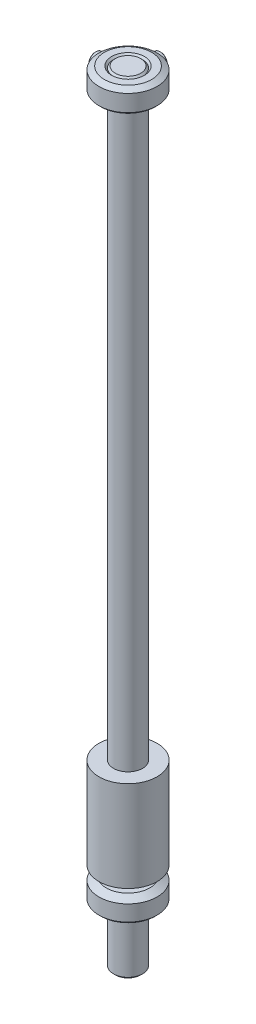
ISO-10303-21;
HEADER;
FILE_DESCRIPTION(('STEP AP214'),'2;1');
FILE_NAME('part.step','',(''),(''),'','','');
FILE_SCHEMA(('AUTOMOTIVE_DESIGN { 1 0 10303 214 1 1 1 1 }'));
ENDSEC;
DATA;
#1=APPLICATION_CONTEXT('core data for automotive mechanical design processes');
#2=APPLICATION_PROTOCOL_DEFINITION('international standard','automotive_design',2000,#1);
#3=PRODUCT_CONTEXT('',#1,'mechanical');
#4=PRODUCT('Part','Part','',(#3));
#5=PRODUCT_RELATED_PRODUCT_CATEGORY('part','',(#4));
#6=PRODUCT_DEFINITION_FORMATION('','',#4);
#7=PRODUCT_DEFINITION_CONTEXT('part definition',#1,'design');
#8=PRODUCT_DEFINITION('design','',#6,#7);
#9=PRODUCT_DEFINITION_SHAPE('','',#8);
#10=(LENGTH_UNIT() NAMED_UNIT(*) SI_UNIT(.MILLI.,.METRE.));
#11=(NAMED_UNIT(*) PLANE_ANGLE_UNIT() SI_UNIT($,.RADIAN.));
#12=(NAMED_UNIT(*) SI_UNIT($,.STERADIAN.) SOLID_ANGLE_UNIT());
#13=UNCERTAINTY_MEASURE_WITH_UNIT(LENGTH_MEASURE(1.E-05),#10,'distance_accuracy_value','');
#14=(GEOMETRIC_REPRESENTATION_CONTEXT(3) GLOBAL_UNCERTAINTY_ASSIGNED_CONTEXT((#13)) GLOBAL_UNIT_ASSIGNED_CONTEXT((#10,
#11,#12)) REPRESENTATION_CONTEXT('',''));
#15=CARTESIAN_POINT('',(0.,0.,0.));
#16=DIRECTION('',(0.,0.,1.));
#17=DIRECTION('',(1.,0.,0.));
#18=AXIS2_PLACEMENT_3D('',#15,#16,#17);
#19=CARTESIAN_POINT('',(0.,0.,0.));
#20=DIRECTION('',(0.,-1.,0.));
#21=DIRECTION('',(0.,0.,-1.));
#22=AXIS2_PLACEMENT_3D('',#19,#20,#21);
#23=CYLINDRICAL_SURFACE('',#22,8.);
#24=CARTESIAN_POINT('',(0.,209.5,0.));
#25=DIRECTION('',(0.,-1.,0.));
#26=DIRECTION('',(0.,0.,-1.));
#27=AXIS2_PLACEMENT_3D('',#24,#25,#26);
#28=CIRCLE('',#27,8.);
#29=CARTESIAN_POINT('',(0.,209.5,-8.));
#30=VERTEX_POINT('',#29);
#31=EDGE_CURVE('E41',#30,#30,#28,.T.);
#32=ORIENTED_EDGE('',*,*,#31,.F.);
#33=EDGE_LOOP('',(#32));
#34=FACE_BOUND('',#33,.T.);
#35=CARTESIAN_POINT('',(-7.74596669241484,212.,-2.));
#36=CARTESIAN_POINT('',(-7.74596612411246,211.970582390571,-2.0000006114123));
#37=CARTESIAN_POINT('',(-7.74618005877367,211.941165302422,-1.99935098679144));
#38=CARTESIAN_POINT('',(-7.74701475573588,211.881440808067,-1.99671361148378));
#39=CARTESIAN_POINT('',(-7.74764848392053,211.851135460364,-1.99468315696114));
#40=CARTESIAN_POINT('',(-7.74932234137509,211.789704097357,-1.98915980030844));
#41=CARTESIAN_POINT('',(-7.75037467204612,211.758582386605,-1.98562274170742));
#42=CARTESIAN_POINT('',(-7.75288669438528,211.695599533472,-1.97696272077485));
#43=CARTESIAN_POINT('',(-7.75435792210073,211.66374509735,-1.97179431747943));
#44=CARTESIAN_POINT('',(-7.7577085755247,211.599390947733,-1.95974894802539));
#45=CARTESIAN_POINT('',(-7.75959891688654,211.566900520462,-1.95282540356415));
#46=CARTESIAN_POINT('',(-7.76378731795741,211.501381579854,-1.93714923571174));
#47=CARTESIAN_POINT('',(-7.76609567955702,211.468365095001,-1.92834906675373));
#48=CARTESIAN_POINT('',(-7.77112499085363,211.401916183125,-1.90880307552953));
#49=CARTESIAN_POINT('',(-7.7738558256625,211.368498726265,-1.89800894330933));
#50=CARTESIAN_POINT('',(-7.77971379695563,211.301380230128,-1.87436152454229));
#51=CARTESIAN_POINT('',(-7.78284984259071,211.267697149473,-1.86145932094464));
#52=CARTESIAN_POINT('',(-7.78827561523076,211.213323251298,-1.8389292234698));
#53=CARTESIAN_POINT('',(-7.79045393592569,211.192397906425,-1.82983580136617));
#54=CARTESIAN_POINT('',(-7.79522425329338,211.148291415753,-1.80976529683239));
#55=CARTESIAN_POINT('',(-7.79783395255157,211.12515458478,-1.79869475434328));
#56=CARTESIAN_POINT('',(-7.8034604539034,211.076791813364,-1.77440072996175));
#57=CARTESIAN_POINT('',(-7.8064902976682,211.0516189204,-1.76107465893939));
#58=CARTESIAN_POINT('',(-7.81296319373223,210.999389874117,-1.73198150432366));
#59=CARTESIAN_POINT('',(-7.81641728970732,210.972396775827,-1.71610355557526));
#60=CARTESIAN_POINT('',(-7.82373960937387,210.916778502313,-1.68160553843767));
#61=CARTESIAN_POINT('',(-7.82761695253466,210.888227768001,-1.66286739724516));
#62=CARTESIAN_POINT('',(-7.83578800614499,210.829793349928,-1.62233890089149));
#63=CARTESIAN_POINT('',(-7.84008950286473,210.799996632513,-1.60042431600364));
#64=CARTESIAN_POINT('',(-7.84672883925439,210.755414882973,-1.56569162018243));
#65=CARTESIAN_POINT('',(-7.84903706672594,210.740171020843,-1.55345198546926));
#66=CARTESIAN_POINT('',(-7.85375924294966,210.70950264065,-1.52807946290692));
#67=CARTESIAN_POINT('',(-7.85617398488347,210.694091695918,-1.514930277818));
#68=CARTESIAN_POINT('',(-7.86110743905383,210.663144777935,-1.48770214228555));
#69=CARTESIAN_POINT('',(-7.8636268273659,210.64762337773,-1.47360675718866));
#70=CARTESIAN_POINT('',(-7.86877631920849,210.61651518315,-1.44445127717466));
#71=CARTESIAN_POINT('',(-7.87140728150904,210.60094399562,-1.42937467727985));
#72=CARTESIAN_POINT('',(-7.876590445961,210.570749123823,-1.39917275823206));
#73=CARTESIAN_POINT('',(-7.87914269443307,210.556111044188,-1.38406184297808));
#74=CARTESIAN_POINT('',(-7.88414249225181,210.527746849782,-1.35384166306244));
#75=CARTESIAN_POINT('',(-7.88659089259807,210.514006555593,-1.33874581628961));
#76=CARTESIAN_POINT('',(-7.89367620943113,210.474733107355,-1.29424753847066));
#77=CARTESIAN_POINT('',(-7.89828283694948,210.449813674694,-1.26429399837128));
#78=CARTESIAN_POINT('',(-7.90709434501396,210.403310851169,-1.2049530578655));
#79=CARTESIAN_POINT('',(-7.91130597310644,210.381615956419,-1.17565376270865));
#80=CARTESIAN_POINT('',(-7.91932811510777,210.341292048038,-1.11796224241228));
#81=CARTESIAN_POINT('',(-7.92314626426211,210.322554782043,-1.08964675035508));
#82=CARTESIAN_POINT('',(-7.93038026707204,210.287872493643,-1.03421837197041));
#83=CARTESIAN_POINT('',(-7.93380497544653,210.271823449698,-1.00717167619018));
#84=CARTESIAN_POINT('',(-7.9402498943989,210.242243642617,-0.954531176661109));
#85=CARTESIAN_POINT('',(-7.94328055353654,210.228614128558,-0.928994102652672));
#86=CARTESIAN_POINT('',(-7.94893878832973,210.203605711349,-0.879582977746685));
#87=CARTESIAN_POINT('',(-7.95157850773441,210.192134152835,-0.855757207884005));
#88=CARTESIAN_POINT('',(-7.95644244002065,210.171184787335,-0.809942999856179));
#89=CARTESIAN_POINT('',(-7.95868229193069,210.161621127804,-0.787995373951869));
#90=CARTESIAN_POINT('',(-7.96407538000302,210.138733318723,-0.732781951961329));
#91=CARTESIAN_POINT('',(-7.96713051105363,210.125897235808,-0.699302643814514));
#92=CARTESIAN_POINT('',(-7.97283500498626,210.102343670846,-0.632551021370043));
#93=CARTESIAN_POINT('',(-7.97549280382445,210.091580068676,-0.599295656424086));
#94=CARTESIAN_POINT('',(-7.98038889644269,210.072064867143,-0.533126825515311));
#95=CARTESIAN_POINT('',(-7.98263641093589,210.063267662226,-0.500227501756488));
#96=CARTESIAN_POINT('',(-7.98671490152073,210.047574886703,-0.434895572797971));
#97=CARTESIAN_POINT('',(-7.98855548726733,210.040634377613,-0.402474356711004));
#98=CARTESIAN_POINT('',(-7.99181873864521,210.028540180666,-0.338209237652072));
#99=CARTESIAN_POINT('',(-7.99325154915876,210.023342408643,-0.306374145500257));
#100=CARTESIAN_POINT('',(-7.99569895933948,210.014616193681,-0.243379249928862));
#101=CARTESIAN_POINT('',(-7.99672424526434,210.01104467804,-0.212225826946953));
#102=CARTESIAN_POINT('',(-7.99835593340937,210.005451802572,-0.150679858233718));
#103=CARTESIAN_POINT('',(-7.99897361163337,210.003388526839,-0.120291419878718));
#104=CARTESIAN_POINT('',(-7.99978965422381,210.000692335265,-0.0603492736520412));
#105=CARTESIAN_POINT('',(-7.99999991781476,210.000018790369,-0.0307975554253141));
#106=CARTESIAN_POINT('',(-7.99999988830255,209.999981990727,0.0282977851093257));
#107=CARTESIAN_POINT('',(-7.99978972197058,210.000618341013,0.0578414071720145));
#108=CARTESIAN_POINT('',(-7.99897350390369,210.003239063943,0.117786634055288));
#109=CARTESIAN_POINT('',(-7.99835531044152,210.005264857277,0.148186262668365));
#110=CARTESIAN_POINT('',(-7.99672249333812,210.01078416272,0.209773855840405));
#111=CARTESIAN_POINT('',(-7.9956963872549,210.014320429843,0.240957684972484));
#112=CARTESIAN_POINT('',(-7.99324712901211,210.022980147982,0.30403236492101));
#113=CARTESIAN_POINT('',(-7.99181310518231,210.028147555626,0.335916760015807));
#114=CARTESIAN_POINT('',(-7.98854722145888,210.040187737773,0.40029890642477));
#115=CARTESIAN_POINT('',(-7.98670505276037,210.047105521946,0.432787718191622));
#116=CARTESIAN_POINT('',(-7.98262316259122,210.062762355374,0.498272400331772));
#117=CARTESIAN_POINT('',(-7.98037368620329,210.071547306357,0.531256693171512));
#118=CARTESIAN_POINT('',(-7.97547342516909,210.091050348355,0.597611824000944));
#119=CARTESIAN_POINT('',(-7.97281328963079,210.101815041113,0.630968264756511));
#120=CARTESIAN_POINT('',(-7.96710385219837,210.125385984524,0.697936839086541));
#121=CARTESIAN_POINT('',(-7.96404600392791,210.138239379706,0.731531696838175));
#122=CARTESIAN_POINT('',(-7.95864453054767,210.161186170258,0.786983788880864));
#123=CARTESIAN_POINT('',(-7.95639836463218,210.170789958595,0.809054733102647));
#124=CARTESIAN_POINT('',(-7.95152354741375,210.191818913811,0.855094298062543));
#125=CARTESIAN_POINT('',(-7.94887938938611,210.203329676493,0.879022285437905));
#126=CARTESIAN_POINT('',(-7.94321410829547,210.228414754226,0.928616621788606));
#127=CARTESIAN_POINT('',(-7.94018091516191,210.242081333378,0.954234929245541));
#128=CARTESIAN_POINT('',(-7.93373279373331,210.271732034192,1.007016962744));
#129=CARTESIAN_POINT('',(-7.93030746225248,210.287814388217,1.03412427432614));
#130=CARTESIAN_POINT('',(-7.92307410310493,210.322558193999,1.0896535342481));
#131=CARTESIAN_POINT('',(-7.91925724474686,210.341323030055,1.11800969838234));
#132=CARTESIAN_POINT('',(-7.91123959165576,210.381694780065,1.17576316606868));
#133=CARTESIAN_POINT('',(-7.90703117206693,210.403409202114,1.20508425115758));
#134=CARTESIAN_POINT('',(-7.89822799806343,210.4499413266,1.26445078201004));
#135=CARTESIAN_POINT('',(-7.89362649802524,210.474869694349,1.29440876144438));
#136=CARTESIAN_POINT('',(-7.88654928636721,210.514152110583,1.3389073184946));
#137=CARTESIAN_POINT('',(-7.88410417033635,210.527892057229,1.35399950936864));
#138=CARTESIAN_POINT('',(-7.87911142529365,210.55625200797,1.3842087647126));
#139=CARTESIAN_POINT('',(-7.87656294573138,210.570886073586,1.39931251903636));
#140=CARTESIAN_POINT('',(-7.87138210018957,210.601102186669,1.42953001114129));
#141=CARTESIAN_POINT('',(-7.86874967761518,210.616699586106,1.4446283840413));
#142=CARTESIAN_POINT('',(-7.86359761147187,210.647857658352,1.47382213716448));
#143=CARTESIAN_POINT('',(-7.8610771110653,210.663402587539,1.48793417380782));
#144=CARTESIAN_POINT('',(-7.85614176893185,210.694393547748,1.51519074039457));
#145=CARTESIAN_POINT('',(-7.85372625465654,210.709824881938,1.52835185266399));
#146=CARTESIAN_POINT('',(-7.84900287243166,210.740530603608,1.55374375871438));
#147=CARTESIAN_POINT('',(-7.84669421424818,210.755791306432,1.5659909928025));
#148=CARTESIAN_POINT('',(-7.84005494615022,210.800411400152,1.60073568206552));
#149=CARTESIAN_POINT('',(-7.83575361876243,210.830229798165,1.62265407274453));
#150=CARTESIAN_POINT('',(-7.82758424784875,210.888690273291,1.66317649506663));
#151=CARTESIAN_POINT('',(-7.82370843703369,210.91724475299,1.68190575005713));
#152=CARTESIAN_POINT('',(-7.81639052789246,210.97285137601,1.71637526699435));
#153=CARTESIAN_POINT('',(-7.81293932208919,210.999828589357,1.73223446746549));
#154=CARTESIAN_POINT('',(-7.80647357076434,211.052005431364,1.76128202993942));
#155=CARTESIAN_POINT('',(-7.80344797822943,211.077141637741,1.7745819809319));
#156=CARTESIAN_POINT('',(-7.79783133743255,211.125409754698,1.79881790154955));
#157=CARTESIAN_POINT('',(-7.79522722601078,211.148488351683,1.80985703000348));
#158=CARTESIAN_POINT('',(-7.7904695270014,211.192456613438,1.82986062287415));
#159=CARTESIAN_POINT('',(-7.78829815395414,211.213301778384,1.83891895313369));
#160=CARTESIAN_POINT('',(-7.78288157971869,211.267543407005,1.86139778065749));
#161=CARTESIAN_POINT('',(-7.77974808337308,211.301174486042,1.87428378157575));
#162=CARTESIAN_POINT('',(-7.77389402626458,211.368193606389,1.89790651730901));
#163=CARTESIAN_POINT('',(-7.77116462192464,211.40156383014,1.90869176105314));
#164=CARTESIAN_POINT('',(-7.76613707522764,211.46792368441,1.92822659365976));
#165=CARTESIAN_POINT('',(-7.76382912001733,211.500898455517,1.93702409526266));
#166=CARTESIAN_POINT('',(-7.75964039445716,211.56633999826,1.95270042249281));
#167=CARTESIAN_POINT('',(-7.75774940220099,211.598794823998,1.95962640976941));
#168=CARTESIAN_POINT('',(-7.75439634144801,211.663084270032,1.97168106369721));
#169=CARTESIAN_POINT('',(-7.7529234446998,211.694909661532,1.97685593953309));
#170=CARTESIAN_POINT('',(-7.7504068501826,211.757841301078,1.98553215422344));
#171=CARTESIAN_POINT('',(-7.74935171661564,211.788940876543,1.98907858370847));
#172=CARTESIAN_POINT('',(-7.74767143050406,211.850334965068,1.99462308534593));
#173=CARTESIAN_POINT('',(-7.74703417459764,211.880625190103,1.99666497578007));
#174=CARTESIAN_POINT('',(-7.74619008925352,211.940326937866,1.99932585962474));
#175=CARTESIAN_POINT('',(-7.74597045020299,211.96973638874,1.99998726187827));
#176=CARTESIAN_POINT('',(-7.74596303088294,212.028538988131,2.00001236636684));
#177=CARTESIAN_POINT('',(-7.74617500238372,212.057932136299,1.99937681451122));
#178=CARTESIAN_POINT('',(-7.74700434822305,212.117608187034,1.99676964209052));
#179=CARTESIAN_POINT('',(-7.7476346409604,212.147889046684,1.99475538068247));
#180=CARTESIAN_POINT('',(-7.74930119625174,212.209271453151,1.9892673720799));
#181=CARTESIAN_POINT('',(-7.75034964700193,212.240368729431,1.98574955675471));
#182=CARTESIAN_POINT('',(-7.7528531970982,212.303302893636,1.97713097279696));
#183=CARTESIAN_POINT('',(-7.75431981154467,212.335133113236,1.97198484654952));
#184=CARTESIAN_POINT('',(-7.7576606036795,212.399439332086,1.95998721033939));
#185=CARTESIAN_POINT('',(-7.75954567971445,212.431906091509,1.95308920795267));
#186=CARTESIAN_POINT('',(-7.76372289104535,212.497378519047,1.93746744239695));
#187=CARTESIAN_POINT('',(-7.76602531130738,212.530372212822,1.92869621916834));
#188=CARTESIAN_POINT('',(-7.7710420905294,212.596776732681,1.90921157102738));
#189=CARTESIAN_POINT('',(-7.77376631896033,212.630172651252,1.89844992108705));
#190=CARTESIAN_POINT('',(-7.77961040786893,212.69724965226,1.87487102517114));
#191=CARTESIAN_POINT('',(-7.78273916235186,212.730912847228,1.86200494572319));
#192=CARTESIAN_POINT('',(-7.78815443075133,212.785273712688,1.83952878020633));
#193=CARTESIAN_POINT('',(-7.79032977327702,212.806204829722,1.83045183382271));
#194=CARTESIAN_POINT('',(-7.79509363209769,212.850321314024,1.81041745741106));
#195=CARTESIAN_POINT('',(-7.79769985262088,212.873462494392,1.79936665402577));
#196=CARTESIAN_POINT('',(-7.8033188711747,212.921832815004,1.77511552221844));
#197=CARTESIAN_POINT('',(-7.80634471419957,212.947009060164,1.76181270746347));
#198=CARTESIAN_POINT('',(-7.81280908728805,212.999244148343,1.73276974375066));
#199=CARTESIAN_POINT('',(-7.81625866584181,213.02624011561,1.71691884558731));
#200=CARTESIAN_POINT('',(-7.82357142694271,213.081864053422,1.68247887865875));
#201=CARTESIAN_POINT('',(-7.82744373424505,213.110417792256,1.66377186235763));
#202=CARTESIAN_POINT('',(-7.83560419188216,213.168858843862,1.62330982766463));
#203=CARTESIAN_POINT('',(-7.83990013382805,213.198659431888,1.60143071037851));
#204=CARTESIAN_POINT('',(-7.84653099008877,213.243248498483,1.56675305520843));
#205=CARTESIAN_POINT('',(-7.84883624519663,213.258494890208,1.55453283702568));
#206=CARTESIAN_POINT('',(-7.85355234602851,213.289168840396,1.52920029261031));
#207=CARTESIAN_POINT('',(-7.85596398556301,213.304582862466,1.5160716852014));
#208=CARTESIAN_POINT('',(-7.8608911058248,213.335536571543,1.48888586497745));
#209=CARTESIAN_POINT('',(-7.86340726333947,213.351061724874,1.47481223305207));
#210=CARTESIAN_POINT('',(-7.86855015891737,213.382178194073,1.44570142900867));
#211=CARTESIAN_POINT('',(-7.87117775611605,213.397753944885,1.43064776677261));
#212=CARTESIAN_POINT('',(-7.87635832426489,213.427982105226,1.4004679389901));
#213=CARTESIAN_POINT('',(-7.8789113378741,213.442648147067,1.38535543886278));
#214=CARTESIAN_POINT('',(-7.88391275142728,213.47106736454,1.3551303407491));
#215=CARTESIAN_POINT('',(-7.88636200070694,213.48483472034,1.34003118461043));
#216=CARTESIAN_POINT('',(-7.89345008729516,213.52418740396,1.29551988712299));
#217=CARTESIAN_POINT('',(-7.89805867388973,213.549158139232,1.26555491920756));
#218=CARTESIAN_POINT('',(-7.90687446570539,213.59575946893,1.20618525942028));
#219=CARTESIAN_POINT('',(-7.91108840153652,213.617501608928,1.17686884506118));
#220=CARTESIAN_POINT('',(-7.91911553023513,213.657915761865,1.11913798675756));
#221=CARTESIAN_POINT('',(-7.92293633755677,213.676696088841,1.09080043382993));
#222=CARTESIAN_POINT('',(-7.93017603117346,213.711460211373,1.03532355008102));
#223=CARTESIAN_POINT('',(-7.93360374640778,213.727548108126,1.00825055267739));
#224=CARTESIAN_POINT('',(-7.9400550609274,213.757201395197,0.95555371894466));
#225=CARTESIAN_POINT('',(-7.94308907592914,213.770865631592,0.929986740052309));
#226=CARTESIAN_POINT('',(-7.9487544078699,213.795939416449,0.880512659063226));
#227=CARTESIAN_POINT('',(-7.95139782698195,213.807441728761,0.856653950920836));
#228=CARTESIAN_POINT('',(-7.9562695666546,213.828448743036,0.81077124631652));
#229=CARTESIAN_POINT('',(-7.95851346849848,213.838039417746,0.788788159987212));
#230=CARTESIAN_POINT('',(-7.96391809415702,213.86099516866,0.733474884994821));
#231=CARTESIAN_POINT('',(-7.96698086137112,213.873869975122,0.699930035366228));
#232=CARTESIAN_POINT('',(-7.97270035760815,213.897490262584,0.633052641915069));
#233=CARTESIAN_POINT('',(-7.97536557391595,213.908282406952,0.599737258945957));
#234=CARTESIAN_POINT('',(-7.98027623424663,213.927845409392,0.533454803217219));
#235=CARTESIAN_POINT('',(-7.98253095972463,213.936662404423,0.500502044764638));
#236=CARTESIAN_POINT('',(-7.98662359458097,213.952386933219,0.435070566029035));
#237=CARTESIAN_POINT('',(-7.98847118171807,213.959339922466,0.40260336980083));
#238=CARTESIAN_POINT('',(-7.9917481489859,213.971452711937,0.338254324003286));
#239=CARTESIAN_POINT('',(-7.99318775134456,213.976657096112,0.306381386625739));
#240=CARTESIAN_POINT('',(-7.99564845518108,213.985391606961,0.243319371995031));
#241=CARTESIAN_POINT('',(-7.99668033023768,213.988965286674,0.212136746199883));
#242=CARTESIAN_POINT('',(-7.99832487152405,213.994558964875,0.150541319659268));
#243=CARTESIAN_POINT('',(-7.99894891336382,213.996621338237,0.120132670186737));
#244=CARTESIAN_POINT('',(-7.9997774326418,213.999313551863,0.0601592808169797));
#245=CARTESIAN_POINT('',(-7.99999391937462,213.999984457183,0.0305965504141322));
#246=CARTESIAN_POINT('',(-8.00000594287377,214.000014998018,-0.0285087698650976));
#247=CARTESIAN_POINT('',(-7.99980177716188,213.999375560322,-0.058051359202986));
#248=CARTESIAN_POINT('',(-7.99899720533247,213.996748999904,-0.117986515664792));
#249=CARTESIAN_POINT('',(-7.99838474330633,213.994720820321,-0.148377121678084));
#250=CARTESIAN_POINT('',(-7.99676312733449,213.989198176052,-0.20993876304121));
#251=CARTESIAN_POINT('',(-7.99574256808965,213.985661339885,-0.24110569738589));
#252=CARTESIAN_POINT('',(-7.99330413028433,213.977003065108,-0.304138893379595));
#253=CARTESIAN_POINT('',(-7.9918754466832,213.971838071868,-0.335998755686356));
#254=CARTESIAN_POINT('',(-7.98861998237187,213.959806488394,-0.400324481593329));
#255=CARTESIAN_POINT('',(-7.98678295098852,213.952895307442,-0.432781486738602));
#256=CARTESIAN_POINT('',(-7.98271109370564,213.937256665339,-0.49819568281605));
#257=CARTESIAN_POINT('',(-7.9804665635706,213.928483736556,-0.531141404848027));
#258=CARTESIAN_POINT('',(-7.9755759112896,213.909010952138,-0.597413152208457));
#259=CARTESIAN_POINT('',(-7.97292048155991,213.898264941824,-0.630724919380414));
#260=CARTESIAN_POINT('',(-7.96722036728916,213.874738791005,-0.697598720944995));
#261=CARTESIAN_POINT('',(-7.9641671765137,213.861911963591,-0.731143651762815));
#262=CARTESIAN_POINT('',(-7.95877641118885,213.839031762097,-0.786471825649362));
#263=CARTESIAN_POINT('',(-7.9565370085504,213.829468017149,-0.80846872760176));
#264=CARTESIAN_POINT('',(-7.95167410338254,213.808518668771,-0.854377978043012));
#265=CARTESIAN_POINT('',(-7.94903493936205,213.797047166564,-0.878249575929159));
#266=CARTESIAN_POINT('',(-7.94337807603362,213.772038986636,-0.927748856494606));
#267=CARTESIAN_POINT('',(-7.94034821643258,213.758409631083,-0.953328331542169));
#268=CARTESIAN_POINT('',(-7.93390512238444,213.728830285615,-1.00605015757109));
#269=CARTESIAN_POINT('',(-7.93048141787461,213.712781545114,-1.03313586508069));
#270=CARTESIAN_POINT('',(-7.92324966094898,213.678100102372,-1.08863885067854));
#271=CARTESIAN_POINT('',(-7.91943273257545,213.659363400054,-1.11699003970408));
#272=CARTESIAN_POINT('',(-7.91141326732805,213.619041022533,-1.17474963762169));
#273=CARTESIAN_POINT('',(-7.90720307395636,213.597347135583,-1.20408143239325));
#274=CARTESIAN_POINT('',(-7.89839466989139,213.550846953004,-1.26348421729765));
#275=CARTESIAN_POINT('',(-7.89378969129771,213.525929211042,-1.29346724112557));
#276=CARTESIAN_POINT('',(-7.88670675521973,213.486657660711,-1.3380083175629));
#277=CARTESIAN_POINT('',(-7.88425926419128,213.472918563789,-1.3531178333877));
#278=CARTESIAN_POINT('',(-7.87926133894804,213.444557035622,-1.38336467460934));
#279=CARTESIAN_POINT('',(-7.87671005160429,213.429920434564,-1.39848860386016));
#280=CARTESIAN_POINT('',(-7.8715263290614,213.399714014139,-1.42873075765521));
#281=CARTESIAN_POINT('',(-7.86889384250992,213.384129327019,-1.44383411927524));
#282=CARTESIAN_POINT('',(-7.86374139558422,213.352993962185,-1.4730403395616));
#283=CARTESIAN_POINT('',(-7.86122057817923,213.337458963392,-1.48715976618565));
#284=CARTESIAN_POINT('',(-7.85628434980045,213.30648494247,-1.5144333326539));
#285=CARTESIAN_POINT('',(-7.85386826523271,213.291060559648,-1.52760396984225));
#286=CARTESIAN_POINT('',(-7.84914349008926,213.260365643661,-1.55301688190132));
#287=CARTESIAN_POINT('',(-7.84683400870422,213.245108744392,-1.56527551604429));
#288=CARTESIAN_POINT('',(-7.84019133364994,213.20049095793,-1.60005947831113));
#289=CARTESIAN_POINT('',(-7.83588760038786,213.170670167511,-1.62200532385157));
#290=CARTESIAN_POINT('',(-7.82771240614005,213.112191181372,-1.66258782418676));
#291=CARTESIAN_POINT('',(-7.82383317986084,213.083620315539,-1.68134916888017));
#292=CARTESIAN_POINT('',(-7.8165074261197,213.02796660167,-1.71588630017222));
#293=CARTESIAN_POINT('',(-7.81305180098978,213.000958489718,-1.73178058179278));
#294=CARTESIAN_POINT('',(-7.80657617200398,212.948705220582,-1.76090027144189));
#295=CARTESIAN_POINT('',(-7.80354514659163,212.92352335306,-1.77423692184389));
#296=CARTESIAN_POINT('',(-7.7979166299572,212.875149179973,-1.79854704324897));
#297=CARTESIAN_POINT('',(-7.79530611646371,212.852010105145,-1.80962342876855));
#298=CARTESIAN_POINT('',(-7.79053444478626,212.807906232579,-1.82970149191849));
#299=CARTESIAN_POINT('',(-7.78835560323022,212.786985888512,-1.83879689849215));
#300=CARTESIAN_POINT('',(-7.78292584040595,212.732602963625,-1.86134157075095));
#301=CARTESIAN_POINT('',(-7.77978630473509,212.698905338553,-1.87425540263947));
#302=CARTESIAN_POINT('',(-7.77392146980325,212.63175776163,-1.89792389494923));
#303=CARTESIAN_POINT('',(-7.77118725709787,212.598325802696,-1.90872754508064));
#304=CARTESIAN_POINT('',(-7.76615120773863,212.53184812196,-1.92829054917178));
#305=CARTESIAN_POINT('',(-7.76383948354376,212.498817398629,-1.93709828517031));
#306=CARTESIAN_POINT('',(-7.75964440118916,212.43327041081,-1.95278773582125));
#307=CARTESIAN_POINT('',(-7.75775073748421,212.400766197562,-1.95971706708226));
#308=CARTESIAN_POINT('',(-7.75439347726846,212.336385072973,-1.97177233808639));
#309=CARTESIAN_POINT('',(-7.75291896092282,212.304517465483,-1.97694492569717));
#310=CARTESIAN_POINT('',(-7.75040040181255,212.24150900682,-1.98561182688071));
#311=CARTESIAN_POINT('',(-7.74934481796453,212.210374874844,-1.9891516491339));
#312=CARTESIAN_POINT('',(-7.74766449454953,212.148919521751,-1.99467922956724));
#313=CARTESIAN_POINT('',(-7.74702754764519,212.118602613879,-1.99671120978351));
#314=CARTESIAN_POINT('',(-7.74618645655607,212.058855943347,-1.99935051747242));
#315=CARTESIAN_POINT('',(-7.74596933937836,212.029428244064,-2.00000061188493));
#316=CARTESIAN_POINT('',(-7.74596669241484,212.,-2.));
#317=B_SPLINE_CURVE_WITH_KNOTS('',3,(#35,#36,#37,#38,#39,#40,#41,#42,#43,#44,#45,#46,#47,#48,
#49,#50,#51,#52,#53,#54,#55,#56,#57,#58,#59,#60,#61,#62,#63,#64,#65,#66,#67,#68,#69,#70,#71,#72,
#73,#74,#75,#76,#77,#78,#79,#80,#81,#82,#83,#84,#85,#86,#87,#88,#89,#90,#91,#92,#93,#94,#95,#96,
#97,#98,#99,#100,#101,#102,#103,#104,#105,#106,#107,#108,#109,#110,#111,#112,#113,#114,#115,
#116,#117,#118,#119,#120,#121,#122,#123,#124,#125,#126,#127,#128,#129,#130,#131,#132,#133,#134,
#135,#136,#137,#138,#139,#140,#141,#142,#143,#144,#145,#146,#147,#148,#149,#150,#151,#152,#153,
#154,#155,#156,#157,#158,#159,#160,#161,#162,#163,#164,#165,#166,#167,#168,#169,#170,#171,#172,
#173,#174,#175,#176,#177,#178,#179,#180,#181,#182,#183,#184,#185,#186,#187,#188,#189,#190,#191,
#192,#193,#194,#195,#196,#197,#198,#199,#200,#201,#202,#203,#204,#205,#206,#207,#208,#209,#210,
#211,#212,#213,#214,#215,#216,#217,#218,#219,#220,#221,#222,#223,#224,#225,#226,#227,#228,#229,
#230,#231,#232,#233,#234,#235,#236,#237,#238,#239,#240,#241,#242,#243,#244,#245,#246,#247,#248,
#249,#250,#251,#252,#253,#254,#255,#256,#257,#258,#259,#260,#261,#262,#263,#264,#265,#266,#267,
#268,#269,#270,#271,#272,#273,#274,#275,#276,#277,#278,#279,#280,#281,#282,#283,#284,#285,#286,
#287,#288,#289,#290,#291,#292,#293,#294,#295,#296,#297,#298,#299,#300,#301,#302,#303,#304,#305,
#306,#307,#308,#309,#310,#311,#312,#313,#314,#315,#316),.UNSPECIFIED.,.F.,.F.,(4,2,2,2,2,2,2,2,
2,2,2,2,2,2,2,2,2,2,2,2,2,2,2,2,2,2,2,2,2,2,2,2,2,2,2,2,2,2,2,2,2,2,2,2,2,2,2,2,2,2,2,2,2,2,2,2,
2,2,2,2,2,2,2,2,2,2,2,2,2,2,2,2,2,2,2,2,2,2,2,2,2,2,2,2,2,2,2,2,2,2,2,2,2,2,2,2,2,2,2,2,2,2,2,2,
2,2,2,2,2,2,2,2,2,2,2,2,2,2,2,2,2,2,2,2,2,2,2,2,2,2,2,2,2,2,2,2,2,2,2,2,4),(0.,
0.0882442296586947,0.179349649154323,0.273331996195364,0.370205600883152,0.469983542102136,
0.572677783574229,0.678299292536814,0.786858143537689,0.855604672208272,0.932929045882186,
1.0188331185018,1.11331810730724,1.21638479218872,1.32803363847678,1.3870827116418,
1.44827809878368,1.51161985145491,1.57710801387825,1.64067503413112,1.70234436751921,
1.81997785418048,1.93002372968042,2.03248251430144,2.12735497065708,2.21464217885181,
2.29434564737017,2.36646748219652,2.47436749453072,2.57948335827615,2.68182485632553,
2.7814025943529,2.87822809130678,2.97231388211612,3.06367363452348,3.15232228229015,
3.24094420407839,3.332329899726,3.42649429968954,3.52345104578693,3.62321262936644,
3.72579051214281,3.83119523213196,3.93943649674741,4.01194543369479,4.09197566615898,
4.17952931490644,4.27460790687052,4.37721254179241,4.48734400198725,4.60500282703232,
4.66666224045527,4.73020428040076,4.7957941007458,4.85922143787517,4.92048633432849,
4.97958883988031,5.09129629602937,5.19435727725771,5.28877222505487,5.37454189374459,
5.451667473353,5.52015078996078,5.62854676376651,5.73402553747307,5.83659716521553,
5.93627258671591,6.03306372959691,6.12698362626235,6.21804654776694,6.3062681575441,
6.39443904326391,6.48546798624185,6.57937069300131,6.67616146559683,6.77585335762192,
6.87845830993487,6.98398726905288,7.09245029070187,7.16119218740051,7.23850181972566,
7.32438104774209,7.41883109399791,7.52185274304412,7.63344646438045,7.69246418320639,
7.75362569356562,7.81693104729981,7.88238028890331,7.94600890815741,8.00774009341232,
8.12549800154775,8.23566931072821,8.33825453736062,8.43325443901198,8.52067008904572,
8.60050298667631,8.67275522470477,8.7808812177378,8.88619561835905,8.98870815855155,
9.08842939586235,9.18537080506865,9.27954488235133,9.37096526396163,9.45964686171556,
9.5482657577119,9.63962459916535,9.73373836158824,9.83062073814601,9.93028427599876,
10.0327404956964,10.1379999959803,10.2460725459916,10.3183292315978,10.3981556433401,
10.4855539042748,10.5805255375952,10.6830716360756,10.7931929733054,10.9108900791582,
10.9725867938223,11.0361782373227,11.1017512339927,11.1651715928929,11.2264393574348,
11.2855545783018,11.3973169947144,11.5004723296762,11.5950210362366,11.6809638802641,
11.7583020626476,11.8270374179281,11.9356501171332,12.0413223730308,12.1440642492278,
12.2438867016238,12.340801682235,12.4348222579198,12.5259627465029,12.6142388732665),.UNSPECIFIED.);
#318=CARTESIAN_POINT('',(-7.74596669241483,212.,-2.));
#319=VERTEX_POINT('',#318);
#320=EDGE_CURVE('E265',#319,#319,#317,.T.);
#321=ORIENTED_EDGE('',*,*,#320,.F.);
#322=EDGE_LOOP('',(#321));
#323=FACE_BOUND('',#322,.T.);
#324=CARTESIAN_POINT('',(0.,214.1,0.));
#325=DIRECTION('',(0.,-1.,0.));
#326=DIRECTION('',(0.,0.,-1.));
#327=AXIS2_PLACEMENT_3D('',#324,#325,#326);
#328=CIRCLE('',#327,8.);
#329=CARTESIAN_POINT('',(0.,214.1,-8.));
#330=VERTEX_POINT('',#329);
#331=EDGE_CURVE('E11',#330,#330,#328,.T.);
#332=ORIENTED_EDGE('',*,*,#331,.T.);
#333=EDGE_LOOP('',(#332));
#334=FACE_BOUND('',#333,.T.);
#335=CARTESIAN_POINT('',(0.,214.,-8.));
#336=CARTESIAN_POINT('',(0.0277931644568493,214.000000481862,-8.0000007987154));
#337=CARTESIAN_POINT('',(0.0555859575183,213.999420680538,-7.99981665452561));
#338=CARTESIAN_POINT('',(0.111928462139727,213.997070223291,-7.99909608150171));
#339=CARTESIAN_POINT('',(0.140476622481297,213.995265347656,-7.99854954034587));
#340=CARTESIAN_POINT('',(0.198272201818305,213.990365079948,-7.99710448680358));
#341=CARTESIAN_POINT('',(0.227516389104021,213.987234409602,-7.99619639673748));
#342=CARTESIAN_POINT('',(0.286637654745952,213.979583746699,-7.99402752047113));
#343=CARTESIAN_POINT('',(0.316509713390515,213.975027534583,-7.99275762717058));
#344=CARTESIAN_POINT('',(0.376810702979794,213.964427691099,-7.98986474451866));
#345=CARTESIAN_POINT('',(0.407232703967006,213.95834700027,-7.98823309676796));
#346=CARTESIAN_POINT('',(0.468547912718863,213.944601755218,-7.98461627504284));
#347=CARTESIAN_POINT('',(0.499432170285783,213.936899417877,-7.98262286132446));
#348=CARTESIAN_POINT('',(0.561574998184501,213.919817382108,-7.97828203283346));
#349=CARTESIAN_POINT('',(0.592822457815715,213.91039931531,-7.97592676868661));
#350=CARTESIAN_POINT('',(0.655587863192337,213.889794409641,-7.97086215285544));
#351=CARTESIAN_POINT('',(0.687092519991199,213.878568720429,-7.96814532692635));
#352=CARTESIAN_POINT('',(0.726199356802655,213.863519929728,-7.96456029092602));
#353=CARTESIAN_POINT('',(0.73409776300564,213.860422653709,-7.96382517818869));
#354=CARTESIAN_POINT('',(0.749901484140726,213.854109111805,-7.96233338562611));
#355=CARTESIAN_POINT('',(0.757806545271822,213.85089223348,-7.96157660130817));
#356=CARTESIAN_POINT('',(0.7811114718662,213.841234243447,-7.95930743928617));
#357=CARTESIAN_POINT('',(0.796449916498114,213.834651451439,-7.95776452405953));
#358=CARTESIAN_POINT('',(0.828091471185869,213.820600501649,-7.95448677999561));
#359=CARTESIAN_POINT('',(0.844380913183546,213.813102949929,-7.95274622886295));
#360=CARTESIAN_POINT('',(0.883893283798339,213.794268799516,-7.94841491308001));
#361=CARTESIAN_POINT('',(0.907001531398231,213.782698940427,-7.94578811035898));
#362=CARTESIAN_POINT('',(0.954706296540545,213.757646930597,-7.94019624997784));
#363=CARTESIAN_POINT('',(0.979260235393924,213.744085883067,-7.93722151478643));
#364=CARTESIAN_POINT('',(1.02968545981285,213.714836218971,-7.93093241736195));
#365=CARTESIAN_POINT('',(1.05550734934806,213.699064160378,-7.92760980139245));
#366=CARTESIAN_POINT('',(1.10826621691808,213.665172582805,-7.92062357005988));
#367=CARTESIAN_POINT('',(1.13514619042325,213.646965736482,-7.91695281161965));
#368=CARTESIAN_POINT('',(1.1897846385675,213.607984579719,-7.90926961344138));
#369=CARTESIAN_POINT('',(1.21747771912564,213.58711984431,-7.90525096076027));
#370=CARTESIAN_POINT('',(1.27347122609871,213.542605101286,-7.89686990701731));
#371=CARTESIAN_POINT('',(1.30169727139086,213.518862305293,-7.89250195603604));
#372=CARTESIAN_POINT('',(1.34363281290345,213.481560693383,-7.88579458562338));
#373=CARTESIAN_POINT('',(1.35783937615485,213.468551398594,-7.88348226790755));
#374=CARTESIAN_POINT('',(1.38627220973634,213.441749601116,-7.87876650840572));
#375=CARTESIAN_POINT('',(1.40048729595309,213.42794533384,-7.87636235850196));
#376=CARTESIAN_POINT('',(1.42893275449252,213.39948858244,-7.87147846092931));
#377=CARTESIAN_POINT('',(1.44315008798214,213.38482306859,-7.86899866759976));
#378=CARTESIAN_POINT('',(1.47069731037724,213.355522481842,-7.86413884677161));
#379=CARTESIAN_POINT('',(1.48404104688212,213.340900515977,-7.86175810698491));
#380=CARTESIAN_POINT('',(1.52215648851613,213.297867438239,-7.85487031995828));
#381=CARTESIAN_POINT('',(1.54635441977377,213.268940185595,-7.85038665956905));
#382=CARTESIAN_POINT('',(1.5915134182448,213.211743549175,-7.84180243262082));
#383=CARTESIAN_POINT('',(1.61258273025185,213.183560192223,-7.8376963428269));
#384=CARTESIAN_POINT('',(1.65175079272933,213.128177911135,-7.82986652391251));
#385=CARTESIAN_POINT('',(1.66995420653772,213.101053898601,-7.82613652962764));
#386=CARTESIAN_POINT('',(1.70365827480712,213.048072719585,-7.81906023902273));
#387=CARTESIAN_POINT('',(1.71925906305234,213.022280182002,-7.81570660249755));
#388=CARTESIAN_POINT('',(1.74802392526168,212.972200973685,-7.8093839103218));
#389=CARTESIAN_POINT('',(1.76128261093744,212.947969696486,-7.80640620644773));
#390=CARTESIAN_POINT('',(1.7856216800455,212.901212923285,-7.80083752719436));
#391=CARTESIAN_POINT('',(1.79679033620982,212.878734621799,-7.7982361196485));
#392=CARTESIAN_POINT('',(1.81488137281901,212.840535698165,-7.79396594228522));
#393=CARTESIAN_POINT('',(1.82202979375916,212.82492563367,-7.7922623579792));
#394=CARTESIAN_POINT('',(1.83534898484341,212.794822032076,-7.78907744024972));
#395=CARTESIAN_POINT('',(1.84155166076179,212.780343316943,-7.78758939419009));
#396=CARTESIAN_POINT('',(1.8557268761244,212.746143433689,-7.78417811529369));
#397=CARTESIAN_POINT('',(1.86355910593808,212.7263609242,-7.78228483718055));
#398=CARTESIAN_POINT('',(1.87847335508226,212.686859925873,-7.77863930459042));
#399=CARTESIAN_POINT('',(1.88556522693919,212.667145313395,-7.77688530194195));
#400=CARTESIAN_POINT('',(1.89902097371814,212.627809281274,-7.77352538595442));
#401=CARTESIAN_POINT('',(1.90539464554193,212.608191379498,-7.77191755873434));
#402=CARTESIAN_POINT('',(1.91743636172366,212.569078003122,-7.76884827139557));
#403=CARTESIAN_POINT('',(1.92311414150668,212.549585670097,-7.76738486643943));
#404=CARTESIAN_POINT('',(1.93692071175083,212.499348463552,-7.76378873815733));
#405=CARTESIAN_POINT('',(1.9446184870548,212.468477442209,-7.76174583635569));
#406=CARTESIAN_POINT('',(1.95835032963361,212.407213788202,-7.75803912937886));
#407=CARTESIAN_POINT('',(1.96442330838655,212.376830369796,-7.75636666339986));
#408=CARTESIAN_POINT('',(1.97500711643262,212.316630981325,-7.7534012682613));
#409=CARTESIAN_POINT('',(1.97955607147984,212.286822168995,-7.75209922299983));
#410=CARTESIAN_POINT('',(1.98719463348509,212.227852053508,-7.74987508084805));
#411=CARTESIAN_POINT('',(1.99032147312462,212.198695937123,-7.74894338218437));
#412=CARTESIAN_POINT('',(1.99521967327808,212.141101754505,-7.74746067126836));
#413=CARTESIAN_POINT('',(1.99702725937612,212.112667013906,-7.74689952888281));
#414=CARTESIAN_POINT('',(1.99939093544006,212.056573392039,-7.74615763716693));
#415=CARTESIAN_POINT('',(1.99998214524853,212.02891619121,-7.74596622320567));
#416=CARTESIAN_POINT('',(1.99999986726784,212.000841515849,-7.74596680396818));
#417=CARTESIAN_POINT('',(2.00000000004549,212.000420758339,-7.745966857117));
#418=CARTESIAN_POINT('',(1.99999999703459,211.972569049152,-7.74597330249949));
#419=CARTESIAN_POINT('',(1.99943546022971,211.945134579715,-7.74616760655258));
#420=CARTESIAN_POINT('',(1.99714430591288,211.889484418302,-7.74690984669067));
#421=CARTESIAN_POINT('',(1.99538284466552,211.861270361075,-7.74746836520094));
#422=CARTESIAN_POINT('',(1.99057611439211,211.803867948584,-7.74894614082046));
#423=CARTESIAN_POINT('',(1.98748411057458,211.774683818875,-7.74987843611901));
#424=CARTESIAN_POINT('',(1.97991217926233,211.715642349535,-7.75210379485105));
#425=CARTESIAN_POINT('',(1.97539435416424,211.685790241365,-7.75340659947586));
#426=CARTESIAN_POINT('',(1.96486762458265,211.625489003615,-7.75637352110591));
#427=CARTESIAN_POINT('',(1.95881989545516,211.595047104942,-7.75804687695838));
#428=CARTESIAN_POINT('',(1.94513158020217,211.533652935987,-7.76175534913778));
#429=CARTESIAN_POINT('',(1.9374513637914,211.502710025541,-7.76379923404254));
#430=CARTESIAN_POINT('',(1.92039909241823,211.440412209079,-7.76824934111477));
#431=CARTESIAN_POINT('',(1.91098674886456,211.409068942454,-7.77066389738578));
#432=CARTESIAN_POINT('',(1.89037320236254,211.346076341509,-7.77585528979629));
#433=CARTESIAN_POINT('',(1.87913116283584,211.314440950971,-7.77864003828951));
#434=CARTESIAN_POINT('',(1.86397589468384,211.274968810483,-7.78233187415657));
#435=CARTESIAN_POINT('',(1.86079155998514,211.266834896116,-7.78310444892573));
#436=CARTESIAN_POINT('',(1.85429598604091,211.250557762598,-7.78467249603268));
#437=CARTESIAN_POINT('',(1.8509840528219,211.242414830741,-7.78546808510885));
#438=CARTESIAN_POINT('',(1.84160669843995,211.219787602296,-7.78771885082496));
#439=CARTESIAN_POINT('',(1.83542479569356,211.205354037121,-7.78920055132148));
#440=CARTESIAN_POINT('',(1.82216214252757,211.175368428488,-7.79236718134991));
#441=CARTESIAN_POINT('',(1.81505031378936,211.159830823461,-7.79405847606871));
#442=CARTESIAN_POINT('',(1.79697653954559,211.121644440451,-7.79831625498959));
#443=CARTESIAN_POINT('',(1.78578452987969,211.099108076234,-7.80091833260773));
#444=CARTESIAN_POINT('',(1.76140143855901,211.052249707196,-7.80648661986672));
#445=CARTESIAN_POINT('',(1.74812238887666,211.02797471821,-7.8094632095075));
#446=CARTESIAN_POINT('',(1.71932055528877,210.977822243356,-7.8157821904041));
#447=CARTESIAN_POINT('',(1.70370355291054,210.951999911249,-7.81913322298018));
#448=CARTESIAN_POINT('',(1.66997215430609,210.898972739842,-7.82620272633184));
#449=CARTESIAN_POINT('',(1.6517581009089,210.87183222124,-7.8299285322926));
#450=CARTESIAN_POINT('',(1.61257540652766,210.816429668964,-7.83774841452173));
#451=CARTESIAN_POINT('',(1.59150265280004,210.788242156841,-7.84184875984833));
#452=CARTESIAN_POINT('',(1.54634515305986,210.731048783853,-7.85041991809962));
#453=CARTESIAN_POINT('',(1.52215277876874,210.702128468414,-7.85489626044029));
#454=CARTESIAN_POINT('',(1.48393912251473,210.658984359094,-7.86179266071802));
#455=CARTESIAN_POINT('',(1.47048776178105,210.644247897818,-7.86418928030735));
#456=CARTESIAN_POINT('',(1.44271373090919,210.614719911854,-7.8690820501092));
#457=CARTESIAN_POINT('',(1.42837695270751,210.599941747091,-7.8715789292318));
#458=CARTESIAN_POINT('',(1.39990446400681,210.571485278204,-7.87645989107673));
#459=CARTESIAN_POINT('',(1.38578838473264,210.557787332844,-7.87884402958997));
#460=CARTESIAN_POINT('',(1.35755529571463,210.531187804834,-7.88352110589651));
#461=CARTESIAN_POINT('',(1.34344926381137,210.518274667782,-7.88581473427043));
#462=CARTESIAN_POINT('',(1.30158787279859,210.481043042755,-7.89250460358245));
#463=CARTESIAN_POINT('',(1.27333141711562,210.457278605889,-7.89687380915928));
#464=CARTESIAN_POINT('',(1.21728479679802,210.412731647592,-7.9052567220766));
#465=CARTESIAN_POINT('',(1.18956948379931,210.391855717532,-7.90927596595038));
#466=CARTESIAN_POINT('',(1.13489580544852,210.352861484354,-7.91695970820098));
#467=CARTESIAN_POINT('',(1.10800322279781,210.334652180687,-7.92063040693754));
#468=CARTESIAN_POINT('',(1.05522959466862,210.300763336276,-7.92761585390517));
#469=CARTESIAN_POINT('',(1.02940586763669,210.284995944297,-7.93093773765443));
#470=CARTESIAN_POINT('',(0.978988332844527,210.255761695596,-7.93722477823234));
#471=CARTESIAN_POINT('',(0.954444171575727,210.242210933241,-7.9401981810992));
#472=CARTESIAN_POINT('',(0.906771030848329,210.217184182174,-7.94578652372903));
#473=CARTESIAN_POINT('',(0.883684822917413,210.205628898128,-7.94841116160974));
#474=CARTESIAN_POINT('',(0.844176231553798,210.186801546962,-7.95274368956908));
#475=CARTESIAN_POINT('',(0.827867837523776,210.179297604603,-7.95448713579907));
#476=CARTESIAN_POINT('',(0.796201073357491,210.165240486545,-7.95776774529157));
#477=CARTESIAN_POINT('',(0.780856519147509,210.158657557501,-7.95931079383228));
#478=CARTESIAN_POINT('',(0.745873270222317,210.144165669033,-7.96272118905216));
#479=CARTESIAN_POINT('',(0.726183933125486,210.136373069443,-7.96456486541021));
#480=CARTESIAN_POINT('',(0.686859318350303,210.121527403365,-7.96811410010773));
#481=CARTESIAN_POINT('',(0.667227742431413,210.114464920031,-7.96982132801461));
#482=CARTESIAN_POINT('',(0.628047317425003,210.101058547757,-7.97309236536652));
#483=CARTESIAN_POINT('',(0.608501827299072,210.094705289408,-7.97465797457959));
#484=CARTESIAN_POINT('',(0.569522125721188,210.082696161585,-7.97764704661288));
#485=CARTESIAN_POINT('',(0.55009091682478,210.077030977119,-7.97907234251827));
#486=CARTESIAN_POINT('',(0.499937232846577,210.063231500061,-7.98257964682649));
#487=CARTESIAN_POINT('',(0.469088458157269,210.055529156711,-7.98457321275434));
#488=CARTESIAN_POINT('',(0.407839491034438,210.04177971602,-7.98819126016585));
#489=CARTESIAN_POINT('',(0.37744816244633,210.035695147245,-7.9898239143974));
#490=CARTESIAN_POINT('',(0.317202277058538,210.025083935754,-7.99271976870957));
#491=CARTESIAN_POINT('',(0.287354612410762,210.020520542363,-7.99399155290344));
#492=CARTESIAN_POINT('',(0.228275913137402,210.01285295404,-7.99616524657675));
#493=CARTESIAN_POINT('',(0.199049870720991,210.009712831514,-7.9970761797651));
#494=CARTESIAN_POINT('',(0.141284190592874,210.004791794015,-7.99852766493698));
#495=CARTESIAN_POINT('',(0.112747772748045,210.002975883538,-7.9990777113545));
#496=CARTESIAN_POINT('',(0.0564220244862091,210.000602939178,-7.99980712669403));
#497=CARTESIAN_POINT('',(0.0286342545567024,210.000011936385,-7.99999648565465));
#498=CARTESIAN_POINT('',(-0.0269241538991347,209.999988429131,-8.00000342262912));
#499=CARTESIAN_POINT('',(-0.0546947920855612,210.000555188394,-7.9998212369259));
#500=CARTESIAN_POINT('',(-0.110992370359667,210.00287773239,-7.999105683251));
#501=CARTESIAN_POINT('',(-0.139517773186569,210.004667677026,-7.99856223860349));
#502=CARTESIAN_POINT('',(-0.197267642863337,210.009535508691,-7.99712381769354));
#503=CARTESIAN_POINT('',(-0.226488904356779,210.012648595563,-7.99621927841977));
#504=CARTESIAN_POINT('',(-0.285564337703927,210.020261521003,-7.99405812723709));
#505=CARTESIAN_POINT('',(-0.315413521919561,210.024797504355,-7.99279242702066));
#506=CARTESIAN_POINT('',(-0.375668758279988,210.035354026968,-7.98990851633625));
#507=CARTESIAN_POINT('',(-0.406067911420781,210.041411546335,-7.9882816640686));
#508=CARTESIAN_POINT('',(-0.467338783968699,210.055107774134,-7.9846749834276));
#509=CARTESIAN_POINT('',(-0.498201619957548,210.062784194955,-7.98268692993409));
#510=CARTESIAN_POINT('',(-0.548414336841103,210.076551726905,-7.97918615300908));
#511=CARTESIAN_POINT('',(-0.567889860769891,210.082211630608,-7.977761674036));
#512=CARTESIAN_POINT('',(-0.606960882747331,210.094213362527,-7.97477367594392));
#513=CARTESIAN_POINT('',(-0.626553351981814,210.100564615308,-7.97320830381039));
#514=CARTESIAN_POINT('',(-0.665830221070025,210.113970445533,-7.96993717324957));
#515=CARTESIAN_POINT('',(-0.685511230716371,210.121034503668,-7.96822959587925));
#516=CARTESIAN_POINT('',(-0.724936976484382,210.135887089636,-7.96467911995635));
#517=CARTESIAN_POINT('',(-0.744677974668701,210.143685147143,-7.96283453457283));
#518=CARTESIAN_POINT('',(-0.779708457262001,210.158171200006,-7.95942645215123));
#519=CARTESIAN_POINT('',(-0.795049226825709,210.164741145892,-7.95788693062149));
#520=CARTESIAN_POINT('',(-0.826695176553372,210.17876509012,-7.95461494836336));
#521=CARTESIAN_POINT('',(-0.842986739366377,210.186248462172,-7.95287666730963));
#522=CARTESIAN_POINT('',(-0.882503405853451,210.20504728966,-7.94855134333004));
#523=CARTESIAN_POINT('',(-0.905614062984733,210.216595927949,-7.94592840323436));
#524=CARTESIAN_POINT('',(-0.953323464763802,210.241602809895,-7.94034445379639));
#525=CARTESIAN_POINT('',(-0.977879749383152,210.255139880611,-7.93737374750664));
#526=CARTESIAN_POINT('',(-1.02830983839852,210.284338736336,-7.93109311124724));
#527=CARTESIAN_POINT('',(-1.05413437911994,210.300083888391,-7.92777492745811));
#528=CARTESIAN_POINT('',(-1.1068991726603,210.333918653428,-7.92079789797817));
#529=CARTESIAN_POINT('',(-1.13378257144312,210.352095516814,-7.9171319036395));
#530=CARTESIAN_POINT('',(-1.1884289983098,210.391013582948,-7.90945859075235));
#531=CARTESIAN_POINT('',(-1.21612680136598,210.411845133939,-7.90544505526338));
#532=CARTESIAN_POINT('',(-1.27213145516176,210.45629029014,-7.89707458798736));
#533=CARTESIAN_POINT('',(-1.30036411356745,210.479996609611,-7.89271210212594));
#534=CARTESIAN_POINT('',(-1.34231146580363,210.517242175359,-7.8860130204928));
#535=CARTESIAN_POINT('',(-1.35652225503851,210.530232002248,-7.88370356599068));
#536=CARTESIAN_POINT('',(-1.38496423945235,210.556994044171,-7.87899362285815));
#537=CARTESIAN_POINT('',(-1.39918427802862,210.570778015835,-7.87659242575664));
#538=CARTESIAN_POINT('',(-1.42766329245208,210.599216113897,-7.87171060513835));
#539=CARTESIAN_POINT('',(-1.44190856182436,210.613883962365,-7.8692299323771));
#540=CARTESIAN_POINT('',(-1.469510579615,210.64319077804,-7.86436829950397));
#541=CARTESIAN_POINT('',(-1.4828811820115,210.657816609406,-7.86198662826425));
#542=CARTESIAN_POINT('',(-1.52107481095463,210.700863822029,-7.85509590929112));
#543=CARTESIAN_POINT('',(-1.54532321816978,210.729802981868,-7.85061021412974));
#544=CARTESIAN_POINT('',(-1.59057857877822,210.787028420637,-7.84202167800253));
#545=CARTESIAN_POINT('',(-1.61169385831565,210.81522847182,-7.83791332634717));
#546=CARTESIAN_POINT('',(-1.65094926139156,210.87064830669,-7.83007873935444));
#547=CARTESIAN_POINT('',(-1.66919414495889,210.897792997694,-7.82634625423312));
#548=CARTESIAN_POINT('',(-1.70297664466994,210.950818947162,-7.81926473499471));
#549=CARTESIAN_POINT('',(-1.71861450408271,210.976635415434,-7.81590837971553));
#550=CARTESIAN_POINT('',(-1.74744917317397,211.026765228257,-7.80957999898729));
#551=CARTESIAN_POINT('',(-1.76074071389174,211.051023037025,-7.80659934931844));
#552=CARTESIAN_POINT('',(-1.78514139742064,211.097835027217,-7.80102452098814));
#553=CARTESIAN_POINT('',(-1.79633893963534,211.12034188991,-7.79841994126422));
#554=CARTESIAN_POINT('',(-1.81447749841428,211.158592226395,-7.79414398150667));
#555=CARTESIAN_POINT('',(-1.82164515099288,211.174224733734,-7.79243786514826));
#556=CARTESIAN_POINT('',(-1.83500082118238,211.204373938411,-7.78924772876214));
#557=CARTESIAN_POINT('',(-1.841220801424,211.218875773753,-7.78775701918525));
#558=CARTESIAN_POINT('',(-1.85543815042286,211.253137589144,-7.78433858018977));
#559=CARTESIAN_POINT('',(-1.86329451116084,211.272959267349,-7.78244077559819));
#560=CARTESIAN_POINT('',(-1.87825317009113,211.312536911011,-7.77878627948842));
#561=CARTESIAN_POINT('',(-1.88536543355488,211.332288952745,-7.77702783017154));
#562=CARTESIAN_POINT('',(-1.89885840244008,211.37169790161,-7.77365910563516));
#563=CARTESIAN_POINT('',(-1.90524901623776,211.391351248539,-7.77204690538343));
#564=CARTESIAN_POINT('',(-1.91732134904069,211.43053334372,-7.76896895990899));
#565=CARTESIAN_POINT('',(-1.92301291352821,211.450058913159,-7.76750125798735));
#566=CARTESIAN_POINT('',(-1.93685076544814,211.500377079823,-7.76389426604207));
#567=CARTESIAN_POINT('',(-1.94456478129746,211.53129625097,-7.76184462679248));
#568=CARTESIAN_POINT('',(-1.95832256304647,211.592649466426,-7.75812469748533));
#569=CARTESIAN_POINT('',(-1.96440567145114,211.623074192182,-7.75644568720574));
#570=CARTESIAN_POINT('',(-1.97500442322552,211.683348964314,-7.75346744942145));
#571=CARTESIAN_POINT('',(-1.97955860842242,211.713191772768,-7.75215903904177));
#572=CARTESIAN_POINT('',(-1.98720351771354,211.772222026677,-7.74992246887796));
#573=CARTESIAN_POINT('',(-1.99033187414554,211.801404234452,-7.74898463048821));
#574=CARTESIAN_POINT('',(-1.99523016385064,211.859043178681,-7.7474897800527));
#575=CARTESIAN_POINT('',(-1.99703670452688,211.887496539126,-7.74692255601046));
#576=CARTESIAN_POINT('',(-1.99939647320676,211.943617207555,-7.74616926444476));
#577=CARTESIAN_POINT('',(-1.99998518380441,211.971282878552,-7.74597242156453));
#578=CARTESIAN_POINT('',(-2.00001425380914,212.026595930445,-7.74596110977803));
#579=CARTESIAN_POINT('',(-1.99945540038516,212.054243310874,-7.74614637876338));
#580=CARTESIAN_POINT('',(-1.99715774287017,212.110329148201,-7.74687712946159));
#581=CARTESIAN_POINT('',(-1.99538346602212,212.138766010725,-7.74743342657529));
#582=CARTESIAN_POINT('',(-1.99055205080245,212.19637392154,-7.74890662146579));
#583=CARTESIAN_POINT('',(-1.9874583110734,212.22554163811,-7.7498337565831));
#584=CARTESIAN_POINT('',(-1.97988491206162,212.284545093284,-7.7520492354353));
#585=CARTESIAN_POINT('',(-1.97536762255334,212.314375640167,-7.75334728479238));
#586=CARTESIAN_POINT('',(-1.9648448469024,212.374628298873,-7.7563050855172));
#587=CARTESIAN_POINT('',(-1.95880081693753,212.405043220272,-7.75797404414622));
#588=CARTESIAN_POINT('',(-1.94512326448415,212.466379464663,-7.76167416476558));
#589=CARTESIAN_POINT('',(-1.9374503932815,212.497291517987,-7.76371407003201));
#590=CARTESIAN_POINT('',(-1.92368069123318,212.547600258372,-7.76730554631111));
#591=CARTESIAN_POINT('',(-1.91801581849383,212.567122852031,-7.76876732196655));
#592=CARTESIAN_POINT('',(-1.90599758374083,212.606300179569,-7.77183353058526));
#593=CARTESIAN_POINT('',(-1.89963437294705,212.625951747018,-7.77343992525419));
#594=CARTESIAN_POINT('',(-1.88619688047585,212.66535837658,-7.776797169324));
#595=CARTESIAN_POINT('',(-1.87911268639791,212.68510989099,-7.77854994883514));
#596=CARTESIAN_POINT('',(-1.86421078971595,212.724687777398,-7.78219317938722));
#597=CARTESIAN_POINT('',(-1.85638311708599,212.744510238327,-7.7840853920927));
#598=CARTESIAN_POINT('',(-1.84220856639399,212.778792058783,-7.78749616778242));
#599=CARTESIAN_POINT('',(-1.83600222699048,212.793312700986,-7.78898481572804));
#600=CARTESIAN_POINT('',(-1.82267625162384,212.823497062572,-7.79217069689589));
#601=CARTESIAN_POINT('',(-1.81552469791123,212.839145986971,-7.79387464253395));
#602=CARTESIAN_POINT('',(-1.79742790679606,212.877431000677,-7.7981450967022));
#603=CARTESIAN_POINT('',(-1.78625591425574,212.899956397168,-7.80074654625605));
#604=CARTESIAN_POINT('',(-1.76191122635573,212.946801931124,-7.80631480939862));
#605=CARTESIAN_POINT('',(-1.74865029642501,212.971074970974,-7.80929206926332));
#606=CARTESIAN_POINT('',(-1.71988220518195,213.021232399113,-7.81561336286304));
#607=CARTESIAN_POINT('',(-1.70428050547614,213.047061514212,-7.81896606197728));
#608=CARTESIAN_POINT('',(-1.67057618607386,213.100110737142,-7.82603996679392));
#609=CARTESIAN_POINT('',(-1.65237353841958,213.127266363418,-7.82976853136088));
#610=CARTESIAN_POINT('',(-1.61320898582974,213.182707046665,-7.83759497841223));
#611=CARTESIAN_POINT('',(-1.59214255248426,213.210917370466,-7.84169914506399));
#612=CARTESIAN_POINT('',(-1.54699176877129,213.268163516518,-7.8502790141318));
#613=CARTESIAN_POINT('',(-1.52279933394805,213.297113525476,-7.85476025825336));
#614=CARTESIAN_POINT('',(-1.48469257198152,213.340179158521,-7.86164439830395));
#615=CARTESIAN_POINT('',(-1.47135273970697,213.354811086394,-7.86402374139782));
#616=CARTESIAN_POINT('',(-1.44381416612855,213.38413073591,-7.86888064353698));
#617=CARTESIAN_POINT('',(-1.4296016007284,213.398805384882,-7.87135891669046));
#618=CARTESIAN_POINT('',(-1.4011510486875,213.427294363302,-7.87624235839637));
#619=CARTESIAN_POINT('',(-1.38692568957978,213.44112129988,-7.87864756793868));
#620=CARTESIAN_POINT('',(-1.35847202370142,213.467966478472,-7.88336541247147));
#621=CARTESIAN_POINT('',(-1.3442549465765,213.480996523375,-7.88567875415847));
#622=CARTESIAN_POINT('',(-1.30228900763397,213.518355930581,-7.89238897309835));
#623=CARTESIAN_POINT('',(-1.27404182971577,213.542134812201,-7.89675887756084));
#624=CARTESIAN_POINT('',(-1.21800667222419,213.586714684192,-7.90514372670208));
#625=CARTESIAN_POINT('',(-1.1902933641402,213.607608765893,-7.90916420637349));
#626=CARTESIAN_POINT('',(-1.13561612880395,213.64664229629,-7.91685095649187));
#627=CARTESIAN_POINT('',(-1.1087178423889,213.664872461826,-7.92052342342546));
#628=CARTESIAN_POINT('',(-1.05592490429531,213.698805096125,-7.92751294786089));
#629=CARTESIAN_POINT('',(-1.03008746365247,213.714595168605,-7.9308371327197));
#630=CARTESIAN_POINT('',(-0.979634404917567,213.743876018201,-7.93712931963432));
#631=CARTESIAN_POINT('',(-0.955068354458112,213.757450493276,-7.94010555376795));
#632=CARTESIAN_POINT('',(-0.907343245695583,213.782525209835,-7.94570011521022));
#633=CARTESIAN_POINT('',(-0.884226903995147,213.794104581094,-7.94832811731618));
#634=CARTESIAN_POINT('',(-0.844703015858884,213.81295295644,-7.95266212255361));
#635=CARTESIAN_POINT('',(-0.828410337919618,213.820455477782,-7.95440388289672));
#636=CARTESIAN_POINT('',(-0.796765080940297,213.834514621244,-7.95768260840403));
#637=CARTESIAN_POINT('',(-0.78142619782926,213.841100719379,-7.95922538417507));
#638=CARTESIAN_POINT('',(-0.746377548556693,213.855632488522,-7.96264323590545));
#639=CARTESIAN_POINT('',(-0.726616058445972,213.863459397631,-7.96449426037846));
#640=CARTESIAN_POINT('',(-0.687148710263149,213.878367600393,-7.96805731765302));
#641=CARTESIAN_POINT('',(-0.667446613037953,213.885458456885,-7.96977104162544));
#642=CARTESIAN_POINT('',(-0.628127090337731,213.898915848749,-7.97305422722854));
#643=CARTESIAN_POINT('',(-0.608513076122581,213.905291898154,-7.97462551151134));
#644=CARTESIAN_POINT('',(-0.569398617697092,213.917341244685,-7.97762507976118));
#645=CARTESIAN_POINT('',(-0.549901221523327,213.923023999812,-7.97905522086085));
#646=CARTESIAN_POINT('',(-0.499631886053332,213.936848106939,-7.98257030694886));
#647=CARTESIAN_POINT('',(-0.468733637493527,213.944557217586,-7.98456691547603));
#648=CARTESIAN_POINT('',(-0.40739180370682,213.958314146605,-7.9881900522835));
#649=CARTESIAN_POINT('',(-0.376957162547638,213.96439981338,-7.98982482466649));
#650=CARTESIAN_POINT('',(-0.316631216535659,213.97500824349,-7.99272393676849));
#651=CARTESIAN_POINT('',(-0.286746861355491,213.97956812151,-7.99399693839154));
#652=CARTESIAN_POINT('',(-0.227601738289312,213.987224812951,-7.99617199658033));
#653=CARTESIAN_POINT('',(-0.198345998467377,213.990357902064,-7.99708316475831));
#654=CARTESIAN_POINT('',(-0.140528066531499,213.995261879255,-7.99853434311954));
#655=CARTESIAN_POINT('',(-0.111969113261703,213.997068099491,-7.99908393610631));
#656=CARTESIAN_POINT('',(-0.055605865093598,213.999420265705,-7.99981057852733));
#657=CARTESIAN_POINT('',(-0.0278031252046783,214.000000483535,-7.99999774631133));
#658=CARTESIAN_POINT('',(0.,214.,-8.));
#659=B_SPLINE_CURVE_WITH_KNOTS('',3,(#335,#336,#337,#338,#339,#340,#341,#342,#343,#344,#345,
#346,#347,#348,#349,#350,#351,#352,#353,#354,#355,#356,#357,#358,#359,#360,#361,#362,#363,#364,
#365,#366,#367,#368,#369,#370,#371,#372,#373,#374,#375,#376,#377,#378,#379,#380,#381,#382,#383,
#384,#385,#386,#387,#388,#389,#390,#391,#392,#393,#394,#395,#396,#397,#398,#399,#400,#401,#402,
#403,#404,#405,#406,#407,#408,#409,#410,#411,#412,#413,#414,#415,#416,#417,#418,#419,#420,#421,
#422,#423,#424,#425,#426,#427,#428,#429,#430,#431,#432,#433,#434,#435,#436,#437,#438,#439,#440,
#441,#442,#443,#444,#445,#446,#447,#448,#449,#450,#451,#452,#453,#454,#455,#456,#457,#458,#459,
#460,#461,#462,#463,#464,#465,#466,#467,#468,#469,#470,#471,#472,#473,#474,#475,#476,#477,#478,
#479,#480,#481,#482,#483,#484,#485,#486,#487,#488,#489,#490,#491,#492,#493,#494,#495,#496,#497,
#498,#499,#500,#501,#502,#503,#504,#505,#506,#507,#508,#509,#510,#511,#512,#513,#514,#515,#516,
#517,#518,#519,#520,#521,#522,#523,#524,#525,#526,#527,#528,#529,#530,#531,#532,#533,#534,#535,
#536,#537,#538,#539,#540,#541,#542,#543,#544,#545,#546,#547,#548,#549,#550,#551,#552,#553,#554,
#555,#556,#557,#558,#559,#560,#561,#562,#563,#564,#565,#566,#567,#568,#569,#570,#571,#572,#573,
#574,#575,#576,#577,#578,#579,#580,#581,#582,#583,#584,#585,#586,#587,#588,#589,#590,#591,#592,
#593,#594,#595,#596,#597,#598,#599,#600,#601,#602,#603,#604,#605,#606,#607,#608,#609,#610,#611,
#612,#613,#614,#615,#616,#617,#618,#619,#620,#621,#622,#623,#624,#625,#626,#627,#628,#629,#630,
#631,#632,#633,#634,#635,#636,#637,#638,#639,#640,#641,#642,#643,#644,#645,#646,#647,#648,#649,
#650,#651,#652,#653,#654,#655,#656,#657,#658),.UNSPECIFIED.,.F.,.F.,(4,2,2,2,2,2,2,2,2,2,2,2,2,
2,2,2,2,2,2,2,2,2,2,2,2,2,2,2,2,2,2,2,2,2,2,2,2,2,2,2,2,2,2,2,2,2,2,2,2,2,2,2,2,2,2,2,2,2,2,2,2,
2,2,2,2,2,2,2,2,2,2,2,2,2,2,2,2,2,2,2,2,2,2,2,2,2,2,2,2,2,2,2,2,2,2,2,2,2,2,2,2,2,2,2,2,2,2,2,2,
2,2,2,2,2,2,2,2,2,2,2,2,2,2,2,2,2,2,2,2,2,2,2,2,2,2,2,2,2,2,2,2,2,2,2,2,2,2,2,2,2,2,2,2,2,2,2,2,
2,2,2,2,4),(0.,0.0833723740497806,0.169174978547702,0.257420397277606,0.348120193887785,
0.441285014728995,0.536924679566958,0.635048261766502,0.735664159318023,0.761211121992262,
0.786914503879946,0.837196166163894,0.891239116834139,0.969146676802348,1.05374366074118,
1.14503123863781,1.24301027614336,1.34768140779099,1.45904508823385,1.51724272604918,
1.57711413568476,1.63883129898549,1.69863824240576,1.81251039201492,1.91874428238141,
2.01734011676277,2.10829827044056,2.19161934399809,2.26730424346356,2.31905858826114,
2.36651886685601,2.43058902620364,2.49365267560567,2.5557117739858,2.6167683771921,
2.71237343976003,2.80542751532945,2.89594082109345,2.98392446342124,3.06939053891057,
3.15235224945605,3.15361452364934,3.2359073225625,3.32070461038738,3.40876062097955,
3.49938834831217,3.59259885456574,3.68840230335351,3.78680805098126,3.88782472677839,
3.91413169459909,3.94061077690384,3.9879203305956,4.03942914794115,4.1153001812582,
4.19876434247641,4.2898225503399,4.38847541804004,4.49472333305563,4.60856651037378,
4.66884694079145,4.73105850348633,4.79049077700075,4.8482676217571,4.95974235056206,
5.06448659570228,5.16250079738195,5.25378557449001,5.33834177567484,5.41617055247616,
5.47027350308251,5.52057281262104,5.58432771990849,5.64711655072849,5.70894118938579,
5.76980360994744,5.86533810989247,5.95841593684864,6.04904688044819,6.13724154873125,
6.22301145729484,6.30636913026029,6.38967380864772,6.4754054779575,6.5635766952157,
6.65419899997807,6.74728301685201,6.84283854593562,6.90382365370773,6.96577998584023,
7.02870952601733,7.09261416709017,7.14288684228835,7.19691700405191,7.27480160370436,
7.35936887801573,7.45062000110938,7.54855584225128,7.65317703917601,7.76448404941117,
7.82265081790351,7.88248967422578,7.94427004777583,8.00413977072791,8.11813614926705,
8.22449254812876,8.32320916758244,8.41428637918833,8.49772477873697,8.57352526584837,
8.62536516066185,8.67291000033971,8.73711666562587,8.80030729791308,8.86248384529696,
8.92364835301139,9.01940615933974,9.11258848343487,9.20320550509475,9.29126829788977,
9.3767889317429,9.45978058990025,9.54271533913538,9.62817989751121,9.71618750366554,
9.80675027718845,9.89987933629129,9.99558490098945,10.0567172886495,10.1188621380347,
10.1820215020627,10.2461973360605,10.2937771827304,10.3456409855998,10.4214561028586,
10.504889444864,10.5959419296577,10.6946141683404,10.8009065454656,10.9148192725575,
10.9746397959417,11.0363660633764,11.0963068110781,11.1545696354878,11.2660511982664,
11.3708236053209,11.4688873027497,11.5602429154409,11.644891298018,11.722833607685,
11.7768916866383,11.82717909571,11.8911740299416,11.9541914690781,12.0162333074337,
12.0773015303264,12.1729850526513,12.2661909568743,12.3569290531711,12.4452099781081,
12.5310452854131,12.614447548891),.UNSPECIFIED.);
#660=CARTESIAN_POINT('',(0.,214.,-8.));
#661=VERTEX_POINT('',#660);
#662=EDGE_CURVE('E56',#661,#661,#659,.T.);
#663=ORIENTED_EDGE('',*,*,#662,.F.);
#664=EDGE_LOOP('',(#663));
#665=FACE_BOUND('',#664,.T.);
#666=ADVANCED_FACE('F16',(#34,#323,#334,#665),#23,.T.);
#667=CARTESIAN_POINT('',(0.,22.,0.));
#668=DIRECTION('',(0.,-1.,0.));
#669=DIRECTION('',(0.,0.,-1.));
#670=AXIS2_PLACEMENT_3D('',#667,#668,#669);
#671=CONICAL_SURFACE('',#670,6.,1.0471975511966);
#672=CARTESIAN_POINT('',(0.,20.8452994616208,0.));
#673=DIRECTION('',(0.,-1.,0.));
#674=DIRECTION('',(0.,0.,-1.));
#675=AXIS2_PLACEMENT_3D('',#672,#673,#674);
#676=CIRCLE('',#675,8.);
#677=CARTESIAN_POINT('',(0.,20.8452994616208,-8.));
#678=VERTEX_POINT('',#677);
#679=EDGE_CURVE('E69',#678,#678,#676,.T.);
#680=ORIENTED_EDGE('',*,*,#679,.F.);
#681=EDGE_LOOP('',(#680));
#682=FACE_BOUND('',#681,.T.);
#683=CARTESIAN_POINT('',(-7.79999999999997,20.9540503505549,-0.426247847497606));
#684=CARTESIAN_POINT('',(-7.80710236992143,20.9504909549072,-0.409241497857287));
#685=CARTESIAN_POINT('',(-7.81384357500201,20.9471514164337,-0.392034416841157));
#686=CARTESIAN_POINT('',(-7.82641439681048,20.9409928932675,-0.357559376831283));
#687=CARTESIAN_POINT('',(-7.83225820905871,20.9381656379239,-0.340298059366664));
#688=CARTESIAN_POINT('',(-7.84303563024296,20.93301627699,-0.305665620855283));
#689=CARTESIAN_POINT('',(-7.8479799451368,20.930688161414,-0.28829874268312));
#690=CARTESIAN_POINT('',(-7.85696258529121,20.9265164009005,-0.253407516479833));
#691=CARTESIAN_POINT('',(-7.8610070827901,20.9246694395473,-0.235885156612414));
#692=CARTESIAN_POINT('',(-7.86819483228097,20.9214365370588,-0.200631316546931));
#693=CARTESIAN_POINT('',(-7.87133891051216,20.9200501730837,-0.18290004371));
#694=CARTESIAN_POINT('',(-7.87673143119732,20.9177113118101,-0.147174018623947));
#695=CARTESIAN_POINT('',(-7.87897487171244,20.9167612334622,-0.129178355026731));
#696=CARTESIAN_POINT('',(-7.88257199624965,20.9152641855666,-0.0928659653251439));
#697=CARTESIAN_POINT('',(-7.88391479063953,20.9147221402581,-0.0745479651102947));
#698=CARTESIAN_POINT('',(-7.88571659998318,20.9140063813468,-0.0375310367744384));
#699=CARTESIAN_POINT('',(-7.88615921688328,20.9138394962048,-0.0188312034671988));
#700=CARTESIAN_POINT('',(-7.88616532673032,20.9138359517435,0.0185769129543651));
#701=CARTESIAN_POINT('',(-7.88572843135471,20.9139994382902,0.0372851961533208));
#702=CARTESIAN_POINT('',(-7.88393627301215,20.9147096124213,0.0743194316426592));
#703=CARTESIAN_POINT('',(-7.88259742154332,20.9152494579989,0.0926462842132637));
#704=CARTESIAN_POINT('',(-7.87900663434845,20.9167430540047,0.12897694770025));
#705=CARTESIAN_POINT('',(-7.87676557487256,20.9176918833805,0.14698202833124));
#706=CARTESIAN_POINT('',(-7.87137623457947,20.9200291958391,0.182727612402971));
#707=CARTESIAN_POINT('',(-7.86823291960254,20.9214152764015,0.200469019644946));
#708=CARTESIAN_POINT('',(-7.86104515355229,20.9246484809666,0.235744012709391));
#709=CARTESIAN_POINT('',(-7.85699981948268,20.9264960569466,0.253277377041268));
#710=CARTESIAN_POINT('',(-7.84801397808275,20.9306698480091,0.288191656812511));
#711=CARTESIAN_POINT('',(-7.84306722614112,20.9329994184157,0.305570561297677));
#712=CARTESIAN_POINT('',(-7.83228341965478,20.9381524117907,0.340228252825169));
#713=CARTESIAN_POINT('',(-7.82643557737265,20.9409818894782,0.357502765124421));
#714=CARTESIAN_POINT('',(-7.81385518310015,20.9471455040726,0.392005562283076));
#715=CARTESIAN_POINT('',(-7.80710835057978,20.9504879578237,0.409227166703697));
#716=CARTESIAN_POINT('',(-7.8,20.9540503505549,0.426247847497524));
#717=B_SPLINE_CURVE_WITH_KNOTS('',3,(#683,#684,#685,#686,#687,#688,#689,#690,#691,#692,#693,
#694,#695,#696,#697,#698,#699,#700,#701,#702,#703,#704,#705,#706,#707,#708,#709,#710,#711,#712,
#713,#714,#715,#716),.UNSPECIFIED.,.F.,.F.,(4,2,2,2,2,2,2,2,2,2,2,2,2,2,2,2,4),(0.,
0.0563106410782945,0.111610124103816,0.166200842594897,0.220404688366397,0.274558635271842,
0.329009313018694,0.38410702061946,0.44019973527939,0.496317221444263,0.551440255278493,
0.605917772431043,0.660101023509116,0.714337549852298,0.768965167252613,0.824306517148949,
0.880664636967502),.UNSPECIFIED.);
#718=CARTESIAN_POINT('',(-7.8,20.9540503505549,-0.42624784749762));
#719=VERTEX_POINT('',#718);
#720=CARTESIAN_POINT('',(-7.8,20.9540503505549,0.426247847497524));
#721=VERTEX_POINT('',#720);
#722=EDGE_CURVE('E620',#719,#721,#717,.T.);
#723=ORIENTED_EDGE('',*,*,#722,.F.);
#724=CARTESIAN_POINT('',(-7.8,20.9540503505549,0.426247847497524));
#725=CARTESIAN_POINT('',(-7.79436959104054,20.9578441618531,0.408857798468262));
#726=CARTESIAN_POINT('',(-7.78905795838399,20.9614267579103,0.391317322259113));
#727=CARTESIAN_POINT('',(-7.77914913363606,20.9681153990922,0.356144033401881));
#728=CARTESIAN_POINT('',(-7.77454526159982,20.9712258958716,0.338513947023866));
#729=CARTESIAN_POINT('',(-7.76605170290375,20.9769682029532,0.303173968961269));
#730=CARTESIAN_POINT('',(-7.76215606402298,20.9796040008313,0.285466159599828));
#731=CARTESIAN_POINT('',(-7.75507809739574,20.9843955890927,0.249984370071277));
#732=CARTESIAN_POINT('',(-7.75189064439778,20.9865548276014,0.23221187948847));
#733=CARTESIAN_POINT('',(-7.74622821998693,20.9903922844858,0.196614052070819));
#734=CARTESIAN_POINT('',(-7.74374903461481,20.9920733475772,0.178789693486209));
#735=CARTESIAN_POINT('',(-7.73950219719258,20.9949538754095,0.143101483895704));
#736=CARTESIAN_POINT('',(-7.737731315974,20.996155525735,0.125238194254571));
#737=CARTESIAN_POINT('',(-7.73490007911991,20.9980770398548,0.0894853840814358));
#738=CARTESIAN_POINT('',(-7.73383753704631,20.9987983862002,0.0715961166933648));
#739=CARTESIAN_POINT('',(-7.73242191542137,20.9997594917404,0.0358045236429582));
#740=CARTESIAN_POINT('',(-7.73206773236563,21.,0.0179022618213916));
#741=CARTESIAN_POINT('',(-7.73206773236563,21.,-0.0179022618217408));
#742=CARTESIAN_POINT('',(-7.73242191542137,20.9997594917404,-0.0358045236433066));
#743=CARTESIAN_POINT('',(-7.73383753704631,20.9987983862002,-0.0715961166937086));
#744=CARTESIAN_POINT('',(-7.73490007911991,20.9980770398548,-0.0894853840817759));
#745=CARTESIAN_POINT('',(-7.737731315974,20.9961555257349,-0.125238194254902));
#746=CARTESIAN_POINT('',(-7.73950219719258,20.9949538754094,-0.143101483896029));
#747=CARTESIAN_POINT('',(-7.74374903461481,20.9920733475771,-0.17878969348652));
#748=CARTESIAN_POINT('',(-7.74622821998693,20.9903922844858,-0.196614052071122));
#749=CARTESIAN_POINT('',(-7.75189064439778,20.9865548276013,-0.232211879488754));
#750=CARTESIAN_POINT('',(-7.75507809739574,20.9843955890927,-0.249984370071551));
#751=CARTESIAN_POINT('',(-7.76215606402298,20.9796040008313,-0.285466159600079));
#752=CARTESIAN_POINT('',(-7.76605170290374,20.9769682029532,-0.303173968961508));
#753=CARTESIAN_POINT('',(-7.77454526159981,20.9712258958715,-0.338513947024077));
#754=CARTESIAN_POINT('',(-7.77914913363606,20.9681153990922,-0.356144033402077));
#755=CARTESIAN_POINT('',(-7.78905795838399,20.9614267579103,-0.391317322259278));
#756=CARTESIAN_POINT('',(-7.79436959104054,20.9578441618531,-0.40885779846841));
#757=CARTESIAN_POINT('',(-7.8,20.9540503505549,-0.426247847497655));
#758=B_SPLINE_CURVE_WITH_KNOTS('',3,(#724,#725,#726,#727,#728,#729,#730,#731,#732,#733,#734,
#735,#736,#737,#738,#739,#740,#741,#742,#743,#744,#745,#746,#747,#748,#749,#750,#751,#752,#753,
#754,#755,#756,#757),.UNSPECIFIED.,.F.,.F.,(4,2,2,2,2,2,2,2,2,2,2,2,2,2,2,2,4),(0.,
0.0560021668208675,0.111438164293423,0.166384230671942,0.220918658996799,0.275121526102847,
0.329074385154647,0.3828599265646,0.436561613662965,0.490263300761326,0.544048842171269,
0.598001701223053,0.652204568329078,0.706738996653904,0.761685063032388,0.8171210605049,
0.873123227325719),.UNSPECIFIED.);
#759=EDGE_CURVE('E607',#721,#719,#758,.T.);
#760=ORIENTED_EDGE('',*,*,#759,.F.);
#761=EDGE_LOOP('',(#723,#760));
#762=FACE_BOUND('',#761,.T.);
#763=CARTESIAN_POINT('',(0.,22.,0.));
#764=DIRECTION('',(0.,-1.,0.));
#765=DIRECTION('',(0.,0.,-1.));
#766=AXIS2_PLACEMENT_3D('',#763,#764,#765);
#767=CIRCLE('',#766,6.);
#768=CARTESIAN_POINT('',(0.,22.,-6.));
#769=VERTEX_POINT('',#768);
#770=EDGE_CURVE('E29',#769,#769,#767,.T.);
#771=ORIENTED_EDGE('',*,*,#770,.T.);
#772=EDGE_LOOP('',(#771));
#773=FACE_BOUND('',#772,.T.);
#774=CARTESIAN_POINT('',(0.426247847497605,20.9540503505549,-7.79999999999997));
#775=CARTESIAN_POINT('',(0.409241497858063,20.9504909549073,-7.80710236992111));
#776=CARTESIAN_POINT('',(0.392034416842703,20.947151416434,-7.81384357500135));
#777=CARTESIAN_POINT('',(0.357559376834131,20.9409928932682,-7.82641439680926));
#778=CARTESIAN_POINT('',(0.340298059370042,20.9381656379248,-7.83225820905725));
#779=CARTESIAN_POINT('',(0.305665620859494,20.9330162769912,-7.84303563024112));
#780=CARTESIAN_POINT('',(0.288298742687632,20.9306881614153,-7.84797994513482));
#781=CARTESIAN_POINT('',(0.253407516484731,20.926516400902,-7.85696258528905));
#782=CARTESIAN_POINT('',(0.235885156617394,20.9246694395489,-7.86100708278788));
#783=CARTESIAN_POINT('',(0.200631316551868,20.9214365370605,-7.86819483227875));
#784=CARTESIAN_POINT('',(0.182900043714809,20.9200501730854,-7.87133891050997));
#785=CARTESIAN_POINT('',(0.147174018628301,20.9177113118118,-7.87673143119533));
#786=CARTESIAN_POINT('',(0.129178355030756,20.9167612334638,-7.87897487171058));
#787=CARTESIAN_POINT('',(0.0928659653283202,20.9152641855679,-7.88257199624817));
#788=CARTESIAN_POINT('',(0.0745479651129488,20.9147221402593,-7.88391479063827));
#789=CARTESIAN_POINT('',(0.0375310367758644,20.9140063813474,-7.8857165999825));
#790=CARTESIAN_POINT('',(0.0188312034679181,20.9138394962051,-7.88615921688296));
#791=CARTESIAN_POINT('',(-0.0185769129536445,20.9138359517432,-7.88616532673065));
#792=CARTESIAN_POINT('',(-0.0372851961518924,20.9139994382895,-7.8857284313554));
#793=CARTESIAN_POINT('',(-0.0743194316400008,20.9147096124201,-7.88393627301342));
#794=CARTESIAN_POINT('',(-0.0926462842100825,20.9152494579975,-7.88259742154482));
#795=CARTESIAN_POINT('',(-0.128976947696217,20.9167430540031,-7.87900663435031));
#796=CARTESIAN_POINT('',(-0.146982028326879,20.9176918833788,-7.87676557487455));
#797=CARTESIAN_POINT('',(-0.182727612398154,20.9200291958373,-7.87137623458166));
#798=CARTESIAN_POINT('',(-0.200469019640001,20.9214152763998,-7.86823291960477));
#799=CARTESIAN_POINT('',(-0.235744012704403,20.924648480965,-7.86104515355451));
#800=CARTESIAN_POINT('',(-0.253277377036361,20.9264960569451,-7.85699981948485));
#801=CARTESIAN_POINT('',(-0.288191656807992,20.9306698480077,-7.84801397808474));
#802=CARTESIAN_POINT('',(-0.305570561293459,20.9329994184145,-7.84306722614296));
#803=CARTESIAN_POINT('',(-0.340228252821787,20.9381524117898,-7.83228341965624));
#804=CARTESIAN_POINT('',(-0.357502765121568,20.9409818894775,-7.82643557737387));
#805=CARTESIAN_POINT('',(-0.392005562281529,20.9471455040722,-7.81385518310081));
#806=CARTESIAN_POINT('',(-0.40922716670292,20.9504879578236,-7.8071083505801));
#807=CARTESIAN_POINT('',(-0.426247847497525,20.9540503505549,-7.8));
#808=B_SPLINE_CURVE_WITH_KNOTS('',3,(#774,#775,#776,#777,#778,#779,#780,#781,#782,#783,#784,
#785,#786,#787,#788,#789,#790,#791,#792,#793,#794,#795,#796,#797,#798,#799,#800,#801,#802,#803,
#804,#805,#806,#807),.UNSPECIFIED.,.F.,.F.,(4,2,2,2,2,2,2,2,2,2,2,2,2,2,2,2,4),(0.,
0.0563106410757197,0.111610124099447,0.166200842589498,0.220404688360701,0.274558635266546,
0.329009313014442,0.384107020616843,0.440199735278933,0.496317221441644,0.551440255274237,
0.60591777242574,0.660101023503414,0.714337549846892,0.768965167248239,0.824306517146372,
0.880664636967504),.UNSPECIFIED.);
#809=CARTESIAN_POINT('',(0.42624784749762,20.9540503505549,-7.8));
#810=VERTEX_POINT('',#809);
#811=CARTESIAN_POINT('',(-0.426247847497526,20.9540503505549,-7.8));
#812=VERTEX_POINT('',#811);
#813=EDGE_CURVE('E554',#810,#812,#808,.T.);
#814=ORIENTED_EDGE('',*,*,#813,.F.);
#815=CARTESIAN_POINT('',(-0.426247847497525,20.9540503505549,-7.8));
#816=CARTESIAN_POINT('',(-0.408857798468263,20.9578441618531,-7.79436959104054));
#817=CARTESIAN_POINT('',(-0.391317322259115,20.9614267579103,-7.78905795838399));
#818=CARTESIAN_POINT('',(-0.356144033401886,20.9681153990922,-7.77914913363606));
#819=CARTESIAN_POINT('',(-0.338513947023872,20.9712258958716,-7.77454526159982));
#820=CARTESIAN_POINT('',(-0.303173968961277,20.9769682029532,-7.76605170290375));
#821=CARTESIAN_POINT('',(-0.285466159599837,20.9796040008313,-7.76215606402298));
#822=CARTESIAN_POINT('',(-0.249984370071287,20.9843955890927,-7.75507809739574));
#823=CARTESIAN_POINT('',(-0.23221187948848,20.9865548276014,-7.75189064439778));
#824=CARTESIAN_POINT('',(-0.196614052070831,20.9903922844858,-7.74622821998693));
#825=CARTESIAN_POINT('',(-0.178789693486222,20.9920733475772,-7.74374903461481));
#826=CARTESIAN_POINT('',(-0.143101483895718,20.9949538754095,-7.73950219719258));
#827=CARTESIAN_POINT('',(-0.125238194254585,20.996155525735,-7.737731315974));
#828=CARTESIAN_POINT('',(-0.0894853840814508,20.9980770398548,-7.73490007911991));
#829=CARTESIAN_POINT('',(-0.0715961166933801,20.9987983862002,-7.73383753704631));
#830=CARTESIAN_POINT('',(-0.0358045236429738,20.9997594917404,-7.73242191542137));
#831=CARTESIAN_POINT('',(-0.0179022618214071,21.,-7.73206773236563));
#832=CARTESIAN_POINT('',(0.0179022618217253,21.,-7.73206773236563));
#833=CARTESIAN_POINT('',(0.035804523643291,20.9997594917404,-7.73242191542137));
#834=CARTESIAN_POINT('',(0.0715961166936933,20.9987983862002,-7.73383753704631));
#835=CARTESIAN_POINT('',(0.0894853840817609,20.9980770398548,-7.73490007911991));
#836=CARTESIAN_POINT('',(0.125238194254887,20.9961555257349,-7.737731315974));
#837=CARTESIAN_POINT('',(0.143101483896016,20.9949538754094,-7.73950219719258));
#838=CARTESIAN_POINT('',(0.178789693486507,20.9920733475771,-7.74374903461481));
#839=CARTESIAN_POINT('',(0.19661405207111,20.9903922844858,-7.74622821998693));
#840=CARTESIAN_POINT('',(0.232211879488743,20.9865548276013,-7.75189064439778));
#841=CARTESIAN_POINT('',(0.249984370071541,20.9843955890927,-7.75507809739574));
#842=CARTESIAN_POINT('',(0.28546615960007,20.9796040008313,-7.76215606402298));
#843=CARTESIAN_POINT('',(0.3031739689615,20.9769682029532,-7.76605170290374));
#844=CARTESIAN_POINT('',(0.338513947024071,20.9712258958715,-7.77454526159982));
#845=CARTESIAN_POINT('',(0.356144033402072,20.9681153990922,-7.77914913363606));
#846=CARTESIAN_POINT('',(0.391317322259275,20.9614267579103,-7.78905795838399));
#847=CARTESIAN_POINT('',(0.408857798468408,20.9578441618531,-7.79436959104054));
#848=CARTESIAN_POINT('',(0.426247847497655,20.9540503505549,-7.8));
#849=B_SPLINE_CURVE_WITH_KNOTS('',3,(#815,#816,#817,#818,#819,#820,#821,#822,#823,#824,#825,
#826,#827,#828,#829,#830,#831,#832,#833,#834,#835,#836,#837,#838,#839,#840,#841,#842,#843,#844,
#845,#846,#847,#848),.UNSPECIFIED.,.F.,.F.,(4,2,2,2,2,2,2,2,2,2,2,2,2,2,2,2,4),(0.,
0.0560021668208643,0.111438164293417,0.166384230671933,0.220918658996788,0.275121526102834,
0.329074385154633,0.382859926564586,0.43656161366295,0.490263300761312,0.544048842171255,
0.598001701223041,0.652204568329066,0.706738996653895,0.761685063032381,0.817121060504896,
0.873123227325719),.UNSPECIFIED.);
#850=EDGE_CURVE('E784',#812,#810,#849,.T.);
#851=ORIENTED_EDGE('',*,*,#850,.F.);
#852=EDGE_LOOP('',(#814,#851));
#853=FACE_BOUND('',#852,.T.);
#854=ADVANCED_FACE('F416',(#682,#762,#773,#853),#671,.T.);
#855=CARTESIAN_POINT('',(0.,0.,0.));
#856=DIRECTION('',(0.,-1.,0.));
#857=DIRECTION('',(0.,0.,-1.));
#858=AXIS2_PLACEMENT_3D('',#855,#856,#857);
#859=CYLINDRICAL_SURFACE('',#858,8.);
#860=CARTESIAN_POINT('',(0.,16.5,0.));
#861=DIRECTION('',(0.,-1.,0.));
#862=DIRECTION('',(0.,0.,-1.));
#863=AXIS2_PLACEMENT_3D('',#860,#861,#862);
#864=CIRCLE('',#863,8.);
#865=CARTESIAN_POINT('',(0.,16.5,-8.));
#866=VERTEX_POINT('',#865);
#867=EDGE_CURVE('E284',#866,#866,#864,.T.);
#868=ORIENTED_EDGE('',*,*,#867,.F.);
#869=EDGE_LOOP('',(#868));
#870=FACE_BOUND('',#869,.T.);
#871=CARTESIAN_POINT('',(-8.,20.8,0.));
#872=CARTESIAN_POINT('',(-8.00000017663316,20.8000019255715,-0.0401310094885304));
#873=CARTESIAN_POINT('',(-7.99965937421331,20.7989985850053,-0.0802629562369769));
#874=CARTESIAN_POINT('',(-7.99832002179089,20.7949227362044,-0.161154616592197));
#875=CARTESIAN_POINT('',(-7.99730942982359,20.7918123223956,-0.201912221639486));
#876=CARTESIAN_POINT('',(-7.99463092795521,20.7833785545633,-0.28399440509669));
#877=CARTESIAN_POINT('',(-7.99295038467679,20.7780125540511,-0.325314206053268));
#878=CARTESIAN_POINT('',(-7.98893261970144,20.7649203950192,-0.408441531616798));
#879=CARTESIAN_POINT('',(-7.98658228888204,20.7571468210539,-0.450240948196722));
#880=CARTESIAN_POINT('',(-7.98122518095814,20.739084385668,-0.534233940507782));
#881=CARTESIAN_POINT('',(-7.97820492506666,20.7287432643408,-0.576415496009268));
#882=CARTESIAN_POINT('',(-7.97321222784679,20.7113324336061,-0.6395150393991));
#883=CARTESIAN_POINT('',(-7.9714539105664,20.7051512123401,-0.66069927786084));
#884=CARTESIAN_POINT('',(-7.96777200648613,20.6920933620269,-0.703117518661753));
#885=CARTESIAN_POINT('',(-7.96584669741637,20.6852093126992,-0.724349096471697));
#886=CARTESIAN_POINT('',(-7.96182876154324,20.6707277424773,-0.766843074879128));
#887=CARTESIAN_POINT('',(-7.95973438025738,20.6631225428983,-0.788102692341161));
#888=CARTESIAN_POINT('',(-7.95538642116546,20.6471704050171,-0.830629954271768));
#889=CARTESIAN_POINT('',(-7.95313118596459,20.6388154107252,-0.851894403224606));
#890=CARTESIAN_POINT('',(-7.94843058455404,20.6213736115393,-0.894419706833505));
#891=CARTESIAN_POINT('',(-7.94598316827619,20.6122788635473,-0.915677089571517));
#892=CARTESIAN_POINT('',(-7.9410158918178,20.593222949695,-0.958124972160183));
#893=CARTESIAN_POINT('',(-7.93849550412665,20.5832521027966,-0.979311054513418));
#894=CARTESIAN_POINT('',(-7.93423392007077,20.5676250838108,-1.01182703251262));
#895=CARTESIAN_POINT('',(-7.93266339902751,20.562080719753,-1.0232341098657));
#896=CARTESIAN_POINT('',(-7.92839710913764,20.5471457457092,-1.05340914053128));
#897=CARTESIAN_POINT('',(-7.92563863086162,20.5376164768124,-1.07210019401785));
#898=CARTESIAN_POINT('',(-7.91898849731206,20.5140205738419,-1.11659941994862));
#899=CARTESIAN_POINT('',(-7.91508612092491,20.4996671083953,-1.14225516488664));
#900=CARTESIAN_POINT('',(-7.90878468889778,20.4756545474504,-1.18298508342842));
#901=CARTESIAN_POINT('',(-7.90639449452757,20.466354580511,-1.19827400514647));
#902=CARTESIAN_POINT('',(-7.90132264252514,20.4461808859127,-1.23041927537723));
#903=CARTESIAN_POINT('',(-7.89864069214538,20.4352528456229,-1.24724158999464));
#904=CARTESIAN_POINT('',(-7.89298405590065,20.4116536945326,-1.28235322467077));
#905=CARTESIAN_POINT('',(-7.8900093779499,20.3989225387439,-1.30060219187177));
#906=CARTESIAN_POINT('',(-7.88376718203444,20.3715326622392,-1.33844472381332));
#907=CARTESIAN_POINT('',(-7.88050004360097,20.3568083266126,-1.35799089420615));
#908=CARTESIAN_POINT('',(-7.87367253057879,20.3252365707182,-1.39827990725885));
#909=CARTESIAN_POINT('',(-7.87011282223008,20.3083184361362,-1.41896747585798));
#910=CARTESIAN_POINT('',(-7.86269991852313,20.2721546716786,-1.4613625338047));
#911=CARTESIAN_POINT('',(-7.85884765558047,20.2528337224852,-1.4830059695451));
#912=CARTESIAN_POINT('',(-7.85084938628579,20.2116545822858,-1.52710362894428));
#913=CARTESIAN_POINT('',(-7.84670455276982,20.1897170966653,-1.54948405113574));
#914=CARTESIAN_POINT('',(-7.83812090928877,20.1430938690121,-1.59481080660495));
#915=CARTESIAN_POINT('',(-7.83368349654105,20.1183256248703,-1.6176725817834));
#916=CARTESIAN_POINT('',(-7.82451449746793,20.0658333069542,-1.66367751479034));
#917=CARTESIAN_POINT('',(-7.81978452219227,20.0380244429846,-1.6867242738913));
#918=CARTESIAN_POINT('',(-7.81003010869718,19.979253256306,-1.73277402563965));
#919=CARTESIAN_POINT('',(-7.80500747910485,19.9482050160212,-1.7556678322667));
#920=CARTESIAN_POINT('',(-7.80000000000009,19.9165151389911,-1.77763888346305));
#921=B_SPLINE_CURVE_WITH_KNOTS('',3,(#871,#872,#873,#874,#875,#876,#877,#878,#879,#880,#881,
#882,#883,#884,#885,#886,#887,#888,#889,#890,#891,#892,#893,#894,#895,#896,#897,#898,#899,#900,
#901,#902,#903,#904,#905,#906,#907,#908,#909,#910,#911,#912,#913,#914,#915,#916,#917,#918,#919,
#920),.UNSPECIFIED.,.F.,.F.,(4,2,2,2,2,2,2,2,2,2,2,2,2,2,2,2,2,2,2,2,2,2,2,2,4),(0.,
0.120380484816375,0.242986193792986,0.368022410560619,0.495697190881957,0.626221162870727,
0.692625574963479,0.759822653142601,0.82783940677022,0.896702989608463,0.966440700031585,
1.03707998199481,1.0754192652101,1.13889276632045,1.22782600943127,1.28198288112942,
1.34268885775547,1.41002254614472,1.48407099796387,1.56492971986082,1.65270268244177,
1.74750232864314,1.84944958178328,1.95867385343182,2.07531305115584),.UNSPECIFIED.);
#922=CARTESIAN_POINT('',(-8.,20.8,0.));
#923=VERTEX_POINT('',#922);
#924=CARTESIAN_POINT('',(-7.8,19.9165151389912,-1.77763888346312));
#925=VERTEX_POINT('',#924);
#926=EDGE_CURVE('E706',#923,#925,#921,.T.);
#927=ORIENTED_EDGE('',*,*,#926,.F.);
#928=CARTESIAN_POINT('',(-7.79999999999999,19.9165151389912,1.77763888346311));
#929=CARTESIAN_POINT('',(-7.80514252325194,19.9490595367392,1.75507549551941));
#930=CARTESIAN_POINT('',(-7.81030198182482,19.9809265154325,1.7315380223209));
#931=CARTESIAN_POINT('',(-7.82031330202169,20.041132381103,1.68420490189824));
#932=CARTESIAN_POINT('',(-7.82516303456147,20.069565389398,1.66052842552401));
#933=CARTESIAN_POINT('',(-7.83455476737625,20.1231234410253,1.61329897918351));
#934=CARTESIAN_POINT('',(-7.83909484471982,20.148341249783,1.58985079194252));
#935=CARTESIAN_POINT('',(-7.84786703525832,20.195702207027,1.54341169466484));
#936=CARTESIAN_POINT('',(-7.85209744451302,20.2179354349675,1.52051228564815));
#937=CARTESIAN_POINT('',(-7.86025007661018,20.2595657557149,1.47545761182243));
#938=CARTESIAN_POINT('',(-7.86417082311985,20.2790491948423,1.45338182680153));
#939=CARTESIAN_POINT('',(-7.8717039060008,20.3154179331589,1.41021909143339));
#940=CARTESIAN_POINT('',(-7.87531500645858,20.3323849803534,1.3892007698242));
#941=CARTESIAN_POINT('',(-7.88222850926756,20.363953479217,1.34835952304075));
#942=CARTESIAN_POINT('',(-7.88552993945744,20.3786313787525,1.32859549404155));
#943=CARTESIAN_POINT('',(-7.89182395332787,20.4058443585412,1.29043554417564));
#944=CARTESIAN_POINT('',(-7.89481584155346,20.4184500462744,1.27208982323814));
#945=CARTESIAN_POINT('',(-7.90049006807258,20.4417292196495,1.23690938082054));
#946=CARTESIAN_POINT('',(-7.90317207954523,20.4524669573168,1.22011711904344));
#947=CARTESIAN_POINT('',(-7.90822746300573,20.4722032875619,1.18816080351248));
#948=CARTESIAN_POINT('',(-7.91060075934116,20.481259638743,1.17303230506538));
#949=CARTESIAN_POINT('',(-7.91679537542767,20.504391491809,1.13316417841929));
#950=CARTESIAN_POINT('',(-7.92061076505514,20.518133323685,1.10822849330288));
#951=CARTESIAN_POINT('',(-7.92702391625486,20.5403573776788,1.06569845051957));
#952=CARTESIAN_POINT('',(-7.92962769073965,20.5491358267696,1.0482584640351));
#953=CARTESIAN_POINT('',(-7.93351967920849,20.5624324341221,1.02111032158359));
#954=CARTESIAN_POINT('',(-7.93487005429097,20.5670809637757,1.01147438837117));
#955=CARTESIAN_POINT('',(-7.93894051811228,20.5817606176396,0.980870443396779));
#956=CARTESIAN_POINT('',(-7.94141433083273,20.5917250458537,0.959836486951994));
#957=CARTESIAN_POINT('',(-7.94632734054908,20.6107527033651,0.917661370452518));
#958=CARTESIAN_POINT('',(-7.94876660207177,20.6198251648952,0.896524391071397));
#959=CARTESIAN_POINT('',(-7.95344215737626,20.6372507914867,0.854222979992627));
#960=CARTESIAN_POINT('',(-7.95568046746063,20.6456110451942,0.833061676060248));
#961=CARTESIAN_POINT('',(-7.95999842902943,20.6615872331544,0.790718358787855));
#962=CARTESIAN_POINT('',(-7.96207958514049,20.6692104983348,0.76953927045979));
#963=CARTESIAN_POINT('',(-7.96607160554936,20.6837423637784,0.727184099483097));
#964=CARTESIAN_POINT('',(-7.96798409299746,20.6906579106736,0.706010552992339));
#965=CARTESIAN_POINT('',(-7.97164177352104,20.7037894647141,0.663684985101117));
#966=CARTESIAN_POINT('',(-7.97338854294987,20.7100121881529,0.642535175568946));
#967=CARTESIAN_POINT('',(-7.97835127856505,20.7275687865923,0.579468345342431));
#968=CARTESIAN_POINT('',(-7.9813511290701,20.7380138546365,0.537282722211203));
#969=CARTESIAN_POINT('',(-7.98667311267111,20.7562996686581,0.453182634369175));
#970=CARTESIAN_POINT('',(-7.98900739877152,20.7641875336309,0.411279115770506));
#971=CARTESIAN_POINT('',(-7.99299884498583,20.7775037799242,0.327843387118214));
#972=CARTESIAN_POINT('',(-7.99466767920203,20.782974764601,0.286318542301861));
#973=CARTESIAN_POINT('',(-7.9973286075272,20.7915946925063,0.203726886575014));
#974=CARTESIAN_POINT('',(-7.99833179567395,20.7947817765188,0.162664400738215));
#975=CARTESIAN_POINT('',(-7.99966244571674,20.7989685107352,0.0810664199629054));
#976=CARTESIAN_POINT('',(-8.00000031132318,20.8000018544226,0.040532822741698));
#977=CARTESIAN_POINT('',(-8.,20.8,0.));
#978=B_SPLINE_CURVE_WITH_KNOTS('',3,(#928,#929,#930,#931,#932,#933,#934,#935,#936,#937,#938,
#939,#940,#941,#942,#943,#944,#945,#946,#947,#948,#949,#950,#951,#952,#953,#954,#955,#956,#957,
#958,#959,#960,#961,#962,#963,#964,#965,#966,#967,#968,#969,#970,#971,#972,#973,#974,#975,#976,
#977),.UNSPECIFIED.,.F.,.F.,(4,2,2,2,2,2,2,2,2,2,2,2,2,2,2,2,2,2,2,2,2,2,2,2,4),(0.,
0.119783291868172,0.231675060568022,0.335825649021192,0.432375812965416,0.521456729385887,
0.603190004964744,0.677687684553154,0.745052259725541,0.805376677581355,0.858744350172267,
0.944890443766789,1.00397642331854,1.03632651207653,1.1065318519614,1.17591029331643,
1.24448862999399,1.31229355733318,1.37935167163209,1.44568946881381,1.57629539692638,
1.70433627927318,1.83002006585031,1.95355267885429,2.07513775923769),.UNSPECIFIED.);
#979=CARTESIAN_POINT('',(-7.8,19.9165151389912,1.77763888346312));
#980=VERTEX_POINT('',#979);
#981=EDGE_CURVE('E707',#980,#923,#978,.T.);
#982=ORIENTED_EDGE('',*,*,#981,.F.);
#983=CARTESIAN_POINT('',(-7.8,18.0834848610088,1.77763888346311));
#984=CARTESIAN_POINT('',(-7.79792917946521,18.1011084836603,1.78672539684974));
#985=CARTESIAN_POINT('',(-7.79592235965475,18.1188732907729,1.79555270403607));
#986=CARTESIAN_POINT('',(-7.79203827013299,18.1546577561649,1.81267469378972));
#987=CARTESIAN_POINT('',(-7.79016091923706,18.1726772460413,1.82096970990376));
#988=CARTESIAN_POINT('',(-7.78653576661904,18.2089551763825,1.83701968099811));
#989=CARTESIAN_POINT('',(-7.78478788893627,18.2272134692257,1.8447749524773));
#990=CARTESIAN_POINT('',(-7.78142167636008,18.263952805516,1.85973861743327));
#991=CARTESIAN_POINT('',(-7.77980327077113,18.2824337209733,1.86694730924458));
#992=CARTESIAN_POINT('',(-7.77669599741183,18.3196019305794,1.88081144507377));
#993=CARTESIAN_POINT('',(-7.77520706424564,18.338289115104,1.88746716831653));
#994=CARTESIAN_POINT('',(-7.77235873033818,18.3758533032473,1.90021949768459));
#995=CARTESIAN_POINT('',(-7.7709992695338,18.3947302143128,1.90631636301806));
#996=CARTESIAN_POINT('',(-7.76840987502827,18.4326571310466,1.91794560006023));
#997=CARTESIAN_POINT('',(-7.76717988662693,18.4517070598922,1.92347821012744));
#998=CARTESIAN_POINT('',(-7.7648494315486,18.4899631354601,1.93397406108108));
#999=CARTESIAN_POINT('',(-7.76374891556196,18.5091692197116,1.93893751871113));
#1000=CARTESIAN_POINT('',(-7.76167739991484,18.5477205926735,1.94829069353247));
#1001=CARTESIAN_POINT('',(-7.76070635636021,18.567065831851,1.95268060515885));
#1002=CARTESIAN_POINT('',(-7.75889378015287,18.6058783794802,1.96088282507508));
#1003=CARTESIAN_POINT('',(-7.75805220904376,18.6253456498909,1.96469530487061));
#1004=CARTESIAN_POINT('',(-7.7564985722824,18.6643850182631,1.97173930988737));
#1005=CARTESIAN_POINT('',(-7.75578647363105,18.6839570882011,1.97497098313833));
#1006=CARTESIAN_POINT('',(-7.75449177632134,18.7231887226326,1.98085053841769));
#1007=CARTESIAN_POINT('',(-7.75390915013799,18.7428482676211,1.98349854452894));
#1008=CARTESIAN_POINT('',(-7.7528733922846,18.7822374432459,1.98820844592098));
#1009=CARTESIAN_POINT('',(-7.75242023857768,18.8019670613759,1.99027044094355));
#1010=CARTESIAN_POINT('',(-7.75164342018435,18.8414789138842,1.99380651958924));
#1011=CARTESIAN_POINT('',(-7.75131973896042,18.8612611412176,1.99528067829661));
#1012=CARTESIAN_POINT('',(-7.75080186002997,18.9008606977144,1.99763980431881));
#1013=CARTESIAN_POINT('',(-7.75060765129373,18.9206780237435,1.99852482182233));
#1014=CARTESIAN_POINT('',(-7.75034871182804,18.9603302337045,1.99970490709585));
#1015=CARTESIAN_POINT('',(-7.75028397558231,18.9801651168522,2.));
#1016=CARTESIAN_POINT('',(-7.75028397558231,19.0198348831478,2.));
#1017=CARTESIAN_POINT('',(-7.75034871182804,19.0396697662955,1.99970490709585));
#1018=CARTESIAN_POINT('',(-7.75060765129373,19.0793219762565,1.99852482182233));
#1019=CARTESIAN_POINT('',(-7.75080186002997,19.0991393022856,1.99763980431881));
#1020=CARTESIAN_POINT('',(-7.75131973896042,19.1387388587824,1.99528067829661));
#1021=CARTESIAN_POINT('',(-7.75164342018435,19.1585210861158,1.99380651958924));
#1022=CARTESIAN_POINT('',(-7.75242023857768,19.1980329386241,1.99027044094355));
#1023=CARTESIAN_POINT('',(-7.7528733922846,19.2177625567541,1.98820844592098));
#1024=CARTESIAN_POINT('',(-7.75390915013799,19.2571517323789,1.98349854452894));
#1025=CARTESIAN_POINT('',(-7.75449177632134,19.2768112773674,1.98085053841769));
#1026=CARTESIAN_POINT('',(-7.75578647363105,19.3160429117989,1.97497098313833));
#1027=CARTESIAN_POINT('',(-7.7564985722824,19.3356149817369,1.97173930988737));
#1028=CARTESIAN_POINT('',(-7.75805220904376,19.3746543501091,1.9646953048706));
#1029=CARTESIAN_POINT('',(-7.75889378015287,19.3941216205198,1.96088282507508));
#1030=CARTESIAN_POINT('',(-7.76070635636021,19.432934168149,1.95268060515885));
#1031=CARTESIAN_POINT('',(-7.76167739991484,19.4522794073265,1.94829069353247));
#1032=CARTESIAN_POINT('',(-7.76374891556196,19.4908307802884,1.93893751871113));
#1033=CARTESIAN_POINT('',(-7.7648494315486,19.5100368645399,1.93397406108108));
#1034=CARTESIAN_POINT('',(-7.76717988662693,19.5482929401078,1.92347821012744));
#1035=CARTESIAN_POINT('',(-7.76840987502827,19.5673428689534,1.91794560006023));
#1036=CARTESIAN_POINT('',(-7.7709992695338,19.6052697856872,1.90631636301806));
#1037=CARTESIAN_POINT('',(-7.77235873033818,19.6241466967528,1.90021949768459));
#1038=CARTESIAN_POINT('',(-7.77520706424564,19.661710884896,1.88746716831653));
#1039=CARTESIAN_POINT('',(-7.77669599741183,19.6803980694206,1.88081144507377));
#1040=CARTESIAN_POINT('',(-7.77980327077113,19.7175662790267,1.86694730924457));
#1041=CARTESIAN_POINT('',(-7.78142167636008,19.736047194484,1.85973861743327));
#1042=CARTESIAN_POINT('',(-7.78478788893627,19.7727865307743,1.8447749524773));
#1043=CARTESIAN_POINT('',(-7.78653576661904,19.7910448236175,1.8370196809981));
#1044=CARTESIAN_POINT('',(-7.79016091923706,19.8273227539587,1.82096970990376));
#1045=CARTESIAN_POINT('',(-7.79203827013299,19.8453422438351,1.81267469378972));
#1046=CARTESIAN_POINT('',(-7.79592235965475,19.8811267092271,1.79555270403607));
#1047=CARTESIAN_POINT('',(-7.79792917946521,19.8988915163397,1.78672539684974));
#1048=CARTESIAN_POINT('',(-7.8,19.9165151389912,1.7776388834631));
#1049=B_SPLINE_CURVE_WITH_KNOTS('',3,(#983,#984,#985,#986,#987,#988,#989,#990,#991,#992,#993,
#994,#995,#996,#997,#998,#999,#1000,#1001,#1002,#1003,#1004,#1005,#1006,#1007,#1008,#1009,#1010,
#1011,#1012,#1013,#1014,#1015,#1016,#1017,#1018,#1019,#1020,#1021,#1022,#1023,#1024,#1025,#1026,
#1027,#1028,#1029,#1030,#1031,#1032,#1033,#1034,#1035,#1036,#1037,#1038,#1039,#1040,#1041,#1042,
#1043,#1044,#1045,#1046,#1047,#1048),.UNSPECIFIED.,.F.,.F.,(4,2,2,2,2,2,2,2,2,2,2,2,2,2,2,2,2,2,
2,2,2,2,2,2,2,2,2,2,2,2,2,2,4),(0.,0.0598058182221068,0.119573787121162,0.179306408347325,
0.239006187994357,0.298675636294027,0.35831726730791,0.417933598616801,0.477527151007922,
0.537100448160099,0.596656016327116,0.65619638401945,0.715724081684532,0.775241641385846,
0.834751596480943,0.894256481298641,0.953758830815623,1.0132611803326,1.0727660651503,
1.1322760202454,1.19179357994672,1.2513212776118,1.31086164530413,1.37041721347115,
1.42999051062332,1.48958406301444,1.54920039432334,1.60884202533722,1.66851147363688,
1.72821125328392,1.78794387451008,1.84771184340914,1.90751766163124),.UNSPECIFIED.);
#1050=CARTESIAN_POINT('',(-7.8,18.0834848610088,1.77763888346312));
#1051=VERTEX_POINT('',#1050);
#1052=EDGE_CURVE('E347',#1051,#980,#1049,.T.);
#1053=ORIENTED_EDGE('',*,*,#1052,.F.);
#1054=CARTESIAN_POINT('',(-8.,17.2,0.));
#1055=CARTESIAN_POINT('',(-8.00000017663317,17.1999980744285,0.0401310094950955));
#1056=CARTESIAN_POINT('',(-7.99965937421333,17.2010014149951,0.0802629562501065));
#1057=CARTESIAN_POINT('',(-7.99832002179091,17.2050772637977,0.161154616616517));
#1058=CARTESIAN_POINT('',(-7.99730942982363,17.2081876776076,0.201912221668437));
#1059=CARTESIAN_POINT('',(-7.99463092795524,17.2166214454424,0.283994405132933));
#1060=CARTESIAN_POINT('',(-7.99295038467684,17.221987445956,0.325314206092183));
#1061=CARTESIAN_POINT('',(-7.98893261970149,17.2350796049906,0.408441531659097));
#1062=CARTESIAN_POINT('',(-7.9865822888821,17.2428531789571,0.450240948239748));
#1063=CARTESIAN_POINT('',(-7.9812251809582,17.2609156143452,0.534233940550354));
#1064=CARTESIAN_POINT('',(-7.97820492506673,17.2712567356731,0.576415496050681));
#1065=CARTESIAN_POINT('',(-7.9732122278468,17.2886675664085,0.639515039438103));
#1066=CARTESIAN_POINT('',(-7.97145391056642,17.2948487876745,0.66069927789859));
#1067=CARTESIAN_POINT('',(-7.96777200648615,17.3079066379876,0.703117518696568));
#1068=CARTESIAN_POINT('',(-7.96584669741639,17.3147906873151,0.724349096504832));
#1069=CARTESIAN_POINT('',(-7.96182876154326,17.3292722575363,0.766843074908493));
#1070=CARTESIAN_POINT('',(-7.9597343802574,17.3368774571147,0.78810269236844));
#1071=CARTESIAN_POINT('',(-7.95538642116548,17.3528295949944,0.830629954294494));
#1072=CARTESIAN_POINT('',(-7.9531311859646,17.3611845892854,0.851894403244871));
#1073=CARTESIAN_POINT('',(-7.94843058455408,17.378626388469,0.894419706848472));
#1074=CARTESIAN_POINT('',(-7.94598316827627,17.3877211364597,0.915677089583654));
#1075=CARTESIAN_POINT('',(-7.94101589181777,17.4067770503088,0.958124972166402));
#1076=CARTESIAN_POINT('',(-7.93849550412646,17.4167478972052,0.979311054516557));
#1077=CARTESIAN_POINT('',(-7.93423392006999,17.4323749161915,1.01182703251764));
#1078=CARTESIAN_POINT('',(-7.93266339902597,17.4379192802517,1.02323410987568));
#1079=CARTESIAN_POINT('',(-7.92839710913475,17.4528542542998,1.05340914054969));
#1080=CARTESIAN_POINT('',(-7.92563863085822,17.4623835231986,1.07210019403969));
#1081=CARTESIAN_POINT('',(-7.91898849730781,17.4859794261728,1.11659941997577));
#1082=CARTESIAN_POINT('',(-7.91508612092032,17.500332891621,1.14225516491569));
#1083=CARTESIAN_POINT('',(-7.90878468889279,17.5243454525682,1.18298508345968));
#1084=CARTESIAN_POINT('',(-7.9063944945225,17.5336454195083,1.1982740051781));
#1085=CARTESIAN_POINT('',(-7.90132264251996,17.5538191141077,1.23041927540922));
#1086=CARTESIAN_POINT('',(-7.89864069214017,17.564747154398,1.24724159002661));
#1087=CARTESIAN_POINT('',(-7.89298405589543,17.5883463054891,1.28235322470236));
#1088=CARTESIAN_POINT('',(-7.89000937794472,17.601077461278,1.30060219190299));
#1089=CARTESIAN_POINT('',(-7.88376718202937,17.6284673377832,1.33844472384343));
#1090=CARTESIAN_POINT('',(-7.88050004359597,17.6431916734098,1.35799089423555));
#1091=CARTESIAN_POINT('',(-7.87367253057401,17.674763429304,1.39827990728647));
#1092=CARTESIAN_POINT('',(-7.87011282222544,17.6916815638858,1.41896747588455));
#1093=CARTESIAN_POINT('',(-7.86269991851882,17.7278453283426,1.46136253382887));
#1094=CARTESIAN_POINT('',(-7.85884765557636,17.7471662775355,1.48300596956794));
#1095=CARTESIAN_POINT('',(-7.85084938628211,17.7883454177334,1.52710362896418));
#1096=CARTESIAN_POINT('',(-7.84670455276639,17.8102829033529,1.54948405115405));
#1097=CARTESIAN_POINT('',(-7.83812090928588,17.8569061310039,1.59481080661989));
#1098=CARTESIAN_POINT('',(-7.83368349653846,17.8816743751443,1.61767258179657));
#1099=CARTESIAN_POINT('',(-7.824514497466,17.9341666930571,1.66367751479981));
#1100=CARTESIAN_POINT('',(-7.81978452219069,17.9619755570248,1.68672427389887));
#1101=CARTESIAN_POINT('',(-7.81003010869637,18.020746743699,1.73277402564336));
#1102=CARTESIAN_POINT('',(-7.80500747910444,18.0517949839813,1.75566783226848));
#1103=CARTESIAN_POINT('',(-7.80000000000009,18.0834848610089,1.77763888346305));
#1104=B_SPLINE_CURVE_WITH_KNOTS('',3,(#1054,#1055,#1056,#1057,#1058,#1059,#1060,#1061,#1062,
#1063,#1064,#1065,#1066,#1067,#1068,#1069,#1070,#1071,#1072,#1073,#1074,#1075,#1076,#1077,#1078,
#1079,#1080,#1081,#1082,#1083,#1084,#1085,#1086,#1087,#1088,#1089,#1090,#1091,#1092,#1093,#1094,
#1095,#1096,#1097,#1098,#1099,#1100,#1101,#1102,#1103),.UNSPECIFIED.,.F.,.F.,(4,2,2,2,2,2,2,2,2,
2,2,2,2,2,2,2,2,2,2,2,2,2,2,2,4),(0.,0.120380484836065,0.242986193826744,0.368022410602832,
0.495697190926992,0.626221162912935,0.69262557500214,0.759822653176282,0.827839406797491,
0.89670298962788,0.966440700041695,1.03707998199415,1.0754192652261,1.13889276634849,
1.2278260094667,1.2819828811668,1.34268885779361,1.41002254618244,1.48407099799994,
1.56492971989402,1.65270268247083,1.74750232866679,1.84944958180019,1.95867385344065,
2.07531305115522),.UNSPECIFIED.);
#1105=CARTESIAN_POINT('',(-8.,17.2,0.));
#1106=VERTEX_POINT('',#1105);
#1107=EDGE_CURVE('E627',#1106,#1051,#1104,.T.);
#1108=ORIENTED_EDGE('',*,*,#1107,.F.);
#1109=CARTESIAN_POINT('',(-7.79999999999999,18.0834848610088,-1.77763888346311));
#1110=CARTESIAN_POINT('',(-7.80514252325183,18.0509404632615,-1.7550754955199));
#1111=CARTESIAN_POINT('',(-7.8103019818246,18.0190734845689,-1.73153802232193));
#1112=CARTESIAN_POINT('',(-7.82031330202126,17.9588676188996,-1.68420490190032));
#1113=CARTESIAN_POINT('',(-7.82516303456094,17.9304346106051,-1.66052842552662));
#1114=CARTESIAN_POINT('',(-7.83455476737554,17.8768765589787,-1.61329897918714));
#1115=CARTESIAN_POINT('',(-7.83909484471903,17.8516587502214,-1.58985079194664));
#1116=CARTESIAN_POINT('',(-7.84786703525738,17.804297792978,-1.54341169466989));
#1117=CARTESIAN_POINT('',(-7.85209744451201,17.7820645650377,-1.52051228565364));
#1118=CARTESIAN_POINT('',(-7.86025007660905,17.7404342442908,-1.47545761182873));
#1119=CARTESIAN_POINT('',(-7.86417082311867,17.7209508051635,-1.4533818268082));
#1120=CARTESIAN_POINT('',(-7.87170390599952,17.6845820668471,-1.41021909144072));
#1121=CARTESIAN_POINT('',(-7.87531500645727,17.6676150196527,-1.38920076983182));
#1122=CARTESIAN_POINT('',(-7.88222850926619,17.6360465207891,-1.34835952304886));
#1123=CARTESIAN_POINT('',(-7.88552993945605,17.6213686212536,-1.32859549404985));
#1124=CARTESIAN_POINT('',(-7.89182395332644,17.5941556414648,-1.29043554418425));
#1125=CARTESIAN_POINT('',(-7.89481584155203,17.5815499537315,-1.27208982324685));
#1126=CARTESIAN_POINT('',(-7.90049006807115,17.5582707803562,-1.23690938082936));
#1127=CARTESIAN_POINT('',(-7.90317207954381,17.5475330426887,-1.22011711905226));
#1128=CARTESIAN_POINT('',(-7.90822746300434,17.5277967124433,-1.18816080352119));
#1129=CARTESIAN_POINT('',(-7.91060075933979,17.5187403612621,-1.17303230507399));
#1130=CARTESIAN_POINT('',(-7.91679537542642,17.4956085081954,-1.13316417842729));
#1131=CARTESIAN_POINT('',(-7.92061076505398,17.481866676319,-1.10822849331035));
#1132=CARTESIAN_POINT('',(-7.92702391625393,17.4596426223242,-1.06569845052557));
#1133=CARTESIAN_POINT('',(-7.92962769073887,17.4508641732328,-1.04825846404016));
#1134=CARTESIAN_POINT('',(-7.93351967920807,17.4375675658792,-1.02111032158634));
#1135=CARTESIAN_POINT('',(-7.93487005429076,17.4329190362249,-1.01147438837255));
#1136=CARTESIAN_POINT('',(-7.9389405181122,17.418239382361,-0.980870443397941));
#1137=CARTESIAN_POINT('',(-7.94141433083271,17.4082749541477,-0.959836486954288));
#1138=CARTESIAN_POINT('',(-7.94632734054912,17.3892472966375,-0.917661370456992));
#1139=CARTESIAN_POINT('',(-7.94876660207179,17.3801748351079,-0.896524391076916));
#1140=CARTESIAN_POINT('',(-7.95344215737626,17.3627492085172,-0.854222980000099));
#1141=CARTESIAN_POINT('',(-7.95568046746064,17.3543889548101,-0.833061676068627));
#1142=CARTESIAN_POINT('',(-7.95999842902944,17.3384127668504,-0.790718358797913));
#1143=CARTESIAN_POINT('',(-7.9620795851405,17.3307895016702,-0.769539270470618));
#1144=CARTESIAN_POINT('',(-7.96607160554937,17.3162576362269,-0.727184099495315));
#1145=CARTESIAN_POINT('',(-7.96798409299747,17.3093420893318,-0.706010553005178));
#1146=CARTESIAN_POINT('',(-7.97164177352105,17.2962105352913,-0.66368498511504));
#1147=CARTESIAN_POINT('',(-7.97338854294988,17.2899878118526,-0.64253517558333));
#1148=CARTESIAN_POINT('',(-7.97835127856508,17.2724312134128,-0.579468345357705));
#1149=CARTESIAN_POINT('',(-7.98135112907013,17.2619861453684,-0.537282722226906));
#1150=CARTESIAN_POINT('',(-7.98667311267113,17.243700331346,-0.453182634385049));
#1151=CARTESIAN_POINT('',(-7.98900739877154,17.2358124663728,-0.411279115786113));
#1152=CARTESIAN_POINT('',(-7.99299884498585,17.2224962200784,-0.327843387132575));
#1153=CARTESIAN_POINT('',(-7.99466767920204,17.2170252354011,-0.286318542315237));
#1154=CARTESIAN_POINT('',(-7.99732860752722,17.2084053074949,-0.203726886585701));
#1155=CARTESIAN_POINT('',(-7.99833179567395,17.2052182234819,-0.162664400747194));
#1156=CARTESIAN_POINT('',(-7.99966244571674,17.201031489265,-0.0810664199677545));
#1157=CARTESIAN_POINT('',(-8.00000031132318,17.1999981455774,-0.0405328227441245));
#1158=CARTESIAN_POINT('',(-8.,17.2,0.));
#1159=B_SPLINE_CURVE_WITH_KNOTS('',3,(#1109,#1110,#1111,#1112,#1113,#1114,#1115,#1116,#1117,
#1118,#1119,#1120,#1121,#1122,#1123,#1124,#1125,#1126,#1127,#1128,#1129,#1130,#1131,#1132,#1133,
#1134,#1135,#1136,#1137,#1138,#1139,#1140,#1141,#1142,#1143,#1144,#1145,#1146,#1147,#1148,#1149,
#1150,#1151,#1152,#1153,#1154,#1155,#1156,#1157,#1158),.UNSPECIFIED.,.F.,.F.,(4,2,2,2,2,2,2,2,2,
2,2,2,2,2,2,2,2,2,2,2,2,2,2,2,4),(0.,0.119783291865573,0.231675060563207,0.335825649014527,
0.432375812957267,0.521456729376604,0.603190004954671,0.677687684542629,0.745052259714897,
0.805376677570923,0.858744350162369,0.944890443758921,1.00397642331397,1.03632651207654,
1.10653185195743,1.17591029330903,1.24448862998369,1.31229355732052,1.37935167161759,
1.445689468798,1.57629539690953,1.70433627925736,1.83002006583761,1.95355267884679,
2.07513775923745),.UNSPECIFIED.);
#1160=CARTESIAN_POINT('',(-7.8,18.0834848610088,-1.77763888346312));
#1161=VERTEX_POINT('',#1160);
#1162=EDGE_CURVE('E398',#1161,#1106,#1159,.T.);
#1163=ORIENTED_EDGE('',*,*,#1162,.F.);
#1164=CARTESIAN_POINT('',(-7.8,19.9165151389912,-1.77763888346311));
#1165=CARTESIAN_POINT('',(-7.79792380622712,19.8988457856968,-1.78674897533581));
#1166=CARTESIAN_POINT('',(-7.79591141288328,19.8810345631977,-1.7955984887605));
#1167=CARTESIAN_POINT('',(-7.79201657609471,19.8451621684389,-1.81275914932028));
#1168=CARTESIAN_POINT('',(-7.7901340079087,19.8271012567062,-1.82107081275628));
#1169=CARTESIAN_POINT('',(-7.78649882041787,19.7907457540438,-1.8371488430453));
#1170=CARTESIAN_POINT('',(-7.78474608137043,19.7724513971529,-1.84491571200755));
#1171=CARTESIAN_POINT('',(-7.78137054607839,19.7356455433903,-1.85989786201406));
#1172=CARTESIAN_POINT('',(-7.77974763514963,19.7171342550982,-1.86711362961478));
#1173=CARTESIAN_POINT('',(-7.77663175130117,19.6799112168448,-1.88098774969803));
#1174=CARTESIAN_POINT('',(-7.77513866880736,19.6611996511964,-1.88764657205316));
#1175=CARTESIAN_POINT('',(-7.77228243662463,19.623592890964,-1.90040149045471));
#1176=CARTESIAN_POINT('',(-7.77091918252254,19.604697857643,-1.90649803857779));
#1177=CARTESIAN_POINT('',(-7.76832260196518,19.5667411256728,-1.91812360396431));
#1178=CARTESIAN_POINT('',(-7.76708917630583,19.5476795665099,-1.92365305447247));
#1179=CARTESIAN_POINT('',(-7.76475224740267,19.5094068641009,-1.93414013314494));
#1180=CARTESIAN_POINT('',(-7.76364865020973,19.4901958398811,-1.93909817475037));
#1181=CARTESIAN_POINT('',(-7.76157137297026,19.4516413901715,-1.94843865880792));
#1182=CARTESIAN_POINT('',(-7.76059760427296,19.4322980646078,-1.95282149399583));
#1183=CARTESIAN_POINT('',(-7.75877997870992,19.3934962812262,-1.96100830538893));
#1184=CARTESIAN_POINT('',(-7.7579360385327,19.3740379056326,-1.9648126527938));
#1185=CARTESIAN_POINT('',(-7.75637806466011,19.3350233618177,-1.97183974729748));
#1186=CARTESIAN_POINT('',(-7.75566395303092,19.3154672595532,-1.97506284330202));
#1187=CARTESIAN_POINT('',(-7.75436563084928,19.2762746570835,-1.98092521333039));
#1188=CARTESIAN_POINT('',(-7.75378134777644,19.2566382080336,-1.98356481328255));
#1189=CARTESIAN_POINT('',(-7.75274267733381,19.2173023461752,-1.98825848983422));
#1190=CARTESIAN_POINT('',(-7.75228822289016,19.1976029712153,-1.99031286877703));
#1191=CARTESIAN_POINT('',(-7.75150920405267,19.1581587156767,-1.99383492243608));
#1192=CARTESIAN_POINT('',(-7.75118457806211,19.1384138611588,-1.99530287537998));
#1193=CARTESIAN_POINT('',(-7.7506652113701,19.0988961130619,-1.99765141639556));
#1194=CARTESIAN_POINT('',(-7.75047041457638,19.0791232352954,-1.99853225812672));
#1195=CARTESIAN_POINT('',(-7.75021069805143,19.0395669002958,-1.99970643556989));
#1196=CARTESIAN_POINT('',(-7.75014572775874,19.0197834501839,-1.99999999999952));
#1197=CARTESIAN_POINT('',(-7.75014566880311,18.9802171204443,-2.00000000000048));
#1198=CARTESIAN_POINT('',(-7.75021057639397,18.9604342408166,-1.99970645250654));
#1199=CARTESIAN_POINT('',(-7.75047017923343,18.9208789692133,-1.9985323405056));
#1200=CARTESIAN_POINT('',(-7.75066492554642,18.9011065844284,-1.99765154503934));
#1201=CARTESIAN_POINT('',(-7.75118419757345,18.8615897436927,-1.99530312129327));
#1202=CARTESIAN_POINT('',(-7.75150877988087,18.8418453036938,-1.99383523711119));
#1203=CARTESIAN_POINT('',(-7.75228771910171,18.8024017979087,-1.99031333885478));
#1204=CARTESIAN_POINT('',(-7.75274213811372,18.7827027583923,-1.98825904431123));
#1205=CARTESIAN_POINT('',(-7.75378074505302,18.7433674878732,-1.98356554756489));
#1206=CARTESIAN_POINT('',(-7.75436500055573,18.7237312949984,-1.98092604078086));
#1207=CARTESIAN_POINT('',(-7.75566327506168,18.6845391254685,-1.97506386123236));
#1208=CARTESIAN_POINT('',(-7.75637736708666,18.6649832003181,-1.97184086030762));
#1209=CARTESIAN_POINT('',(-7.75793530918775,18.6259689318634,-1.96481395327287));
#1210=CARTESIAN_POINT('',(-7.75877923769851,18.6065106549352,-1.96100969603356));
#1211=CARTESIAN_POINT('',(-7.76059684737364,18.5677089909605,-1.95282305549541));
#1212=CARTESIAN_POINT('',(-7.7615706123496,18.5483656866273,-1.94844029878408));
#1213=CARTESIAN_POINT('',(-7.7636478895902,18.5098112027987,-1.93909995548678));
#1214=CARTESIAN_POINT('',(-7.76475149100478,18.4906001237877,-1.93414197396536));
#1215=CARTESIAN_POINT('',(-7.76708843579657,18.4523272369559,-1.92365499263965));
#1216=CARTESIAN_POINT('',(-7.76832187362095,18.4332655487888,-1.91812557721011));
#1217=CARTESIAN_POINT('',(-7.77091848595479,18.3953084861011,-1.90650005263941));
#1218=CARTESIAN_POINT('',(-7.77228176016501,18.3764132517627,-1.90040350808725));
#1219=CARTESIAN_POINT('',(-7.77513804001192,18.3388060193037,-1.88764856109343));
#1220=CARTESIAN_POINT('',(-7.7766311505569,18.3200941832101,-1.88098970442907));
#1221=CARTESIAN_POINT('',(-7.77974709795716,18.2828705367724,-1.86711547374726));
#1222=CARTESIAN_POINT('',(-7.78137004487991,18.2643589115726,-1.85989962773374));
#1223=CARTESIAN_POINT('',(-7.78474565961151,18.2275523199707,-1.8449172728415));
#1224=CARTESIAN_POINT('',(-7.78649844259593,18.2092575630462,-1.83715027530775));
#1225=CARTESIAN_POINT('',(-7.79013372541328,18.1729011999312,-1.82107193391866));
#1226=CARTESIAN_POINT('',(-7.7920163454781,18.1548398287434,-1.81276008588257));
#1227=CARTESIAN_POINT('',(-7.79591129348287,18.1189664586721,-1.79559899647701));
#1228=CARTESIAN_POINT('',(-7.79792374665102,18.1011547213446,-1.786749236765));
#1229=CARTESIAN_POINT('',(-7.8,18.0834848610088,-1.77763888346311));
#1230=B_SPLINE_CURVE_WITH_KNOTS('',3,(#1164,#1165,#1166,#1167,#1168,#1169,#1170,#1171,#1172,
#1173,#1174,#1175,#1176,#1177,#1178,#1179,#1180,#1181,#1182,#1183,#1184,#1185,#1186,#1187,#1188,
#1189,#1190,#1191,#1192,#1193,#1194,#1195,#1196,#1197,#1198,#1199,#1200,#1201,#1202,#1203,#1204,
#1205,#1206,#1207,#1208,#1209,#1210,#1211,#1212,#1213,#1214,#1215,#1216,#1217,#1218,#1219,#1220,
#1221,#1222,#1223,#1224,#1225,#1226,#1227,#1228,#1229),.UNSPECIFIED.,.F.,.F.,(4,2,2,2,2,2,2,2,2,
2,2,2,2,2,2,2,2,2,2,2,2,2,2,2,2,2,2,2,2,2,2,2,4),(0.,0.0599609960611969,0.119863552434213,
0.179710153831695,0.239503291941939,0.299245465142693,0.358939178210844,0.418586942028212,
0.478191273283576,0.537754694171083,0.59727973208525,0.656768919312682,0.716224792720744,
0.77564989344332,0.835046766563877,0.894417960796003,0.953766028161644,1.0131123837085,
1.07248209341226,1.13187770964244,1.1913017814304,1.25075685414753,1.31024546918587,
1.36977016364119,1.42933346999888,1.48893791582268,1.5485860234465,1.60828030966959,
1.66802328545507,1.72781745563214,1.78766531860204,1.84756936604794,1.90753208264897),.UNSPECIFIED.);
#1231=EDGE_CURVE('E1316',#925,#1161,#1230,.T.);
#1232=ORIENTED_EDGE('',*,*,#1231,.F.);
#1233=EDGE_LOOP('',(#927,#982,#1053,#1108,#1163,#1232));
#1234=FACE_BOUND('',#1233,.T.);
#1235=ORIENTED_EDGE('',*,*,#679,.T.);
#1236=EDGE_LOOP('',(#1235));
#1237=FACE_BOUND('',#1236,.T.);
#1238=CARTESIAN_POINT('',(0.,20.8,-8.));
#1239=CARTESIAN_POINT('',(0.040131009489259,20.8000019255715,-8.00000017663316));
#1240=CARTESIAN_POINT('',(0.0802629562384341,20.7989985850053,-7.99965937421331));
#1241=CARTESIAN_POINT('',(0.161154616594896,20.7949227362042,-7.99832002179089));
#1242=CARTESIAN_POINT('',(0.201912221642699,20.7918123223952,-7.9973094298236));
#1243=CARTESIAN_POINT('',(0.283994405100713,20.7833785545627,-7.99463092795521));
#1244=CARTESIAN_POINT('',(0.325314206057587,20.7780125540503,-7.9929503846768));
#1245=CARTESIAN_POINT('',(0.408441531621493,20.7649203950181,-7.98893261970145));
#1246=CARTESIAN_POINT('',(0.450240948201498,20.7571468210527,-7.98658228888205));
#1247=CARTESIAN_POINT('',(0.534233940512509,20.7390843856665,-7.98122518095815));
#1248=CARTESIAN_POINT('',(0.576415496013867,20.7287432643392,-7.97820492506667));
#1249=CARTESIAN_POINT('',(0.639515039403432,20.7113324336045,-7.97321222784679));
#1250=CARTESIAN_POINT('',(0.660699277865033,20.7051512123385,-7.9714539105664));
#1251=CARTESIAN_POINT('',(0.703117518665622,20.6920933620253,-7.96777200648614));
#1252=CARTESIAN_POINT('',(0.72434909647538,20.6852093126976,-7.96584669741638));
#1253=CARTESIAN_POINT('',(0.766843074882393,20.6707277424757,-7.96182876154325));
#1254=CARTESIAN_POINT('',(0.788102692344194,20.6631225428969,-7.95973438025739));
#1255=CARTESIAN_POINT('',(0.830629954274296,20.6471704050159,-7.95538642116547));
#1256=CARTESIAN_POINT('',(0.851894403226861,20.638815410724,-7.9531311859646));
#1257=CARTESIAN_POINT('',(0.894419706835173,20.6213736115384,-7.94843058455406));
#1258=CARTESIAN_POINT('',(0.91567708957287,20.6122788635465,-7.94598316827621));
#1259=CARTESIAN_POINT('',(0.95812497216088,20.5932229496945,-7.94101589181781));
#1260=CARTESIAN_POINT('',(0.979311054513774,20.5832521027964,-7.93849550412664));
#1261=CARTESIAN_POINT('',(1.01182703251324,20.5676250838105,-7.93423392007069));
#1262=CARTESIAN_POINT('',(1.02323410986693,20.5620807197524,-7.93266339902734));
#1263=CARTESIAN_POINT('',(1.05340914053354,20.5471457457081,-7.9283971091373));
#1264=CARTESIAN_POINT('',(1.07210019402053,20.537616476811,-7.92563863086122));
#1265=CARTESIAN_POINT('',(1.11659941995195,20.51402057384,-7.91898849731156));
#1266=CARTESIAN_POINT('',(1.14225516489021,20.4996671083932,-7.91508612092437));
#1267=CARTESIAN_POINT('',(1.18298508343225,20.4756545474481,-7.90878468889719));
#1268=CARTESIAN_POINT('',(1.19827400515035,20.4663545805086,-7.90639449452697));
#1269=CARTESIAN_POINT('',(1.23041927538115,20.4461808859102,-7.90132264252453));
#1270=CARTESIAN_POINT('',(1.24724158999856,20.4352528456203,-7.89864069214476));
#1271=CARTESIAN_POINT('',(1.28235322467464,20.4116536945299,-7.89298405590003));
#1272=CARTESIAN_POINT('',(1.3006021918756,20.3989225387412,-7.89000937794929));
#1273=CARTESIAN_POINT('',(1.33844472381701,20.3715326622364,-7.88376718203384));
#1274=CARTESIAN_POINT('',(1.35799089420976,20.3568083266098,-7.88050004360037));
#1275=CARTESIAN_POINT('',(1.39827990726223,20.3252365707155,-7.87367253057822));
#1276=CARTESIAN_POINT('',(1.41896747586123,20.3083184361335,-7.87011282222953));
#1277=CARTESIAN_POINT('',(1.46136253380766,20.272154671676,-7.86269991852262));
#1278=CARTESIAN_POINT('',(1.4830059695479,20.2528337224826,-7.85884765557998));
#1279=CARTESIAN_POINT('',(1.52710362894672,20.2116545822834,-7.85084938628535));
#1280=CARTESIAN_POINT('',(1.54948405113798,20.1897170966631,-7.84670455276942));
#1281=CARTESIAN_POINT('',(1.59481080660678,20.1430938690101,-7.83812090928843));
#1282=CARTESIAN_POINT('',(1.61767258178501,20.1183256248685,-7.83368349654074));
#1283=CARTESIAN_POINT('',(1.6636775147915,20.0658333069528,-7.8245144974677));
#1284=CARTESIAN_POINT('',(1.68672427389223,20.0380244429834,-7.81978452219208));
#1285=CARTESIAN_POINT('',(1.7327740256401,19.9792532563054,-7.81003010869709));
#1286=CARTESIAN_POINT('',(1.75566783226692,19.9482050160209,-7.8050074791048));
#1287=CARTESIAN_POINT('',(1.77763888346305,19.9165151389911,-7.80000000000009));
#1288=B_SPLINE_CURVE_WITH_KNOTS('',3,(#1238,#1239,#1240,#1241,#1242,#1243,#1244,#1245,#1246,
#1247,#1248,#1249,#1250,#1251,#1252,#1253,#1254,#1255,#1256,#1257,#1258,#1259,#1260,#1261,#1262,
#1263,#1264,#1265,#1266,#1267,#1268,#1269,#1270,#1271,#1272,#1273,#1274,#1275,#1276,#1277,#1278,
#1279,#1280,#1281,#1282,#1283,#1284,#1285,#1286,#1287),.UNSPECIFIED.,.F.,.F.,(4,2,2,2,2,2,2,2,2,
2,2,2,2,2,2,2,2,2,2,2,2,2,2,2,4),(0.,0.120380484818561,0.242986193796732,0.368022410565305,
0.495697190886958,0.626221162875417,0.692625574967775,0.759822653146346,0.827839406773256,
0.896702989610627,0.966440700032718,1.03707998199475,1.07541926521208,1.1388927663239,
1.22782600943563,1.28198288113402,1.34268885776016,1.41002254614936,1.4840709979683,
1.5649297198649,1.65270268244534,1.74750232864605,1.84944958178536,1.9586738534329,
2.07531305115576),.UNSPECIFIED.);
#1289=CARTESIAN_POINT('',(0.,20.8,-8.));
#1290=VERTEX_POINT('',#1289);
#1291=CARTESIAN_POINT('',(1.77763888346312,19.9165151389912,-7.8));
#1292=VERTEX_POINT('',#1291);
#1293=EDGE_CURVE('E533',#1290,#1292,#1288,.T.);
#1294=ORIENTED_EDGE('',*,*,#1293,.F.);
#1295=CARTESIAN_POINT('',(-1.77763888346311,19.9165151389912,-7.79999999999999));
#1296=CARTESIAN_POINT('',(-1.75507549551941,19.9490595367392,-7.80514252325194));
#1297=CARTESIAN_POINT('',(-1.7315380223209,19.9809265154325,-7.81030198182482));
#1298=CARTESIAN_POINT('',(-1.68420490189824,20.041132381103,-7.82031330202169));
#1299=CARTESIAN_POINT('',(-1.66052842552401,20.069565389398,-7.82516303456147));
#1300=CARTESIAN_POINT('',(-1.61329897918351,20.1231234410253,-7.83455476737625));
#1301=CARTESIAN_POINT('',(-1.58985079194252,20.148341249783,-7.83909484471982));
#1302=CARTESIAN_POINT('',(-1.54341169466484,20.195702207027,-7.84786703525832));
#1303=CARTESIAN_POINT('',(-1.52051228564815,20.2179354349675,-7.85209744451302));
#1304=CARTESIAN_POINT('',(-1.47545761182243,20.2595657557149,-7.86025007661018));
#1305=CARTESIAN_POINT('',(-1.45338182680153,20.2790491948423,-7.86417082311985));
#1306=CARTESIAN_POINT('',(-1.41021909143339,20.3154179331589,-7.8717039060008));
#1307=CARTESIAN_POINT('',(-1.3892007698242,20.3323849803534,-7.87531500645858));
#1308=CARTESIAN_POINT('',(-1.34835952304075,20.363953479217,-7.88222850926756));
#1309=CARTESIAN_POINT('',(-1.32859549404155,20.3786313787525,-7.88552993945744));
#1310=CARTESIAN_POINT('',(-1.29043554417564,20.4058443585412,-7.89182395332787));
#1311=CARTESIAN_POINT('',(-1.27208982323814,20.4184500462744,-7.89481584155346));
#1312=CARTESIAN_POINT('',(-1.23690938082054,20.4417292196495,-7.90049006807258));
#1313=CARTESIAN_POINT('',(-1.22011711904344,20.4524669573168,-7.90317207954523));
#1314=CARTESIAN_POINT('',(-1.18816080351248,20.4722032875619,-7.90822746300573));
#1315=CARTESIAN_POINT('',(-1.17303230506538,20.4812596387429,-7.91060075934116));
#1316=CARTESIAN_POINT('',(-1.13316417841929,20.504391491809,-7.91679537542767));
#1317=CARTESIAN_POINT('',(-1.10822849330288,20.518133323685,-7.92061076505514));
#1318=CARTESIAN_POINT('',(-1.06569845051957,20.5403573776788,-7.92702391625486));
#1319=CARTESIAN_POINT('',(-1.0482584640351,20.5491358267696,-7.92962769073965));
#1320=CARTESIAN_POINT('',(-1.02111032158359,20.5624324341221,-7.93351967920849));
#1321=CARTESIAN_POINT('',(-1.01147438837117,20.5670809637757,-7.93487005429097));
#1322=CARTESIAN_POINT('',(-0.980870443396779,20.5817606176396,-7.93894051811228));
#1323=CARTESIAN_POINT('',(-0.959836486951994,20.5917250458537,-7.94141433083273));
#1324=CARTESIAN_POINT('',(-0.917661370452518,20.6107527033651,-7.94632734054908));
#1325=CARTESIAN_POINT('',(-0.896524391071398,20.6198251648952,-7.94876660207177));
#1326=CARTESIAN_POINT('',(-0.854222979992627,20.6372507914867,-7.95344215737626));
#1327=CARTESIAN_POINT('',(-0.833061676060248,20.6456110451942,-7.95568046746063));
#1328=CARTESIAN_POINT('',(-0.790718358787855,20.6615872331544,-7.95999842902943));
#1329=CARTESIAN_POINT('',(-0.769539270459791,20.6692104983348,-7.96207958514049));
#1330=CARTESIAN_POINT('',(-0.727184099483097,20.6837423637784,-7.96607160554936));
#1331=CARTESIAN_POINT('',(-0.70601055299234,20.6906579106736,-7.96798409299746));
#1332=CARTESIAN_POINT('',(-0.663684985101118,20.7037894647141,-7.97164177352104));
#1333=CARTESIAN_POINT('',(-0.642535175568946,20.7100121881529,-7.97338854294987));
#1334=CARTESIAN_POINT('',(-0.579468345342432,20.7275687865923,-7.97835127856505));
#1335=CARTESIAN_POINT('',(-0.537282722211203,20.7380138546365,-7.9813511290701));
#1336=CARTESIAN_POINT('',(-0.453182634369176,20.7562996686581,-7.98667311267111));
#1337=CARTESIAN_POINT('',(-0.411279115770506,20.7641875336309,-7.98900739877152));
#1338=CARTESIAN_POINT('',(-0.327843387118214,20.7775037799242,-7.99299884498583));
#1339=CARTESIAN_POINT('',(-0.286318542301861,20.782974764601,-7.99466767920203));
#1340=CARTESIAN_POINT('',(-0.203726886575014,20.7915946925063,-7.9973286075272));
#1341=CARTESIAN_POINT('',(-0.162664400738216,20.7947817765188,-7.99833179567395));
#1342=CARTESIAN_POINT('',(-0.0810664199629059,20.7989685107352,-7.99966244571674));
#1343=CARTESIAN_POINT('',(-0.0405328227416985,20.8000018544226,-8.00000031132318));
#1344=CARTESIAN_POINT('',(0.,20.8,-8.));
#1345=B_SPLINE_CURVE_WITH_KNOTS('',3,(#1295,#1296,#1297,#1298,#1299,#1300,#1301,#1302,#1303,
#1304,#1305,#1306,#1307,#1308,#1309,#1310,#1311,#1312,#1313,#1314,#1315,#1316,#1317,#1318,#1319,
#1320,#1321,#1322,#1323,#1324,#1325,#1326,#1327,#1328,#1329,#1330,#1331,#1332,#1333,#1334,#1335,
#1336,#1337,#1338,#1339,#1340,#1341,#1342,#1343,#1344),.UNSPECIFIED.,.F.,.F.,(4,2,2,2,2,2,2,2,2,
2,2,2,2,2,2,2,2,2,2,2,2,2,2,2,4),(0.,0.119783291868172,0.231675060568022,0.335825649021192,
0.432375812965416,0.521456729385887,0.603190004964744,0.677687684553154,0.745052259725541,
0.805376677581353,0.858744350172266,0.944890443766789,1.00397642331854,1.03632651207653,
1.1065318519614,1.17591029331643,1.24448862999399,1.31229355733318,1.37935167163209,
1.44568946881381,1.57629539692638,1.70433627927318,1.83002006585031,1.95355267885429,
2.07513775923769),.UNSPECIFIED.);
#1346=CARTESIAN_POINT('',(-1.77763888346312,19.9165151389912,-7.8));
#1347=VERTEX_POINT('',#1346);
#1348=EDGE_CURVE('E522',#1347,#1290,#1345,.T.);
#1349=ORIENTED_EDGE('',*,*,#1348,.F.);
#1350=CARTESIAN_POINT('',(-1.77763888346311,18.0834848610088,-7.8));
#1351=CARTESIAN_POINT('',(-1.78672539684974,18.1011084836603,-7.79792917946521));
#1352=CARTESIAN_POINT('',(-1.79555270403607,18.1188732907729,-7.79592235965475));
#1353=CARTESIAN_POINT('',(-1.81267469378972,18.1546577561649,-7.79203827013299));
#1354=CARTESIAN_POINT('',(-1.82096970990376,18.1726772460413,-7.79016091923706));
#1355=CARTESIAN_POINT('',(-1.83701968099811,18.2089551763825,-7.78653576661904));
#1356=CARTESIAN_POINT('',(-1.8447749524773,18.2272134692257,-7.78478788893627));
#1357=CARTESIAN_POINT('',(-1.85973861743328,18.263952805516,-7.78142167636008));
#1358=CARTESIAN_POINT('',(-1.86694730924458,18.2824337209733,-7.77980327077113));
#1359=CARTESIAN_POINT('',(-1.88081144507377,18.3196019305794,-7.77669599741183));
#1360=CARTESIAN_POINT('',(-1.88746716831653,18.338289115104,-7.77520706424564));
#1361=CARTESIAN_POINT('',(-1.90021949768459,18.3758533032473,-7.77235873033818));
#1362=CARTESIAN_POINT('',(-1.90631636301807,18.3947302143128,-7.7709992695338));
#1363=CARTESIAN_POINT('',(-1.91794560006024,18.4326571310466,-7.76840987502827));
#1364=CARTESIAN_POINT('',(-1.92347821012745,18.4517070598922,-7.76717988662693));
#1365=CARTESIAN_POINT('',(-1.93397406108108,18.4899631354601,-7.7648494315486));
#1366=CARTESIAN_POINT('',(-1.93893751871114,18.5091692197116,-7.76374891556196));
#1367=CARTESIAN_POINT('',(-1.94829069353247,18.5477205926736,-7.76167739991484));
#1368=CARTESIAN_POINT('',(-1.95268060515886,18.567065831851,-7.76070635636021));
#1369=CARTESIAN_POINT('',(-1.96088282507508,18.6058783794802,-7.75889378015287));
#1370=CARTESIAN_POINT('',(-1.96469530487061,18.6253456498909,-7.75805220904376));
#1371=CARTESIAN_POINT('',(-1.97173930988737,18.6643850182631,-7.7564985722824));
#1372=CARTESIAN_POINT('',(-1.97497098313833,18.6839570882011,-7.75578647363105));
#1373=CARTESIAN_POINT('',(-1.9808505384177,18.7231887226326,-7.75449177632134));
#1374=CARTESIAN_POINT('',(-1.98349854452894,18.7428482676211,-7.75390915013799));
#1375=CARTESIAN_POINT('',(-1.98820844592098,18.7822374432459,-7.7528733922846));
#1376=CARTESIAN_POINT('',(-1.99027044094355,18.8019670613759,-7.75242023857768));
#1377=CARTESIAN_POINT('',(-1.99380651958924,18.8414789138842,-7.75164342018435));
#1378=CARTESIAN_POINT('',(-1.99528067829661,18.8612611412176,-7.75131973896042));
#1379=CARTESIAN_POINT('',(-1.99763980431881,18.9008606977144,-7.75080186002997));
#1380=CARTESIAN_POINT('',(-1.99852482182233,18.9206780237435,-7.75060765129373));
#1381=CARTESIAN_POINT('',(-1.99970490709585,18.9603302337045,-7.75034871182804));
#1382=CARTESIAN_POINT('',(-2.,18.9801651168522,-7.75028397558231));
#1383=CARTESIAN_POINT('',(-2.,19.0198348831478,-7.75028397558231));
#1384=CARTESIAN_POINT('',(-1.99970490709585,19.0396697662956,-7.75034871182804));
#1385=CARTESIAN_POINT('',(-1.99852482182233,19.0793219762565,-7.75060765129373));
#1386=CARTESIAN_POINT('',(-1.99763980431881,19.0991393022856,-7.75080186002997));
#1387=CARTESIAN_POINT('',(-1.99528067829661,19.1387388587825,-7.75131973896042));
#1388=CARTESIAN_POINT('',(-1.99380651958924,19.1585210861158,-7.75164342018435));
#1389=CARTESIAN_POINT('',(-1.99027044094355,19.1980329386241,-7.75242023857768));
#1390=CARTESIAN_POINT('',(-1.98820844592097,19.2177625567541,-7.7528733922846));
#1391=CARTESIAN_POINT('',(-1.98349854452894,19.2571517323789,-7.75390915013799));
#1392=CARTESIAN_POINT('',(-1.98085053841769,19.2768112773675,-7.75449177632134));
#1393=CARTESIAN_POINT('',(-1.97497098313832,19.3160429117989,-7.75578647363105));
#1394=CARTESIAN_POINT('',(-1.97173930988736,19.3356149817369,-7.7564985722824));
#1395=CARTESIAN_POINT('',(-1.9646953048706,19.3746543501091,-7.75805220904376));
#1396=CARTESIAN_POINT('',(-1.96088282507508,19.3941216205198,-7.75889378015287));
#1397=CARTESIAN_POINT('',(-1.95268060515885,19.432934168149,-7.76070635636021));
#1398=CARTESIAN_POINT('',(-1.94829069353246,19.4522794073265,-7.76167739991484));
#1399=CARTESIAN_POINT('',(-1.93893751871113,19.4908307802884,-7.76374891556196));
#1400=CARTESIAN_POINT('',(-1.93397406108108,19.5100368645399,-7.7648494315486));
#1401=CARTESIAN_POINT('',(-1.92347821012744,19.5482929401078,-7.76717988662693));
#1402=CARTESIAN_POINT('',(-1.91794560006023,19.5673428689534,-7.76840987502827));
#1403=CARTESIAN_POINT('',(-1.90631636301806,19.6052697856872,-7.7709992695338));
#1404=CARTESIAN_POINT('',(-1.90021949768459,19.6241466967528,-7.77235873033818));
#1405=CARTESIAN_POINT('',(-1.88746716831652,19.661710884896,-7.77520706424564));
#1406=CARTESIAN_POINT('',(-1.88081144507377,19.6803980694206,-7.77669599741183));
#1407=CARTESIAN_POINT('',(-1.86694730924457,19.7175662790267,-7.77980327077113));
#1408=CARTESIAN_POINT('',(-1.85973861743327,19.736047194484,-7.78142167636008));
#1409=CARTESIAN_POINT('',(-1.8447749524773,19.7727865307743,-7.78478788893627));
#1410=CARTESIAN_POINT('',(-1.8370196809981,19.7910448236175,-7.78653576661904));
#1411=CARTESIAN_POINT('',(-1.82096970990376,19.8273227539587,-7.79016091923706));
#1412=CARTESIAN_POINT('',(-1.81267469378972,19.8453422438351,-7.79203827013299));
#1413=CARTESIAN_POINT('',(-1.79555270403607,19.8811267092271,-7.79592235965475));
#1414=CARTESIAN_POINT('',(-1.78672539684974,19.8988915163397,-7.79792917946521));
#1415=CARTESIAN_POINT('',(-1.7776388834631,19.9165151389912,-7.8));
#1416=B_SPLINE_CURVE_WITH_KNOTS('',3,(#1350,#1351,#1352,#1353,#1354,#1355,#1356,#1357,#1358,
#1359,#1360,#1361,#1362,#1363,#1364,#1365,#1366,#1367,#1368,#1369,#1370,#1371,#1372,#1373,#1374,
#1375,#1376,#1377,#1378,#1379,#1380,#1381,#1382,#1383,#1384,#1385,#1386,#1387,#1388,#1389,#1390,
#1391,#1392,#1393,#1394,#1395,#1396,#1397,#1398,#1399,#1400,#1401,#1402,#1403,#1404,#1405,#1406,
#1407,#1408,#1409,#1410,#1411,#1412,#1413,#1414,#1415),.UNSPECIFIED.,.F.,.F.,(4,2,2,2,2,2,2,2,2,
2,2,2,2,2,2,2,2,2,2,2,2,2,2,2,2,2,2,2,2,2,2,2,4),(0.,0.0598058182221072,0.119573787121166,
0.179306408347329,0.239006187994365,0.298675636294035,0.358317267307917,0.417933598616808,
0.477527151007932,0.537100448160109,0.596656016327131,0.65619638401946,0.715724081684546,
0.77524164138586,0.834751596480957,0.894256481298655,0.953758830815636,1.01326118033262,
1.07276606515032,1.13227602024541,1.19179357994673,1.25132127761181,1.31086164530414,
1.37041721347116,1.42999051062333,1.48958406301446,1.54920039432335,1.60884202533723,
1.66851147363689,1.72821125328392,1.78794387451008,1.84771184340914,1.90751766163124),.UNSPECIFIED.);
#1417=CARTESIAN_POINT('',(-1.77763888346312,18.0834848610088,-7.8));
#1418=VERTEX_POINT('',#1417);
#1419=EDGE_CURVE('E587',#1418,#1347,#1416,.T.);
#1420=ORIENTED_EDGE('',*,*,#1419,.F.);
#1421=CARTESIAN_POINT('',(0.,17.2,-8.));
#1422=CARTESIAN_POINT('',(-0.0401310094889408,17.1999980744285,-8.00000017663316));
#1423=CARTESIAN_POINT('',(-0.0802629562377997,17.2010014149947,-7.99965937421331));
#1424=CARTESIAN_POINT('',(-0.161154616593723,17.2050772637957,-7.99832002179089));
#1425=CARTESIAN_POINT('',(-0.201912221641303,17.2081876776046,-7.9973094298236));
#1426=CARTESIAN_POINT('',(-0.283994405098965,17.2166214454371,-7.99463092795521));
#1427=CARTESIAN_POINT('',(-0.325314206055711,17.2219874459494,-7.9929503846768));
#1428=CARTESIAN_POINT('',(-0.408441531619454,17.2350796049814,-7.98893261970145));
#1429=CARTESIAN_POINT('',(-0.450240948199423,17.2428531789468,-7.98658228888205));
#1430=CARTESIAN_POINT('',(-0.534233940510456,17.2609156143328,-7.98122518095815));
#1431=CARTESIAN_POINT('',(-0.57641549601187,17.2712567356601,-7.97820492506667));
#1432=CARTESIAN_POINT('',(-0.639515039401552,17.2886675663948,-7.9732122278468));
#1433=CARTESIAN_POINT('',(-0.660699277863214,17.2948487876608,-7.9714539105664));
#1434=CARTESIAN_POINT('',(-0.703117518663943,17.307906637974,-7.96777200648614));
#1435=CARTESIAN_POINT('',(-0.724349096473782,17.3147906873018,-7.96584669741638));
#1436=CARTESIAN_POINT('',(-0.766843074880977,17.3292722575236,-7.96182876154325));
#1437=CARTESIAN_POINT('',(-0.78810269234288,17.3368774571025,-7.95973438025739));
#1438=CARTESIAN_POINT('',(-0.830629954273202,17.3528295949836,-7.95538642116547));
#1439=CARTESIAN_POINT('',(-0.851894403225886,17.3611845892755,-7.9531311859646));
#1440=CARTESIAN_POINT('',(-0.894419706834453,17.3786263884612,-7.94843058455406));
#1441=CARTESIAN_POINT('',(-0.915677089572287,17.3877211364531,-7.94598316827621));
#1442=CARTESIAN_POINT('',(-0.958124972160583,17.4067770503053,-7.94101589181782));
#1443=CARTESIAN_POINT('',(-0.979311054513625,17.4167478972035,-7.93849550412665));
#1444=CARTESIAN_POINT('',(-1.01182703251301,17.4323749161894,-7.93423392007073));
#1445=CARTESIAN_POINT('',(-1.02323410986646,17.4379192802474,-7.93266339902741));
#1446=CARTESIAN_POINT('',(-1.05340914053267,17.4528542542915,-7.92839710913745));
#1447=CARTESIAN_POINT('',(-1.07210019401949,17.4623835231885,-7.92563863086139));
#1448=CARTESIAN_POINT('',(-1.11659941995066,17.4859794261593,-7.91898849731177));
#1449=CARTESIAN_POINT('',(-1.14225516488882,17.500332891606,-7.91508612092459));
#1450=CARTESIAN_POINT('',(-1.18298508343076,17.524345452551,-7.90878468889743));
#1451=CARTESIAN_POINT('',(-1.19827400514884,17.5336454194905,-7.90639449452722));
#1452=CARTESIAN_POINT('',(-1.23041927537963,17.5538191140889,-7.90132264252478));
#1453=CARTESIAN_POINT('',(-1.24724158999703,17.5647471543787,-7.89864069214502));
#1454=CARTESIAN_POINT('',(-1.28235322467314,17.5883463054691,-7.89298405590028));
#1455=CARTESIAN_POINT('',(-1.30060219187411,17.6010774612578,-7.89000937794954));
#1456=CARTESIAN_POINT('',(-1.33844472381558,17.6284673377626,-7.88376718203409));
#1457=CARTESIAN_POINT('',(-1.35799089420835,17.6431916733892,-7.88050004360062));
#1458=CARTESIAN_POINT('',(-1.39827990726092,17.6747634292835,-7.87367253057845));
#1459=CARTESIAN_POINT('',(-1.41896747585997,17.6916815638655,-7.87011282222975));
#1460=CARTESIAN_POINT('',(-1.46136253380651,17.727845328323,-7.86269991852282));
#1461=CARTESIAN_POINT('',(-1.48300596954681,17.7471662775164,-7.85884765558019));
#1462=CARTESIAN_POINT('',(-1.52710362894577,17.7883454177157,-7.85084938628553));
#1463=CARTESIAN_POINT('',(-1.54948405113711,17.8102829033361,-7.84670455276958));
#1464=CARTESIAN_POINT('',(-1.59481080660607,17.8569061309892,-7.83812090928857));
#1465=CARTESIAN_POINT('',(-1.61767258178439,17.8816743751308,-7.83368349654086));
#1466=CARTESIAN_POINT('',(-1.66367751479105,17.9341666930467,-7.8245144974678));
#1467=CARTESIAN_POINT('',(-1.68672427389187,17.9619755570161,-7.81978452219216));
#1468=CARTESIAN_POINT('',(-1.73277402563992,18.0207467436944,-7.81003010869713));
#1469=CARTESIAN_POINT('',(-1.75566783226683,18.051794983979,-7.80500747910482));
#1470=CARTESIAN_POINT('',(-1.77763888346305,18.0834848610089,-7.80000000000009));
#1471=B_SPLINE_CURVE_WITH_KNOTS('',3,(#1421,#1422,#1423,#1424,#1425,#1426,#1427,#1428,#1429,
#1430,#1431,#1432,#1433,#1434,#1435,#1436,#1437,#1438,#1439,#1440,#1441,#1442,#1443,#1444,#1445,
#1446,#1447,#1448,#1449,#1450,#1451,#1452,#1453,#1454,#1455,#1456,#1457,#1458,#1459,#1460,#1461,
#1462,#1463,#1464,#1465,#1466,#1467,#1468,#1469,#1470),.UNSPECIFIED.,.F.,.F.,(4,2,2,2,2,2,2,2,2,
2,2,2,2,2,2,2,2,2,2,2,2,2,2,2,4),(0.,0.120380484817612,0.242986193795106,0.368022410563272,
0.495697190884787,0.626221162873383,0.692625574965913,0.759822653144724,0.827839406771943,
0.896702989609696,0.966440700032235,1.03707998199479,1.07541926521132,1.13889276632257,
1.22782600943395,1.28198288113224,1.34268885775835,1.41002254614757,1.48407099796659,
1.56492971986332,1.65270268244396,1.74750232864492,1.84944958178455,1.95867385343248,
2.0753130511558),.UNSPECIFIED.);
#1472=CARTESIAN_POINT('',(0.,17.2,-8.));
#1473=VERTEX_POINT('',#1472);
#1474=EDGE_CURVE('E493',#1473,#1418,#1471,.T.);
#1475=ORIENTED_EDGE('',*,*,#1474,.F.);
#1476=CARTESIAN_POINT('',(1.77763888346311,18.0834848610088,-7.79999999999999));
#1477=CARTESIAN_POINT('',(1.7550754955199,18.0509404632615,-7.80514252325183));
#1478=CARTESIAN_POINT('',(1.73153802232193,18.0190734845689,-7.8103019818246));
#1479=CARTESIAN_POINT('',(1.68420490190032,17.9588676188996,-7.82031330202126));
#1480=CARTESIAN_POINT('',(1.66052842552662,17.9304346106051,-7.82516303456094));
#1481=CARTESIAN_POINT('',(1.61329897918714,17.8768765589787,-7.83455476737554));
#1482=CARTESIAN_POINT('',(1.58985079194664,17.8516587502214,-7.83909484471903));
#1483=CARTESIAN_POINT('',(1.54341169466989,17.804297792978,-7.84786703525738));
#1484=CARTESIAN_POINT('',(1.52051228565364,17.7820645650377,-7.85209744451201));
#1485=CARTESIAN_POINT('',(1.47545761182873,17.7404342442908,-7.86025007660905));
#1486=CARTESIAN_POINT('',(1.4533818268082,17.7209508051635,-7.86417082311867));
#1487=CARTESIAN_POINT('',(1.41021909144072,17.6845820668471,-7.87170390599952));
#1488=CARTESIAN_POINT('',(1.38920076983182,17.6676150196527,-7.87531500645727));
#1489=CARTESIAN_POINT('',(1.34835952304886,17.6360465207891,-7.88222850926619));
#1490=CARTESIAN_POINT('',(1.32859549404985,17.6213686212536,-7.88552993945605));
#1491=CARTESIAN_POINT('',(1.29043554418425,17.5941556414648,-7.89182395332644));
#1492=CARTESIAN_POINT('',(1.27208982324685,17.5815499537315,-7.89481584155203));
#1493=CARTESIAN_POINT('',(1.23690938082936,17.5582707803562,-7.90049006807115));
#1494=CARTESIAN_POINT('',(1.22011711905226,17.5475330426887,-7.90317207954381));
#1495=CARTESIAN_POINT('',(1.18816080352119,17.5277967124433,-7.90822746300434));
#1496=CARTESIAN_POINT('',(1.17303230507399,17.5187403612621,-7.91060075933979));
#1497=CARTESIAN_POINT('',(1.13316417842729,17.4956085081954,-7.91679537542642));
#1498=CARTESIAN_POINT('',(1.10822849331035,17.481866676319,-7.92061076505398));
#1499=CARTESIAN_POINT('',(1.06569845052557,17.4596426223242,-7.92702391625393));
#1500=CARTESIAN_POINT('',(1.04825846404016,17.4508641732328,-7.92962769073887));
#1501=CARTESIAN_POINT('',(1.02111032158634,17.4375675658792,-7.93351967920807));
#1502=CARTESIAN_POINT('',(1.01147438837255,17.4329190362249,-7.93487005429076));
#1503=CARTESIAN_POINT('',(0.980870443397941,17.418239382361,-7.9389405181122));
#1504=CARTESIAN_POINT('',(0.959836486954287,17.4082749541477,-7.94141433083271));
#1505=CARTESIAN_POINT('',(0.917661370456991,17.3892472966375,-7.94632734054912));
#1506=CARTESIAN_POINT('',(0.896524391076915,17.3801748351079,-7.94876660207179));
#1507=CARTESIAN_POINT('',(0.854222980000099,17.3627492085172,-7.95344215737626));
#1508=CARTESIAN_POINT('',(0.833061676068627,17.3543889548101,-7.95568046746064));
#1509=CARTESIAN_POINT('',(0.790718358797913,17.3384127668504,-7.95999842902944));
#1510=CARTESIAN_POINT('',(0.769539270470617,17.3307895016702,-7.9620795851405));
#1511=CARTESIAN_POINT('',(0.727184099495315,17.3162576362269,-7.96607160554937));
#1512=CARTESIAN_POINT('',(0.706010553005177,17.3093420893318,-7.96798409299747));
#1513=CARTESIAN_POINT('',(0.663684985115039,17.2962105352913,-7.97164177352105));
#1514=CARTESIAN_POINT('',(0.64253517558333,17.2899878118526,-7.97338854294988));
#1515=CARTESIAN_POINT('',(0.579468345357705,17.2724312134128,-7.97835127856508));
#1516=CARTESIAN_POINT('',(0.537282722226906,17.2619861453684,-7.98135112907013));
#1517=CARTESIAN_POINT('',(0.453182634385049,17.243700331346,-7.98667311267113));
#1518=CARTESIAN_POINT('',(0.411279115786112,17.2358124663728,-7.98900739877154));
#1519=CARTESIAN_POINT('',(0.327843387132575,17.2224962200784,-7.99299884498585));
#1520=CARTESIAN_POINT('',(0.286318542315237,17.2170252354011,-7.99466767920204));
#1521=CARTESIAN_POINT('',(0.2037268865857,17.2084053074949,-7.99732860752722));
#1522=CARTESIAN_POINT('',(0.162664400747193,17.2052182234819,-7.99833179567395));
#1523=CARTESIAN_POINT('',(0.081066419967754,17.201031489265,-7.99966244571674));
#1524=CARTESIAN_POINT('',(0.040532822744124,17.1999981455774,-8.00000031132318));
#1525=CARTESIAN_POINT('',(0.,17.2,-8.));
#1526=B_SPLINE_CURVE_WITH_KNOTS('',3,(#1476,#1477,#1478,#1479,#1480,#1481,#1482,#1483,#1484,
#1485,#1486,#1487,#1488,#1489,#1490,#1491,#1492,#1493,#1494,#1495,#1496,#1497,#1498,#1499,#1500,
#1501,#1502,#1503,#1504,#1505,#1506,#1507,#1508,#1509,#1510,#1511,#1512,#1513,#1514,#1515,#1516,
#1517,#1518,#1519,#1520,#1521,#1522,#1523,#1524,#1525),.UNSPECIFIED.,.F.,.F.,(4,2,2,2,2,2,2,2,2,
2,2,2,2,2,2,2,2,2,2,2,2,2,2,2,4),(0.,0.119783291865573,0.231675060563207,0.335825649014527,
0.432375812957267,0.521456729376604,0.603190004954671,0.67768768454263,0.745052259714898,
0.805376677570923,0.85874435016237,0.944890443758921,1.00397642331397,1.03632651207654,
1.10653185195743,1.17591029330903,1.24448862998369,1.31229355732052,1.37935167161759,
1.445689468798,1.57629539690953,1.70433627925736,1.83002006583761,1.95355267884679,
2.07513775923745),.UNSPECIFIED.);
#1527=CARTESIAN_POINT('',(1.77763888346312,18.0834848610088,-7.8));
#1528=VERTEX_POINT('',#1527);
#1529=EDGE_CURVE('E531',#1528,#1473,#1526,.T.);
#1530=ORIENTED_EDGE('',*,*,#1529,.F.);
#1531=CARTESIAN_POINT('',(1.7776388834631,19.9165151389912,-7.8));
#1532=CARTESIAN_POINT('',(1.78969938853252,19.8931237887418,-7.79725143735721));
#1533=CARTESIAN_POINT('',(1.8013030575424,19.8694834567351,-7.79461679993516));
#1534=CARTESIAN_POINT('',(1.82357394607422,19.8217488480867,-7.78957632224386));
#1535=CARTESIAN_POINT('',(1.83424139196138,19.797654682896,-7.78717042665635));
#1536=CARTESIAN_POINT('',(1.8546212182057,19.7490491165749,-7.78258742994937));
#1537=CARTESIAN_POINT('',(1.86433375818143,19.7245377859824,-7.78041029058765));
#1538=CARTESIAN_POINT('',(1.88278704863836,19.6751356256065,-7.77628478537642));
#1539=CARTESIAN_POINT('',(1.89152788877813,19.6502448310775,-7.77433639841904));
#1540=CARTESIAN_POINT('',(1.9080224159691,19.600122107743,-7.77066838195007));
#1541=CARTESIAN_POINT('',(1.91577612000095,19.5748901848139,-7.76894874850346));
#1542=CARTESIAN_POINT('',(1.93028255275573,19.5241242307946,-7.76573822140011));
#1543=CARTESIAN_POINT('',(1.93703522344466,19.4985901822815,-7.76424734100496));
#1544=CARTESIAN_POINT('',(1.949527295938,19.4472595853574,-7.76149430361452));
#1545=CARTESIAN_POINT('',(1.95526656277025,19.4214630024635,-7.76023217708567));
#1546=CARTESIAN_POINT('',(1.96572109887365,19.369647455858,-7.75793662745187));
#1547=CARTESIAN_POINT('',(1.97043615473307,19.3436284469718,-7.75690325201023));
#1548=CARTESIAN_POINT('',(1.97883312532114,19.2914086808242,-7.75506519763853));
#1549=CARTESIAN_POINT('',(1.98251474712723,19.2652078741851,-7.75426058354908));
#1550=CARTESIAN_POINT('',(1.98883731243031,19.2126653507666,-7.7528799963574));
#1551=CARTESIAN_POINT('',(1.99147788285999,19.1863235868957,-7.75230410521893));
#1552=CARTESIAN_POINT('',(1.99571243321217,19.1335410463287,-7.75138109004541));
#1553=CARTESIAN_POINT('',(1.99730595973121,19.1071002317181,-7.75103406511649));
#1554=CARTESIAN_POINT('',(1.9994421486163,19.0541590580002,-7.75056823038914));
#1555=CARTESIAN_POINT('',(1.99998427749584,19.0276586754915,-7.75044953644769));
#1556=CARTESIAN_POINT('',(1.99999988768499,19.0007740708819,-7.75044588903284));
#1557=CARTESIAN_POINT('',(2.00000000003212,19.0003870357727,-7.75044586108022));
#1558=CARTESIAN_POINT('',(1.99999999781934,18.97372415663,-7.75044565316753));
#1559=CARTESIAN_POINT('',(1.99948203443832,18.9474452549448,-7.75056037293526));
#1560=CARTESIAN_POINT('',(1.99741169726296,18.8949460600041,-7.75101327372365));
#1561=CARTESIAN_POINT('',(1.99585988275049,18.8687257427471,-7.75135133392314));
#1562=CARTESIAN_POINT('',(1.99170172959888,18.8160719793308,-7.75225802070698));
#1563=CARTESIAN_POINT('',(1.98908359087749,18.7896395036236,-7.75282922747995));
#1564=CARTESIAN_POINT('',(1.98279891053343,18.736916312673,-7.75420173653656));
#1565=CARTESIAN_POINT('',(1.97913278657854,18.7106255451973,-7.75500294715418));
#1566=CARTESIAN_POINT('',(1.97075998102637,18.6582269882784,-7.75683557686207));
#1567=CARTESIAN_POINT('',(1.9660536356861,18.632119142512,-7.75786692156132));
#1568=CARTESIAN_POINT('',(1.95560985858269,18.5801274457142,-7.76015976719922));
#1569=CARTESIAN_POINT('',(1.94987268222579,18.5542435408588,-7.76142121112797));
#1570=CARTESIAN_POINT('',(1.93737831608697,18.5027401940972,-7.76417424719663));
#1571=CARTESIAN_POINT('',(1.93062130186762,18.4771207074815,-7.76566579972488));
#1572=CARTESIAN_POINT('',(1.91609991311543,18.4261861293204,-7.76887903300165));
#1573=CARTESIAN_POINT('',(1.90833563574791,18.4008710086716,-7.77060069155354));
#1574=CARTESIAN_POINT('',(1.89181391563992,18.3505844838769,-7.7742741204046));
#1575=CARTESIAN_POINT('',(1.88305649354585,18.3256130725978,-7.77622588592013));
#1576=CARTESIAN_POINT('',(1.8645642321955,18.276052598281,-7.78035951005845));
#1577=CARTESIAN_POINT('',(1.85482933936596,18.2514635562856,-7.78254138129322));
#1578=CARTESIAN_POINT('',(1.83439925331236,18.2027057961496,-7.78713520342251));
#1579=CARTESIAN_POINT('',(1.82370393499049,18.1785371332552,-7.78954718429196));
#1580=CARTESIAN_POINT('',(1.80137202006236,18.130657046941,-7.79460119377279));
#1581=CARTESIAN_POINT('',(1.78973523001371,18.1069457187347,-7.79724326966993));
#1582=CARTESIAN_POINT('',(1.7776388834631,18.0834848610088,-7.8));
#1583=B_SPLINE_CURVE_WITH_KNOTS('',3,(#1531,#1532,#1533,#1534,#1535,#1536,#1537,#1538,#1539,
#1540,#1541,#1542,#1543,#1544,#1545,#1546,#1547,#1548,#1549,#1550,#1551,#1552,#1553,#1554,#1555,
#1556,#1557,#1558,#1559,#1560,#1561,#1562,#1563,#1564,#1565,#1566,#1567,#1568,#1569,#1570,#1571,
#1572,#1573,#1574,#1575,#1576,#1577,#1578,#1579,#1580,#1581,#1582),.UNSPECIFIED.,.F.,.F.,(4,2,2,
2,2,2,2,2,2,2,2,2,2,2,2,2,2,2,2,2,2,2,2,2,2,4),(0.,0.0793766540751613,0.158734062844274,
0.238078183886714,0.317414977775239,0.396750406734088,0.476090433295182,0.555441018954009,
0.634808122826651,0.714197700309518,0.793615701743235,0.873068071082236,0.952560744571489,
0.953721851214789,1.03254933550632,1.11133421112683,1.1910157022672,1.27066548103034,
1.35028955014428,1.42989391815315,1.50948459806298,1.58906760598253,1.66864895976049,
1.74823467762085,1.82783077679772,1.90744327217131),.UNSPECIFIED.);
#1584=EDGE_CURVE('E536',#1292,#1528,#1583,.T.);
#1585=ORIENTED_EDGE('',*,*,#1584,.F.);
#1586=EDGE_LOOP('',(#1294,#1349,#1420,#1475,#1530,#1585));
#1587=FACE_BOUND('',#1586,.T.);
#1588=ADVANCED_FACE('F405',(#870,#1234,#1237,#1587),#859,.T.);
#1589=CARTESIAN_POINT('',(0.,215.,0.));
#1590=DIRECTION('',(0.,-1.,0.));
#1591=DIRECTION('',(0.,0.,-1.));
#1592=AXIS2_PLACEMENT_3D('',#1589,#1590,#1591);
#1593=PLANE('',#1592);
#1594=CARTESIAN_POINT('',(0.,215.,0.));
#1595=DIRECTION('',(0.,-1.,0.));
#1596=DIRECTION('',(0.,0.,-1.));
#1597=AXIS2_PLACEMENT_3D('',#1594,#1595,#1596);
#1598=CIRCLE('',#1597,3.5);
#1599=CARTESIAN_POINT('',(0.,215.,-3.5));
#1600=VERTEX_POINT('',#1599);
#1601=EDGE_CURVE('E279',#1600,#1600,#1598,.T.);
#1602=ORIENTED_EDGE('',*,*,#1601,.F.);
#1603=EDGE_LOOP('',(#1602));
#1604=FACE_BOUND('',#1603,.T.);
#1605=ADVANCED_FACE('F415',(#1604),#1593,.F.);
#1606=CARTESIAN_POINT('',(0.,215.,0.));
#1607=DIRECTION('',(0.,-1.,0.));
#1608=DIRECTION('',(0.,0.,-1.));
#1609=AXIS2_PLACEMENT_3D('',#1606,#1607,#1608);
#1610=CONICAL_SURFACE('',#1609,3.5,0.785398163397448);
#1611=CARTESIAN_POINT('',(0.,214.5,0.));
#1612=DIRECTION('',(0.,-1.,0.));
#1613=DIRECTION('',(0.,0.,-1.));
#1614=AXIS2_PLACEMENT_3D('',#1611,#1612,#1613);
#1615=CIRCLE('',#1614,4.);
#1616=CARTESIAN_POINT('',(0.,214.5,-4.));
#1617=VERTEX_POINT('',#1616);
#1618=EDGE_CURVE('E283',#1617,#1617,#1615,.T.);
#1619=ORIENTED_EDGE('',*,*,#1618,.F.);
#1620=EDGE_LOOP('',(#1619));
#1621=FACE_BOUND('',#1620,.T.);
#1622=ORIENTED_EDGE('',*,*,#1601,.T.);
#1623=EDGE_LOOP('',(#1622));
#1624=FACE_BOUND('',#1623,.T.);
#1625=ADVANCED_FACE('F18',(#1621,#1624),#1610,.T.);
#1626=CARTESIAN_POINT('',(0.,214.5,0.));
#1627=DIRECTION('',(0.,1.,0.));
#1628=DIRECTION('',(0.,0.,1.));
#1629=AXIS2_PLACEMENT_3D('',#1626,#1627,#1628);
#1630=CONICAL_SURFACE('',#1629,4.,0.785398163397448);
#1631=CARTESIAN_POINT('',(0.,215.,0.));
#1632=DIRECTION('',(0.,-1.,0.));
#1633=DIRECTION('',(0.,0.,-1.));
#1634=AXIS2_PLACEMENT_3D('',#1631,#1632,#1633);
#1635=CIRCLE('',#1634,4.5);
#1636=CARTESIAN_POINT('',(0.,215.,-4.5));
#1637=VERTEX_POINT('',#1636);
#1638=EDGE_CURVE('E294',#1637,#1637,#1635,.T.);
#1639=ORIENTED_EDGE('',*,*,#1638,.F.);
#1640=EDGE_LOOP('',(#1639));
#1641=FACE_BOUND('',#1640,.T.);
#1642=ORIENTED_EDGE('',*,*,#1618,.T.);
#1643=EDGE_LOOP('',(#1642));
#1644=FACE_BOUND('',#1643,.T.);
#1645=ADVANCED_FACE('F418',(#1641,#1644),#1630,.F.);
#1646=CARTESIAN_POINT('',(4.5,215.,0.));
#1647=DIRECTION('',(0.,-1.,0.));
#1648=DIRECTION('',(0.,0.,-1.));
#1649=AXIS2_PLACEMENT_3D('',#1646,#1647,#1648);
#1650=PLANE('',#1649);
#1651=CARTESIAN_POINT('',(0.,215.,0.));
#1652=DIRECTION('',(0.,-1.,0.));
#1653=DIRECTION('',(0.,0.,-1.));
#1654=AXIS2_PLACEMENT_3D('',#1651,#1652,#1653);
#1655=CIRCLE('',#1654,6.5);
#1656=CARTESIAN_POINT('',(0.,215.,-6.5));
#1657=VERTEX_POINT('',#1656);
#1658=EDGE_CURVE('E290',#1657,#1657,#1655,.T.);
#1659=ORIENTED_EDGE('',*,*,#1658,.F.);
#1660=EDGE_LOOP('',(#1659));
#1661=FACE_BOUND('',#1660,.T.);
#1662=ORIENTED_EDGE('',*,*,#1638,.T.);
#1663=EDGE_LOOP('',(#1662));
#1664=FACE_BOUND('',#1663,.T.);
#1665=ADVANCED_FACE('F658',(#1661,#1664),#1650,.F.);
#1666=CARTESIAN_POINT('',(0.,215.,0.));
#1667=DIRECTION('',(0.,-1.,0.));
#1668=DIRECTION('',(0.,0.,-1.));
#1669=AXIS2_PLACEMENT_3D('',#1666,#1667,#1668);
#1670=CONICAL_SURFACE('',#1669,6.5,1.03037682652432);
#1671=ORIENTED_EDGE('',*,*,#331,.F.);
#1672=EDGE_LOOP('',(#1671));
#1673=FACE_BOUND('',#1672,.T.);
#1674=ORIENTED_EDGE('',*,*,#1658,.T.);
#1675=EDGE_LOOP('',(#1674));
#1676=FACE_BOUND('',#1675,.T.);
#1677=ADVANCED_FACE('F654',(#1673,#1676),#1670,.T.);
#1678=CARTESIAN_POINT('',(0.,209.5,0.));
#1679=DIRECTION('',(0.,1.,0.));
#1680=DIRECTION('',(0.,0.,1.));
#1681=AXIS2_PLACEMENT_3D('',#1678,#1679,#1680);
#1682=CONICAL_SURFACE('',#1681,8.,0.785398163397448);
#1683=CARTESIAN_POINT('',(0.,209.,0.));
#1684=DIRECTION('',(0.,-1.,0.));
#1685=DIRECTION('',(0.,0.,-1.));
#1686=AXIS2_PLACEMENT_3D('',#1683,#1684,#1685);
#1687=CIRCLE('',#1686,7.5);
#1688=CARTESIAN_POINT('',(0.,209.,-7.5));
#1689=VERTEX_POINT('',#1688);
#1690=EDGE_CURVE('E256',#1689,#1689,#1687,.T.);
#1691=ORIENTED_EDGE('',*,*,#1690,.F.);
#1692=EDGE_LOOP('',(#1691));
#1693=FACE_BOUND('',#1692,.T.);
#1694=ORIENTED_EDGE('',*,*,#31,.T.);
#1695=EDGE_LOOP('',(#1694));
#1696=FACE_BOUND('',#1695,.T.);
#1697=ADVANCED_FACE('F657',(#1693,#1696),#1682,.T.);
#1698=CARTESIAN_POINT('',(7.5,209.,0.));
#1699=DIRECTION('',(0.,1.,0.));
#1700=DIRECTION('',(1.,0.,0.));
#1701=AXIS2_PLACEMENT_3D('',#1698,#1699,#1700);
#1702=PLANE('',#1701);
#1703=CARTESIAN_POINT('',(0.,209.,0.));
#1704=DIRECTION('',(0.,-1.,0.));
#1705=DIRECTION('',(0.,0.,-1.));
#1706=AXIS2_PLACEMENT_3D('',#1703,#1704,#1705);
#1707=CIRCLE('',#1706,4.5);
#1708=CARTESIAN_POINT('',(0.,209.,-4.5));
#1709=VERTEX_POINT('',#1708);
#1710=EDGE_CURVE('E260',#1709,#1709,#1707,.T.);
#1711=ORIENTED_EDGE('',*,*,#1710,.F.);
#1712=EDGE_LOOP('',(#1711));
#1713=FACE_BOUND('',#1712,.T.);
#1714=ORIENTED_EDGE('',*,*,#1690,.T.);
#1715=EDGE_LOOP('',(#1714));
#1716=FACE_BOUND('',#1715,.T.);
#1717=ADVANCED_FACE('F366',(#1713,#1716),#1702,.F.);
#1718=CARTESIAN_POINT('',(0.,209.,0.));
#1719=DIRECTION('',(0.,-1.,0.));
#1720=DIRECTION('',(0.,0.,-1.));
#1721=AXIS2_PLACEMENT_3D('',#1718,#1719,#1720);
#1722=CONICAL_SURFACE('',#1721,4.5,0.785398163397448);
#1723=CARTESIAN_POINT('',(0.,209.5,0.));
#1724=DIRECTION('',(0.,-1.,0.));
#1725=DIRECTION('',(0.,0.,-1.));
#1726=AXIS2_PLACEMENT_3D('',#1723,#1724,#1725);
#1727=CIRCLE('',#1726,4.);
#1728=CARTESIAN_POINT('',(0.,209.5,-4.));
#1729=VERTEX_POINT('',#1728);
#1730=EDGE_CURVE('E269',#1729,#1729,#1727,.T.);
#1731=ORIENTED_EDGE('',*,*,#1730,.F.);
#1732=EDGE_LOOP('',(#1731));
#1733=FACE_BOUND('',#1732,.T.);
#1734=ORIENTED_EDGE('',*,*,#1710,.T.);
#1735=EDGE_LOOP('',(#1734));
#1736=FACE_BOUND('',#1735,.T.);
#1737=ADVANCED_FACE('F962',(#1733,#1736),#1722,.F.);
#1738=CARTESIAN_POINT('',(0.,0.,0.));
#1739=DIRECTION('',(0.,-1.,0.));
#1740=DIRECTION('',(0.,0.,-1.));
#1741=AXIS2_PLACEMENT_3D('',#1738,#1739,#1740);
#1742=CYLINDRICAL_SURFACE('',#1741,4.);
#1743=CARTESIAN_POINT('',(0.,49.5,0.));
#1744=DIRECTION('',(0.,-1.,0.));
#1745=DIRECTION('',(0.,0.,-1.));
#1746=AXIS2_PLACEMENT_3D('',#1743,#1744,#1745);
#1747=CIRCLE('',#1746,4.);
#1748=CARTESIAN_POINT('',(0.,49.5,-4.));
#1749=VERTEX_POINT('',#1748);
#1750=EDGE_CURVE('E305',#1749,#1749,#1747,.T.);
#1751=ORIENTED_EDGE('',*,*,#1750,.F.);
#1752=EDGE_LOOP('',(#1751));
#1753=FACE_BOUND('',#1752,.T.);
#1754=ORIENTED_EDGE('',*,*,#1730,.T.);
#1755=EDGE_LOOP('',(#1754));
#1756=FACE_BOUND('',#1755,.T.);
#1757=ADVANCED_FACE('F957',(#1753,#1756),#1742,.T.);
#1758=CARTESIAN_POINT('',(4.,49.5,0.));
#1759=DIRECTION('',(0.,-1.,0.));
#1760=DIRECTION('',(0.,0.,-1.));
#1761=AXIS2_PLACEMENT_3D('',#1758,#1759,#1760);
#1762=PLANE('',#1761);
#1763=CARTESIAN_POINT('',(0.,49.5,0.));
#1764=DIRECTION('',(0.,-1.,0.));
#1765=DIRECTION('',(0.,0.,-1.));
#1766=AXIS2_PLACEMENT_3D('',#1763,#1764,#1765);
#1767=CIRCLE('',#1766,8.);
#1768=CARTESIAN_POINT('',(0.,49.5,-8.));
#1769=VERTEX_POINT('',#1768);
#1770=EDGE_CURVE('E309',#1769,#1769,#1767,.T.);
#1771=ORIENTED_EDGE('',*,*,#1770,.F.);
#1772=EDGE_LOOP('',(#1771));
#1773=FACE_BOUND('',#1772,.T.);
#1774=ORIENTED_EDGE('',*,*,#1750,.T.);
#1775=EDGE_LOOP('',(#1774));
#1776=FACE_BOUND('',#1775,.T.);
#1777=ADVANCED_FACE('F844',(#1773,#1776),#1762,.F.);
#1778=CARTESIAN_POINT('',(0.,0.,0.));
#1779=DIRECTION('',(0.,-1.,0.));
#1780=DIRECTION('',(0.,0.,-1.));
#1781=AXIS2_PLACEMENT_3D('',#1778,#1779,#1780);
#1782=CYLINDRICAL_SURFACE('',#1781,8.);
#1783=CARTESIAN_POINT('',(0.,24.5,0.));
#1784=DIRECTION('',(0.,-1.,0.));
#1785=DIRECTION('',(0.,0.,-1.));
#1786=AXIS2_PLACEMENT_3D('',#1783,#1784,#1785);
#1787=CIRCLE('',#1786,8.);
#1788=CARTESIAN_POINT('',(0.,24.5,-8.));
#1789=VERTEX_POINT('',#1788);
#1790=EDGE_CURVE('E341',#1789,#1789,#1787,.T.);
#1791=ORIENTED_EDGE('',*,*,#1790,.F.);
#1792=EDGE_LOOP('',(#1791));
#1793=FACE_BOUND('',#1792,.T.);
#1794=ORIENTED_EDGE('',*,*,#1770,.T.);
#1795=EDGE_LOOP('',(#1794));
#1796=FACE_BOUND('',#1795,.T.);
#1797=ADVANCED_FACE('F838',(#1793,#1796),#1782,.T.);
#1798=CARTESIAN_POINT('',(8.,24.5,0.));
#1799=DIRECTION('',(0.,1.,0.));
#1800=DIRECTION('',(1.,0.,0.));
#1801=AXIS2_PLACEMENT_3D('',#1798,#1799,#1800);
#1802=PLANE('',#1801);
#1803=CARTESIAN_POINT('',(0.,24.5,0.));
#1804=DIRECTION('',(0.,-1.,0.));
#1805=DIRECTION('',(0.,0.,-1.));
#1806=AXIS2_PLACEMENT_3D('',#1803,#1804,#1805);
#1807=CIRCLE('',#1806,4.);
#1808=CARTESIAN_POINT('',(0.,24.5,-4.));
#1809=VERTEX_POINT('',#1808);
#1810=EDGE_CURVE('E337',#1809,#1809,#1807,.T.);
#1811=ORIENTED_EDGE('',*,*,#1810,.F.);
#1812=EDGE_LOOP('',(#1811));
#1813=FACE_BOUND('',#1812,.T.);
#1814=ORIENTED_EDGE('',*,*,#1790,.T.);
#1815=EDGE_LOOP('',(#1814));
#1816=FACE_BOUND('',#1815,.T.);
#1817=ADVANCED_FACE('F843',(#1813,#1816),#1802,.F.);
#1818=CARTESIAN_POINT('',(0.,0.,0.));
#1819=DIRECTION('',(0.,-1.,0.));
#1820=DIRECTION('',(0.,0.,-1.));
#1821=AXIS2_PLACEMENT_3D('',#1818,#1819,#1820);
#1822=CYLINDRICAL_SURFACE('',#1821,4.);
#1823=CARTESIAN_POINT('',(0.,21.5,0.));
#1824=DIRECTION('',(0.,-1.,0.));
#1825=DIRECTION('',(0.,0.,-1.));
#1826=AXIS2_PLACEMENT_3D('',#1823,#1824,#1825);
#1827=CIRCLE('',#1826,4.);
#1828=CARTESIAN_POINT('',(0.,21.5,-4.));
#1829=VERTEX_POINT('',#1828);
#1830=EDGE_CURVE('E298',#1829,#1829,#1827,.T.);
#1831=ORIENTED_EDGE('',*,*,#1830,.F.);
#1832=EDGE_LOOP('',(#1831));
#1833=FACE_BOUND('',#1832,.T.);
#1834=ORIENTED_EDGE('',*,*,#1810,.T.);
#1835=EDGE_LOOP('',(#1834));
#1836=FACE_BOUND('',#1835,.T.);
#1837=ADVANCED_FACE('F855',(#1833,#1836),#1822,.T.);
#1838=CARTESIAN_POINT('',(0.,21.5,0.));
#1839=DIRECTION('',(0.,1.,0.));
#1840=DIRECTION('',(0.,0.,1.));
#1841=AXIS2_PLACEMENT_3D('',#1838,#1839,#1840);
#1842=CONICAL_SURFACE('',#1841,4.,0.785398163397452);
#1843=CARTESIAN_POINT('',(0.,22.,0.));
#1844=DIRECTION('',(0.,-1.,0.));
#1845=DIRECTION('',(0.,0.,-1.));
#1846=AXIS2_PLACEMENT_3D('',#1843,#1844,#1845);
#1847=CIRCLE('',#1846,4.5);
#1848=CARTESIAN_POINT('',(0.,22.,-4.5));
#1849=VERTEX_POINT('',#1848);
#1850=EDGE_CURVE('E288',#1849,#1849,#1847,.T.);
#1851=ORIENTED_EDGE('',*,*,#1850,.F.);
#1852=EDGE_LOOP('',(#1851));
#1853=FACE_BOUND('',#1852,.T.);
#1854=ORIENTED_EDGE('',*,*,#1830,.T.);
#1855=EDGE_LOOP('',(#1854));
#1856=FACE_BOUND('',#1855,.T.);
#1857=ADVANCED_FACE('F850',(#1853,#1856),#1842,.F.);
#1858=CARTESIAN_POINT('',(4.5,22.,0.));
#1859=DIRECTION('',(0.,-1.,0.));
#1860=DIRECTION('',(0.,0.,-1.));
#1861=AXIS2_PLACEMENT_3D('',#1858,#1859,#1860);
#1862=PLANE('',#1861);
#1863=ORIENTED_EDGE('',*,*,#770,.F.);
#1864=EDGE_LOOP('',(#1863));
#1865=FACE_BOUND('',#1864,.T.);
#1866=ORIENTED_EDGE('',*,*,#1850,.T.);
#1867=EDGE_LOOP('',(#1866));
#1868=FACE_BOUND('',#1867,.T.);
#1869=ADVANCED_FACE('F663',(#1865,#1868),#1862,.F.);
#1870=CARTESIAN_POINT('',(0.,16.5,0.));
#1871=DIRECTION('',(0.,1.,0.));
#1872=DIRECTION('',(0.,0.,1.));
#1873=AXIS2_PLACEMENT_3D('',#1870,#1871,#1872);
#1874=CONICAL_SURFACE('',#1873,8.,0.785398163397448);
#1875=CARTESIAN_POINT('',(0.,16.,0.));
#1876=DIRECTION('',(0.,-1.,0.));
#1877=DIRECTION('',(0.,0.,-1.));
#1878=AXIS2_PLACEMENT_3D('',#1875,#1876,#1877);
#1879=CIRCLE('',#1878,7.5);
#1880=CARTESIAN_POINT('',(0.,16.,-7.5));
#1881=VERTEX_POINT('',#1880);
#1882=EDGE_CURVE('E289',#1881,#1881,#1879,.T.);
#1883=ORIENTED_EDGE('',*,*,#1882,.F.);
#1884=EDGE_LOOP('',(#1883));
#1885=FACE_BOUND('',#1884,.T.);
#1886=ORIENTED_EDGE('',*,*,#867,.T.);
#1887=EDGE_LOOP('',(#1886));
#1888=FACE_BOUND('',#1887,.T.);
#1889=ADVANCED_FACE('F511',(#1885,#1888),#1874,.T.);
#1890=CARTESIAN_POINT('',(7.5,16.,0.));
#1891=DIRECTION('',(0.,1.,0.));
#1892=DIRECTION('',(1.,0.,0.));
#1893=AXIS2_PLACEMENT_3D('',#1890,#1891,#1892);
#1894=PLANE('',#1893);
#1895=CARTESIAN_POINT('',(0.,16.,0.));
#1896=DIRECTION('',(0.,-1.,0.));
#1897=DIRECTION('',(0.,0.,-1.));
#1898=AXIS2_PLACEMENT_3D('',#1895,#1896,#1897);
#1899=CIRCLE('',#1898,4.5);
#1900=CARTESIAN_POINT('',(0.,16.,-4.5));
#1901=VERTEX_POINT('',#1900);
#1902=EDGE_CURVE('E316',#1901,#1901,#1899,.T.);
#1903=ORIENTED_EDGE('',*,*,#1902,.F.);
#1904=EDGE_LOOP('',(#1903));
#1905=FACE_BOUND('',#1904,.T.);
#1906=ORIENTED_EDGE('',*,*,#1882,.T.);
#1907=EDGE_LOOP('',(#1906));
#1908=FACE_BOUND('',#1907,.T.);
#1909=ADVANCED_FACE('F862',(#1905,#1908),#1894,.F.);
#1910=CARTESIAN_POINT('',(0.,16.,0.));
#1911=DIRECTION('',(0.,-1.,0.));
#1912=DIRECTION('',(0.,0.,-1.));
#1913=AXIS2_PLACEMENT_3D('',#1910,#1911,#1912);
#1914=CONICAL_SURFACE('',#1913,4.5,0.785398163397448);
#1915=CARTESIAN_POINT('',(0.,16.5,0.));
#1916=DIRECTION('',(0.,-1.,0.));
#1917=DIRECTION('',(0.,0.,-1.));
#1918=AXIS2_PLACEMENT_3D('',#1915,#1916,#1917);
#1919=CIRCLE('',#1918,4.);
#1920=CARTESIAN_POINT('',(0.,16.5,-4.));
#1921=VERTEX_POINT('',#1920);
#1922=EDGE_CURVE('E333',#1921,#1921,#1919,.T.);
#1923=ORIENTED_EDGE('',*,*,#1922,.F.);
#1924=EDGE_LOOP('',(#1923));
#1925=FACE_BOUND('',#1924,.T.);
#1926=ORIENTED_EDGE('',*,*,#1902,.T.);
#1927=EDGE_LOOP('',(#1926));
#1928=FACE_BOUND('',#1927,.T.);
#1929=ADVANCED_FACE('F867',(#1925,#1928),#1914,.F.);
#1930=CARTESIAN_POINT('',(0.,0.,0.));
#1931=DIRECTION('',(0.,-1.,0.));
#1932=DIRECTION('',(0.,0.,-1.));
#1933=AXIS2_PLACEMENT_3D('',#1930,#1931,#1932);
#1934=CYLINDRICAL_SURFACE('',#1933,4.);
#1935=CARTESIAN_POINT('',(0.,0.5,0.));
#1936=DIRECTION('',(0.,-1.,0.));
#1937=DIRECTION('',(0.,0.,-1.));
#1938=AXIS2_PLACEMENT_3D('',#1935,#1936,#1937);
#1939=CIRCLE('',#1938,4.);
#1940=CARTESIAN_POINT('',(0.,0.5,-4.));
#1941=VERTEX_POINT('',#1940);
#1942=EDGE_CURVE('E302',#1941,#1941,#1939,.T.);
#1943=ORIENTED_EDGE('',*,*,#1942,.F.);
#1944=EDGE_LOOP('',(#1943));
#1945=FACE_BOUND('',#1944,.T.);
#1946=CARTESIAN_POINT('',(0.,9.,0.));
#1947=DIRECTION('',(0.,1.,0.));
#1948=DIRECTION('',(0.,0.,1.));
#1949=AXIS2_PLACEMENT_3D('',#1946,#1947,#1948);
#1950=CIRCLE('',#1949,4.);
#1951=CARTESIAN_POINT('',(-3.5,9.,-1.93649167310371));
#1952=VERTEX_POINT('',#1951);
#1953=CARTESIAN_POINT('',(-3.5,9.,1.93649167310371));
#1954=VERTEX_POINT('',#1953);
#1955=EDGE_CURVE('E320',#1952,#1954,#1950,.T.);
#1956=ORIENTED_EDGE('',*,*,#1955,.T.);
#1957=DIRECTION('',(0.,-1.,0.));
#1958=VECTOR('',#1957,1.);
#1959=CARTESIAN_POINT('',(-3.5,0.,1.93649167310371));
#1960=LINE('',#1959,#1958);
#1961=CARTESIAN_POINT('',(-3.5,5.,1.93649167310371));
#1962=VERTEX_POINT('',#1961);
#1963=EDGE_CURVE('E324',#1954,#1962,#1960,.T.);
#1964=ORIENTED_EDGE('',*,*,#1963,.T.);
#1965=CARTESIAN_POINT('',(0.,5.,0.));
#1966=DIRECTION('',(0.,-1.,0.));
#1967=DIRECTION('',(0.,0.,-1.));
#1968=AXIS2_PLACEMENT_3D('',#1965,#1966,#1967);
#1969=CIRCLE('',#1968,4.);
#1970=CARTESIAN_POINT('',(-3.5,5.,-1.93649167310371));
#1971=VERTEX_POINT('',#1970);
#1972=EDGE_CURVE('E332',#1962,#1971,#1969,.T.);
#1973=ORIENTED_EDGE('',*,*,#1972,.T.);
#1974=DIRECTION('',(0.,1.,0.));
#1975=VECTOR('',#1974,1.);
#1976=CARTESIAN_POINT('',(-3.5,0.,-1.93649167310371));
#1977=LINE('',#1976,#1975);
#1978=EDGE_CURVE('E328',#1971,#1952,#1977,.T.);
#1979=ORIENTED_EDGE('',*,*,#1978,.T.);
#1980=EDGE_LOOP('',(#1956,#1964,#1973,#1979));
#1981=FACE_BOUND('',#1980,.T.);
#1982=ORIENTED_EDGE('',*,*,#1922,.T.);
#1983=EDGE_LOOP('',(#1982));
#1984=FACE_BOUND('',#1983,.T.);
#1985=ADVANCED_FACE('F981',(#1945,#1981,#1984),#1934,.T.);
#1986=CARTESIAN_POINT('',(0.,0.5,0.));
#1987=DIRECTION('',(0.,1.,0.));
#1988=DIRECTION('',(0.,0.,1.));
#1989=AXIS2_PLACEMENT_3D('',#1986,#1987,#1988);
#1990=CONICAL_SURFACE('',#1989,4.,0.785398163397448);
#1991=CARTESIAN_POINT('',(0.,0.,0.));
#1992=DIRECTION('',(0.,-1.,0.));
#1993=DIRECTION('',(0.,0.,-1.));
#1994=AXIS2_PLACEMENT_3D('',#1991,#1992,#1993);
#1995=CIRCLE('',#1994,3.5);
#1996=CARTESIAN_POINT('',(0.,0.,-3.5));
#1997=VERTEX_POINT('',#1996);
#1998=EDGE_CURVE('E274',#1997,#1997,#1995,.T.);
#1999=ORIENTED_EDGE('',*,*,#1998,.F.);
#2000=EDGE_LOOP('',(#1999));
#2001=FACE_BOUND('',#2000,.T.);
#2002=ORIENTED_EDGE('',*,*,#1942,.T.);
#2003=EDGE_LOOP('',(#2002));
#2004=FACE_BOUND('',#2003,.T.);
#2005=ADVANCED_FACE('F986',(#2001,#2004),#1990,.T.);
#2006=CARTESIAN_POINT('',(3.5,0.,0.));
#2007=DIRECTION('',(0.,1.,0.));
#2008=DIRECTION('',(1.,0.,0.));
#2009=AXIS2_PLACEMENT_3D('',#2006,#2007,#2008);
#2010=PLANE('',#2009);
#2011=ORIENTED_EDGE('',*,*,#1998,.T.);
#2012=EDGE_LOOP('',(#2011));
#2013=FACE_BOUND('',#2012,.T.);
#2014=ADVANCED_FACE('F908',(#2013),#2010,.F.);
#2015=CARTESIAN_POINT('',(-13.5,9.,-5.));
#2016=DIRECTION('',(0.,1.,0.));
#2017=DIRECTION('',(1.,0.,0.));
#2018=AXIS2_PLACEMENT_3D('',#2015,#2016,#2017);
#2019=PLANE('',#2018);
#2020=DIRECTION('',(0.,0.,1.));
#2021=VECTOR('',#2020,1.);
#2022=CARTESIAN_POINT('',(-3.5,9.,-5.));
#2023=LINE('',#2022,#2021);
#2024=EDGE_CURVE('E270',#1952,#1954,#2023,.T.);
#2025=ORIENTED_EDGE('',*,*,#2024,.T.);
#2026=ORIENTED_EDGE('',*,*,#1955,.F.);
#2027=EDGE_LOOP('',(#2025,#2026));
#2028=FACE_BOUND('',#2027,.T.);
#2029=ADVANCED_FACE('F806',(#2028),#2019,.F.);
#2030=CARTESIAN_POINT('',(-13.5,5.,5.));
#2031=DIRECTION('',(0.,-1.,0.));
#2032=DIRECTION('',(0.,0.,-1.));
#2033=AXIS2_PLACEMENT_3D('',#2030,#2031,#2032);
#2034=PLANE('',#2033);
#2035=DIRECTION('',(0.,0.,-1.));
#2036=VECTOR('',#2035,1.);
#2037=CARTESIAN_POINT('',(-3.5,5.,5.));
#2038=LINE('',#2037,#2036);
#2039=EDGE_CURVE('E275',#1962,#1971,#2038,.T.);
#2040=ORIENTED_EDGE('',*,*,#2039,.T.);
#2041=ORIENTED_EDGE('',*,*,#1972,.F.);
#2042=EDGE_LOOP('',(#2040,#2041));
#2043=FACE_BOUND('',#2042,.T.);
#2044=ADVANCED_FACE('F801',(#2043),#2034,.F.);
#2045=CARTESIAN_POINT('',(-3.5,0.,0.));
#2046=DIRECTION('',(1.,0.,0.));
#2047=DIRECTION('',(0.,1.,0.));
#2048=AXIS2_PLACEMENT_3D('',#2045,#2046,#2047);
#2049=PLANE('',#2048);
#2050=ORIENTED_EDGE('',*,*,#2024,.F.);
#2051=ORIENTED_EDGE('',*,*,#1978,.F.);
#2052=ORIENTED_EDGE('',*,*,#2039,.F.);
#2053=ORIENTED_EDGE('',*,*,#1963,.F.);
#2054=EDGE_LOOP('',(#2050,#2051,#2052,#2053));
#2055=FACE_BOUND('',#2054,.T.);
#2056=ADVANCED_FACE('F365',(#2055),#2049,.F.);
#2057=CARTESIAN_POINT('',(0.,19.,0.));
#2058=DIRECTION('',(1.,0.,0.));
#2059=DIRECTION('',(0.,0.,-1.));
#2060=AXIS2_PLACEMENT_3D('',#2057,#2058,#2059);
#2061=CYLINDRICAL_SURFACE('',#2060,2.);
#2062=CARTESIAN_POINT('',(-7.8,19.,0.));
#2063=DIRECTION('',(1.,0.,0.));
#2064=DIRECTION('',(0.,0.,-1.));
#2065=AXIS2_PLACEMENT_3D('',#2062,#2063,#2064);
#2066=CIRCLE('',#2065,2.);
#2067=EDGE_CURVE('E313',#980,#1051,#2066,.T.);
#2068=ORIENTED_EDGE('',*,*,#2067,.T.);
#2069=ORIENTED_EDGE('',*,*,#1052,.T.);
#2070=EDGE_LOOP('',(#2068,#2069));
#2071=FACE_BOUND('',#2070,.T.);
#2072=ADVANCED_FACE('F354',(#2071),#2061,.T.);
#2073=CARTESIAN_POINT('',(0.,19.,0.));
#2074=DIRECTION('',(1.,0.,0.));
#2075=DIRECTION('',(0.,0.,-1.));
#2076=AXIS2_PLACEMENT_3D('',#2073,#2074,#2075);
#2077=CYLINDRICAL_SURFACE('',#2076,2.);
#2078=CARTESIAN_POINT('',(-7.8,19.,0.));
#2079=DIRECTION('',(1.,0.,0.));
#2080=DIRECTION('',(0.,0.,-1.));
#2081=AXIS2_PLACEMENT_3D('',#2078,#2079,#2080);
#2082=CIRCLE('',#2081,2.);
#2083=EDGE_CURVE('E749',#1161,#925,#2082,.T.);
#2084=ORIENTED_EDGE('',*,*,#2083,.T.);
#2085=ORIENTED_EDGE('',*,*,#1231,.T.);
#2086=EDGE_LOOP('',(#2084,#2085));
#2087=FACE_BOUND('',#2086,.T.);
#2088=ADVANCED_FACE('F364',(#2087),#2077,.T.);
#2089=CARTESIAN_POINT('',(-8.,19.,0.));
#2090=DIRECTION('',(1.,0.,0.));
#2091=DIRECTION('',(0.,0.,-1.));
#2092=AXIS2_PLACEMENT_3D('',#2089,#2090,#2091);
#2093=CONICAL_SURFACE('',#2092,1.8,0.785398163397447);
#2094=CARTESIAN_POINT('',(-8.,19.,0.));
#2095=DIRECTION('',(1.,0.,0.));
#2096=DIRECTION('',(0.,0.,-1.));
#2097=AXIS2_PLACEMENT_3D('',#2094,#2095,#2096);
#2098=CIRCLE('',#2097,1.8);
#2099=EDGE_CURVE('E1319',#1106,#923,#2098,.T.);
#2100=ORIENTED_EDGE('',*,*,#2099,.T.);
#2101=ORIENTED_EDGE('',*,*,#926,.T.);
#2102=ORIENTED_EDGE('',*,*,#2083,.F.);
#2103=ORIENTED_EDGE('',*,*,#1162,.T.);
#2104=EDGE_LOOP('',(#2100,#2101,#2102,#2103));
#2105=FACE_BOUND('',#2104,.T.);
#2106=ADVANCED_FACE('F368',(#2105),#2093,.T.);
#2107=CARTESIAN_POINT('',(-8.,19.,0.));
#2108=DIRECTION('',(1.,0.,0.));
#2109=DIRECTION('',(0.,0.,-1.));
#2110=AXIS2_PLACEMENT_3D('',#2107,#2108,#2109);
#2111=CONICAL_SURFACE('',#2110,1.8,0.785398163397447);
#2112=ORIENTED_EDGE('',*,*,#2067,.F.);
#2113=ORIENTED_EDGE('',*,*,#981,.T.);
#2114=CARTESIAN_POINT('',(-8.,19.,0.));
#2115=DIRECTION('',(1.,0.,0.));
#2116=DIRECTION('',(0.,0.,-1.));
#2117=AXIS2_PLACEMENT_3D('',#2114,#2115,#2116);
#2118=CIRCLE('',#2117,1.8);
#2119=EDGE_CURVE('E744',#923,#1106,#2118,.T.);
#2120=ORIENTED_EDGE('',*,*,#2119,.T.);
#2121=ORIENTED_EDGE('',*,*,#1107,.T.);
#2122=EDGE_LOOP('',(#2112,#2113,#2120,#2121));
#2123=FACE_BOUND('',#2122,.T.);
#2124=ADVANCED_FACE('F372',(#2123),#2111,.T.);
#2125=CARTESIAN_POINT('',(-8.,19.,0.));
#2126=DIRECTION('',(1.,0.,0.));
#2127=DIRECTION('',(0.,1.,0.));
#2128=AXIS2_PLACEMENT_3D('',#2125,#2126,#2127);
#2129=PLANE('',#2128);
#2130=ORIENTED_EDGE('',*,*,#2099,.F.);
#2131=ORIENTED_EDGE('',*,*,#2119,.F.);
#2132=EDGE_LOOP('',(#2130,#2131));
#2133=FACE_BOUND('',#2132,.T.);
#2134=ADVANCED_FACE('F790',(#2133),#2129,.F.);
#2135=CARTESIAN_POINT('',(-8.,19.,0.));
#2136=DIRECTION('',(1.,0.,0.));
#2137=DIRECTION('',(0.,0.,-1.));
#2138=AXIS2_PLACEMENT_3D('',#2135,#2136,#2137);
#2139=CONICAL_SURFACE('',#2138,1.8,0.785398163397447);
#2140=CARTESIAN_POINT('',(-7.8,19.,0.));
#2141=DIRECTION('',(1.,0.,0.));
#2142=DIRECTION('',(0.,0.,-1.));
#2143=AXIS2_PLACEMENT_3D('',#2140,#2141,#2142);
#2144=CIRCLE('',#2143,2.);
#2145=EDGE_CURVE('E612',#719,#721,#2144,.T.);
#2146=ORIENTED_EDGE('',*,*,#2145,.F.);
#2147=ORIENTED_EDGE('',*,*,#722,.T.);
#2148=EDGE_LOOP('',(#2146,#2147));
#2149=FACE_BOUND('',#2148,.T.);
#2150=ADVANCED_FACE('F651',(#2149),#2139,.T.);
#2151=CARTESIAN_POINT('',(0.,19.,0.));
#2152=DIRECTION('',(1.,0.,0.));
#2153=DIRECTION('',(0.,0.,-1.));
#2154=AXIS2_PLACEMENT_3D('',#2151,#2152,#2153);
#2155=CYLINDRICAL_SURFACE('',#2154,2.);
#2156=ORIENTED_EDGE('',*,*,#2145,.T.);
#2157=ORIENTED_EDGE('',*,*,#759,.T.);
#2158=EDGE_LOOP('',(#2156,#2157));
#2159=FACE_BOUND('',#2158,.T.);
#2160=ADVANCED_FACE('F640',(#2159),#2155,.T.);
#2161=CARTESIAN_POINT('',(0.,19.,0.));
#2162=DIRECTION('',(0.,0.,1.));
#2163=DIRECTION('',(1.,0.,0.));
#2164=AXIS2_PLACEMENT_3D('',#2161,#2162,#2163);
#2165=CYLINDRICAL_SURFACE('',#2164,2.);
#2166=CARTESIAN_POINT('',(0.,19.,-7.8));
#2167=DIRECTION('',(0.,0.,1.));
#2168=DIRECTION('',(1.,0.,0.));
#2169=AXIS2_PLACEMENT_3D('',#2166,#2167,#2168);
#2170=CIRCLE('',#2169,2.);
#2171=EDGE_CURVE('E527',#1347,#1418,#2170,.T.);
#2172=ORIENTED_EDGE('',*,*,#2171,.T.);
#2173=ORIENTED_EDGE('',*,*,#1419,.T.);
#2174=EDGE_LOOP('',(#2172,#2173));
#2175=FACE_BOUND('',#2174,.T.);
#2176=ADVANCED_FACE('F650',(#2175),#2165,.T.);
#2177=CARTESIAN_POINT('',(0.,19.,0.));
#2178=DIRECTION('',(0.,0.,1.));
#2179=DIRECTION('',(1.,0.,0.));
#2180=AXIS2_PLACEMENT_3D('',#2177,#2178,#2179);
#2181=CYLINDRICAL_SURFACE('',#2180,2.);
#2182=CARTESIAN_POINT('',(0.,19.,-7.8));
#2183=DIRECTION('',(0.,0.,1.));
#2184=DIRECTION('',(1.,0.,0.));
#2185=AXIS2_PLACEMENT_3D('',#2182,#2183,#2184);
#2186=CIRCLE('',#2185,2.);
#2187=EDGE_CURVE('E585',#1528,#1292,#2186,.T.);
#2188=ORIENTED_EDGE('',*,*,#2187,.T.);
#2189=ORIENTED_EDGE('',*,*,#1584,.T.);
#2190=EDGE_LOOP('',(#2188,#2189));
#2191=FACE_BOUND('',#2190,.T.);
#2192=ADVANCED_FACE('F374',(#2191),#2181,.T.);
#2193=CARTESIAN_POINT('',(0.,19.,-8.));
#2194=DIRECTION('',(0.,0.,1.));
#2195=DIRECTION('',(1.,0.,0.));
#2196=AXIS2_PLACEMENT_3D('',#2193,#2194,#2195);
#2197=CONICAL_SURFACE('',#2196,1.8,0.785398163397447);
#2198=CARTESIAN_POINT('',(0.,19.,-8.));
#2199=DIRECTION('',(0.,0.,1.));
#2200=DIRECTION('',(1.,0.,0.));
#2201=AXIS2_PLACEMENT_3D('',#2198,#2199,#2200);
#2202=CIRCLE('',#2201,1.8);
#2203=EDGE_CURVE('E542',#1473,#1290,#2202,.T.);
#2204=ORIENTED_EDGE('',*,*,#2203,.T.);
#2205=ORIENTED_EDGE('',*,*,#1293,.T.);
#2206=ORIENTED_EDGE('',*,*,#2187,.F.);
#2207=ORIENTED_EDGE('',*,*,#1529,.T.);
#2208=EDGE_LOOP('',(#2204,#2205,#2206,#2207));
#2209=FACE_BOUND('',#2208,.T.);
#2210=ADVANCED_FACE('F510',(#2209),#2197,.T.);
#2211=CARTESIAN_POINT('',(0.,19.,-8.));
#2212=DIRECTION('',(0.,0.,1.));
#2213=DIRECTION('',(1.,0.,0.));
#2214=AXIS2_PLACEMENT_3D('',#2211,#2212,#2213);
#2215=CONICAL_SURFACE('',#2214,1.8,0.785398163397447);
#2216=ORIENTED_EDGE('',*,*,#2171,.F.);
#2217=ORIENTED_EDGE('',*,*,#1348,.T.);
#2218=CARTESIAN_POINT('',(0.,19.,-8.));
#2219=DIRECTION('',(0.,0.,1.));
#2220=DIRECTION('',(1.,0.,0.));
#2221=AXIS2_PLACEMENT_3D('',#2218,#2219,#2220);
#2222=CIRCLE('',#2221,1.8);
#2223=EDGE_CURVE('E525',#1290,#1473,#2222,.T.);
#2224=ORIENTED_EDGE('',*,*,#2223,.T.);
#2225=ORIENTED_EDGE('',*,*,#1474,.T.);
#2226=EDGE_LOOP('',(#2216,#2217,#2224,#2225));
#2227=FACE_BOUND('',#2226,.T.);
#2228=ADVANCED_FACE('F499',(#2227),#2215,.T.);
#2229=CARTESIAN_POINT('',(0.,19.,-8.));
#2230=DIRECTION('',(0.,0.,1.));
#2231=DIRECTION('',(1.,0.,0.));
#2232=AXIS2_PLACEMENT_3D('',#2229,#2230,#2231);
#2233=PLANE('',#2232);
#2234=ORIENTED_EDGE('',*,*,#2203,.F.);
#2235=ORIENTED_EDGE('',*,*,#2223,.F.);
#2236=EDGE_LOOP('',(#2234,#2235));
#2237=FACE_BOUND('',#2236,.T.);
#2238=ADVANCED_FACE('F509',(#2237),#2233,.F.);
#2239=CARTESIAN_POINT('',(0.,19.,-8.));
#2240=DIRECTION('',(0.,0.,1.));
#2241=DIRECTION('',(1.,0.,0.));
#2242=AXIS2_PLACEMENT_3D('',#2239,#2240,#2241);
#2243=CONICAL_SURFACE('',#2242,1.8,0.785398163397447);
#2244=CARTESIAN_POINT('',(0.,19.,-7.8));
#2245=DIRECTION('',(0.,0.,1.));
#2246=DIRECTION('',(1.,0.,0.));
#2247=AXIS2_PLACEMENT_3D('',#2244,#2245,#2246);
#2248=CIRCLE('',#2247,2.);
#2249=EDGE_CURVE('E690',#810,#812,#2248,.T.);
#2250=ORIENTED_EDGE('',*,*,#2249,.F.);
#2251=ORIENTED_EDGE('',*,*,#813,.T.);
#2252=EDGE_LOOP('',(#2250,#2251));
#2253=FACE_BOUND('',#2252,.T.);
#2254=ADVANCED_FACE('F420',(#2253),#2243,.T.);
#2255=CARTESIAN_POINT('',(0.,19.,0.));
#2256=DIRECTION('',(0.,0.,1.));
#2257=DIRECTION('',(1.,0.,0.));
#2258=AXIS2_PLACEMENT_3D('',#2255,#2256,#2257);
#2259=CYLINDRICAL_SURFACE('',#2258,2.);
#2260=ORIENTED_EDGE('',*,*,#2249,.T.);
#2261=ORIENTED_EDGE('',*,*,#850,.T.);
#2262=EDGE_LOOP('',(#2260,#2261));
#2263=FACE_BOUND('',#2262,.T.);
#2264=ADVANCED_FACE('F832',(#2263),#2259,.T.);
#2265=CARTESIAN_POINT('',(0.,212.,0.));
#2266=DIRECTION('',(1.,0.,0.));
#2267=DIRECTION('',(0.,0.,-1.));
#2268=AXIS2_PLACEMENT_3D('',#2265,#2266,#2267);
#2269=CYLINDRICAL_SURFACE('',#2268,2.);
#2270=ORIENTED_EDGE('',*,*,#320,.T.);
#2271=EDGE_LOOP('',(#2270));
#2272=FACE_BOUND('',#2271,.T.);
#2273=CARTESIAN_POINT('',(-8.8,212.,0.));
#2274=DIRECTION('',(1.,0.,0.));
#2275=DIRECTION('',(0.,0.,-1.));
#2276=AXIS2_PLACEMENT_3D('',#2273,#2274,#2275);
#2277=CIRCLE('',#2276,2.);
#2278=CARTESIAN_POINT('',(-8.8,212.,-2.));
#2279=VERTEX_POINT('',#2278);
#2280=EDGE_CURVE('E261',#2279,#2279,#2277,.T.);
#2281=ORIENTED_EDGE('',*,*,#2280,.T.);
#2282=EDGE_LOOP('',(#2281));
#2283=FACE_BOUND('',#2282,.T.);
#2284=ADVANCED_FACE('F916',(#2272,#2283),#2269,.T.);
#2285=CARTESIAN_POINT('',(-9.,212.,0.));
#2286=DIRECTION('',(1.,0.,0.));
#2287=DIRECTION('',(0.,1.,0.));
#2288=AXIS2_PLACEMENT_3D('',#2285,#2286,#2287);
#2289=PLANE('',#2288);
#2290=CARTESIAN_POINT('',(-9.,212.,0.));
#2291=DIRECTION('',(1.,0.,0.));
#2292=DIRECTION('',(0.,0.,-1.));
#2293=AXIS2_PLACEMENT_3D('',#2290,#2291,#2292);
#2294=CIRCLE('',#2293,1.8);
#2295=CARTESIAN_POINT('',(-9.,212.,-1.8));
#2296=VERTEX_POINT('',#2295);
#2297=EDGE_CURVE('E250',#2296,#2296,#2294,.T.);
#2298=ORIENTED_EDGE('',*,*,#2297,.F.);
#2299=EDGE_LOOP('',(#2298));
#2300=FACE_BOUND('',#2299,.T.);
#2301=ADVANCED_FACE('F1043',(#2300),#2289,.F.);
#2302=CARTESIAN_POINT('',(-9.,212.,0.));
#2303=DIRECTION('',(1.,0.,0.));
#2304=DIRECTION('',(0.,0.,-1.));
#2305=AXIS2_PLACEMENT_3D('',#2302,#2303,#2304);
#2306=CONICAL_SURFACE('',#2305,1.8,0.785398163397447);
#2307=ORIENTED_EDGE('',*,*,#2280,.F.);
#2308=EDGE_LOOP('',(#2307));
#2309=FACE_BOUND('',#2308,.T.);
#2310=ORIENTED_EDGE('',*,*,#2297,.T.);
#2311=EDGE_LOOP('',(#2310));
#2312=FACE_BOUND('',#2311,.T.);
#2313=ADVANCED_FACE('F1038',(#2309,#2312),#2306,.T.);
#2314=CARTESIAN_POINT('',(0.,212.,0.));
#2315=DIRECTION('',(0.,0.,1.));
#2316=DIRECTION('',(1.,0.,0.));
#2317=AXIS2_PLACEMENT_3D('',#2314,#2315,#2316);
#2318=CYLINDRICAL_SURFACE('',#2317,2.);
#2319=ORIENTED_EDGE('',*,*,#662,.T.);
#2320=EDGE_LOOP('',(#2319));
#2321=FACE_BOUND('',#2320,.T.);
#2322=CARTESIAN_POINT('',(0.,212.,-8.8));
#2323=DIRECTION('',(0.,0.,1.));
#2324=DIRECTION('',(1.,0.,0.));
#2325=AXIS2_PLACEMENT_3D('',#2322,#2323,#2324);
#2326=CIRCLE('',#2325,2.);
#2327=CARTESIAN_POINT('',(2.,212.,-8.8));
#2328=VERTEX_POINT('',#2327);
#2329=EDGE_CURVE('E238',#2328,#2328,#2326,.T.);
#2330=ORIENTED_EDGE('',*,*,#2329,.T.);
#2331=EDGE_LOOP('',(#2330));
#2332=FACE_BOUND('',#2331,.T.);
#2333=ADVANCED_FACE('F927',(#2321,#2332),#2318,.T.);
#2334=CARTESIAN_POINT('',(0.,212.,-9.));
#2335=DIRECTION('',(0.,0.,1.));
#2336=DIRECTION('',(1.,0.,0.));
#2337=AXIS2_PLACEMENT_3D('',#2334,#2335,#2336);
#2338=PLANE('',#2337);
#2339=CARTESIAN_POINT('',(0.,212.,-9.));
#2340=DIRECTION('',(0.,0.,1.));
#2341=DIRECTION('',(1.,0.,0.));
#2342=AXIS2_PLACEMENT_3D('',#2339,#2340,#2341);
#2343=CIRCLE('',#2342,1.8);
#2344=CARTESIAN_POINT('',(1.8,212.,-9.));
#2345=VERTEX_POINT('',#2344);
#2346=EDGE_CURVE('E243',#2345,#2345,#2343,.T.);
#2347=ORIENTED_EDGE('',*,*,#2346,.F.);
#2348=EDGE_LOOP('',(#2347));
#2349=FACE_BOUND('',#2348,.T.);
#2350=ADVANCED_FACE('F922',(#2349),#2338,.F.);
#2351=CARTESIAN_POINT('',(0.,212.,-9.));
#2352=DIRECTION('',(0.,0.,1.));
#2353=DIRECTION('',(1.,0.,0.));
#2354=AXIS2_PLACEMENT_3D('',#2351,#2352,#2353);
#2355=CONICAL_SURFACE('',#2354,1.8,0.785398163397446);
#2356=ORIENTED_EDGE('',*,*,#2329,.F.);
#2357=EDGE_LOOP('',(#2356));
#2358=FACE_BOUND('',#2357,.T.);
#2359=ORIENTED_EDGE('',*,*,#2346,.T.);
#2360=EDGE_LOOP('',(#2359));
#2361=FACE_BOUND('',#2360,.T.);
#2362=ADVANCED_FACE('F239',(#2358,#2361),#2355,.T.);
#2363=CLOSED_SHELL('',(#666,#854,#1588,#1605,#1625,#1645,#1665,#1677,#1697,#1717,#1737,#1757,
#1777,#1797,#1817,#1837,#1857,#1869,#1889,#1909,#1929,#1985,#2005,#2014,#2029,#2044,#2056,#2072,
#2088,#2106,#2124,#2134,#2150,#2160,#2176,#2192,#2210,#2228,#2238,#2254,#2264,#2284,#2301,#2313,
#2333,#2350,#2362));
#2364=MANIFOLD_SOLID_BREP('B1',#2363);
#2365=ADVANCED_BREP_SHAPE_REPRESENTATION('',(#18,#2364),#14);
#2366=SHAPE_DEFINITION_REPRESENTATION(#9,#2365);
ENDSEC;
END-ISO-10303-21;
